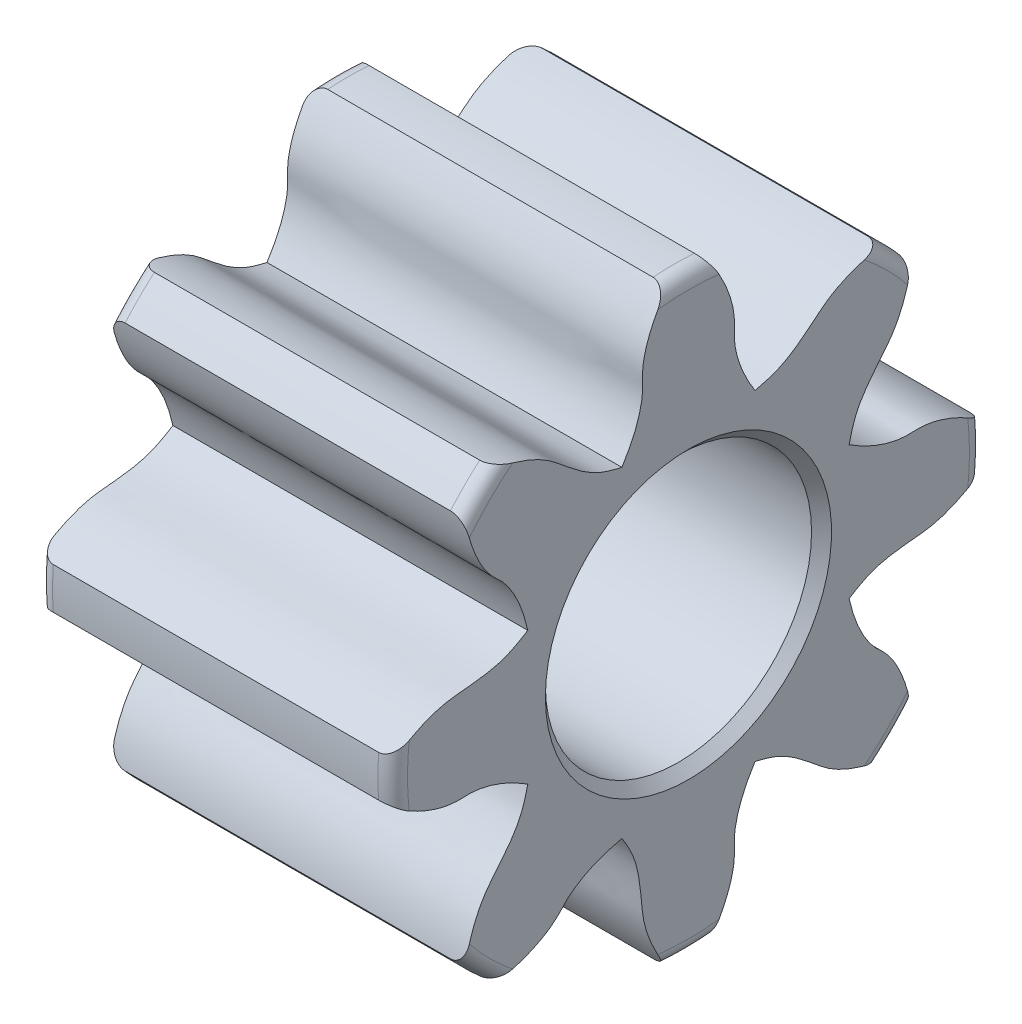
ISO-10303-21;
HEADER;
FILE_DESCRIPTION(('STEP AP214'),'2;1');
FILE_NAME('part.step','',(''),(''),'','','');
FILE_SCHEMA(('AUTOMOTIVE_DESIGN { 1 0 10303 214 1 1 1 1 }'));
ENDSEC;
DATA;
#1=APPLICATION_CONTEXT('core data for automotive mechanical design processes');
#2=APPLICATION_PROTOCOL_DEFINITION('international standard','automotive_design',2000,#1);
#3=PRODUCT_CONTEXT('',#1,'mechanical');
#4=PRODUCT('Part','Part','',(#3));
#5=PRODUCT_RELATED_PRODUCT_CATEGORY('part','',(#4));
#6=PRODUCT_DEFINITION_FORMATION('','',#4);
#7=PRODUCT_DEFINITION_CONTEXT('part definition',#1,'design');
#8=PRODUCT_DEFINITION('design','',#6,#7);
#9=PRODUCT_DEFINITION_SHAPE('','',#8);
#10=(LENGTH_UNIT() NAMED_UNIT(*) SI_UNIT(.MILLI.,.METRE.));
#11=(NAMED_UNIT(*) PLANE_ANGLE_UNIT() SI_UNIT($,.RADIAN.));
#12=(NAMED_UNIT(*) SI_UNIT($,.STERADIAN.) SOLID_ANGLE_UNIT());
#13=UNCERTAINTY_MEASURE_WITH_UNIT(LENGTH_MEASURE(1.E-05),#10,'distance_accuracy_value','');
#14=(GEOMETRIC_REPRESENTATION_CONTEXT(3) GLOBAL_UNCERTAINTY_ASSIGNED_CONTEXT((#13)) GLOBAL_UNIT_ASSIGNED_CONTEXT((#10,
#11,#12)) REPRESENTATION_CONTEXT('',''));
#15=CARTESIAN_POINT('',(0.,0.,0.));
#16=DIRECTION('',(0.,0.,1.));
#17=DIRECTION('',(1.,0.,0.));
#18=AXIS2_PLACEMENT_3D('',#15,#16,#17);
#19=CARTESIAN_POINT('',(1.5875,-5.66387214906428E-13,-1.42713531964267E-12));
#20=DIRECTION('',(-1.,0.,0.));
#21=DIRECTION('',(0.,0.,1.));
#22=AXIS2_PLACEMENT_3D('',#19,#20,#21);
#23=CYLINDRICAL_SURFACE('',#22,2.64583333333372);
#24=DIRECTION('',(1.,0.,0.));
#25=VECTOR('',#24,1.);
#26=CARTESIAN_POINT('',(-1.5875,2.63934736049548,0.185147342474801));
#27=LINE('',#26,#25);
#28=CARTESIAN_POINT('',(-1.45520833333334,2.63934736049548,0.185147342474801));
#29=VERTEX_POINT('',#28);
#30=CARTESIAN_POINT('',(1.45520833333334,2.63934736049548,0.185147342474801));
#31=VERTEX_POINT('',#30);
#32=EDGE_CURVE('E331',#29,#31,#27,.T.);
#33=ORIENTED_EDGE('',*,*,#32,.T.);
#34=CARTESIAN_POINT('',(1.45520833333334,-5.66387214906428E-13,-1.42713531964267E-12));
#35=DIRECTION('',(-1.,0.,0.));
#36=DIRECTION('',(0.,0.,1.));
#37=AXIS2_PLACEMENT_3D('',#34,#35,#36);
#38=CIRCLE('',#37,2.64583333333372);
#39=CARTESIAN_POINT('',(1.45520833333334,2.63934736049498,-0.18514734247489));
#40=VERTEX_POINT('',#39);
#41=EDGE_CURVE('E991',#31,#40,#38,.T.);
#42=ORIENTED_EDGE('',*,*,#41,.T.);
#43=DIRECTION('',(-1.,0.,0.));
#44=VECTOR('',#43,1.);
#45=CARTESIAN_POINT('',(1.5875,2.63934736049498,-0.18514734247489));
#46=LINE('',#45,#44);
#47=CARTESIAN_POINT('',(-1.45520833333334,2.63934736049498,-0.18514734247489));
#48=VERTEX_POINT('',#47);
#49=EDGE_CURVE('E766',#40,#48,#46,.T.);
#50=ORIENTED_EDGE('',*,*,#49,.T.);
#51=CARTESIAN_POINT('',(-1.45520833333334,-5.66387214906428E-13,-1.42713531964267E-12));
#52=DIRECTION('',(-1.,0.,0.));
#53=DIRECTION('',(0.,0.,1.));
#54=AXIS2_PLACEMENT_3D('',#51,#52,#53);
#55=CIRCLE('',#54,2.64583333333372);
#56=EDGE_CURVE('E447',#48,#29,#55,.F.);
#57=ORIENTED_EDGE('',*,*,#56,.T.);
#58=EDGE_LOOP('',(#33,#42,#50,#57));
#59=FACE_BOUND('',#58,.T.);
#60=ADVANCED_FACE('F31',(#59),#23,.T.);
#61=DIRECTION('',(1.,0.,0.));
#62=VECTOR('',#61,1.);
#63=CARTESIAN_POINT('',(-1.5875,1.99721935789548,1.73538147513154));
#64=LINE('',#63,#62);
#65=CARTESIAN_POINT('',(-1.45520833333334,1.99721935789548,1.73538147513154));
#66=VERTEX_POINT('',#65);
#67=CARTESIAN_POINT('',(1.45520833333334,1.99721935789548,1.73538147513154));
#68=VERTEX_POINT('',#67);
#69=EDGE_CURVE('E309',#66,#68,#64,.T.);
#70=ORIENTED_EDGE('',*,*,#69,.F.);
#71=CARTESIAN_POINT('',(-1.45520833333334,-5.66387214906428E-13,-1.42713531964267E-12));
#72=DIRECTION('',(-1.,0.,0.));
#73=DIRECTION('',(0.,0.,1.));
#74=AXIS2_PLACEMENT_3D('',#71,#72,#73);
#75=CIRCLE('',#74,2.64583333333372);
#76=CARTESIAN_POINT('',(-1.45520833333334,1.73538147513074,1.99721935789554));
#77=VERTEX_POINT('',#76);
#78=EDGE_CURVE('E380',#66,#77,#75,.F.);
#79=ORIENTED_EDGE('',*,*,#78,.T.);
#80=DIRECTION('',(1.,0.,0.));
#81=VECTOR('',#80,1.);
#82=CARTESIAN_POINT('',(-1.5875,1.73538147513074,1.99721935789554));
#83=LINE('',#82,#81);
#84=CARTESIAN_POINT('',(1.45520833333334,1.73538147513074,1.99721935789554));
#85=VERTEX_POINT('',#84);
#86=EDGE_CURVE('E513',#77,#85,#83,.T.);
#87=ORIENTED_EDGE('',*,*,#86,.T.);
#88=CARTESIAN_POINT('',(1.45520833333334,-5.66387214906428E-13,-1.42713531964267E-12));
#89=DIRECTION('',(-1.,0.,0.));
#90=DIRECTION('',(0.,0.,1.));
#91=AXIS2_PLACEMENT_3D('',#88,#89,#90);
#92=CIRCLE('',#91,2.64583333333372);
#93=EDGE_CURVE('E413',#85,#68,#92,.T.);
#94=ORIENTED_EDGE('',*,*,#93,.T.);
#95=EDGE_LOOP('',(#70,#79,#87,#94));
#96=FACE_BOUND('',#95,.T.);
#97=ADVANCED_FACE('F1090',(#96),#23,.T.);
#98=DIRECTION('',(1.,0.,0.));
#99=VECTOR('',#98,1.);
#100=CARTESIAN_POINT('',(-1.5875,-0.1851473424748,2.63934736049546));
#101=LINE('',#100,#99);
#102=CARTESIAN_POINT('',(-1.45520833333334,-0.1851473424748,2.63934736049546));
#103=VERTEX_POINT('',#102);
#104=CARTESIAN_POINT('',(1.45520833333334,-0.1851473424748,2.63934736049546));
#105=VERTEX_POINT('',#104);
#106=EDGE_CURVE('E522',#103,#105,#101,.T.);
#107=ORIENTED_EDGE('',*,*,#106,.T.);
#108=CARTESIAN_POINT('',(1.45520833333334,-5.66387214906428E-13,-1.42713531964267E-12));
#109=DIRECTION('',(-1.,0.,0.));
#110=DIRECTION('',(0.,0.,1.));
#111=AXIS2_PLACEMENT_3D('',#108,#109,#110);
#112=CIRCLE('',#111,2.64583333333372);
#113=CARTESIAN_POINT('',(1.45520833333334,0.185147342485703,2.63934736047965));
#114=VERTEX_POINT('',#113);
#115=EDGE_CURVE('E477',#105,#114,#112,.T.);
#116=ORIENTED_EDGE('',*,*,#115,.T.);
#117=DIRECTION('',(1.,0.,0.));
#118=VECTOR('',#117,1.);
#119=CARTESIAN_POINT('',(-1.5875,0.185147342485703,2.63934736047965));
#120=LINE('',#119,#118);
#121=CARTESIAN_POINT('',(-1.45520833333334,0.185147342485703,2.63934736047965));
#122=VERTEX_POINT('',#121);
#123=EDGE_CURVE('E1050',#122,#114,#120,.T.);
#124=ORIENTED_EDGE('',*,*,#123,.F.);
#125=CARTESIAN_POINT('',(-1.45520833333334,-5.66387214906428E-13,-1.42713531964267E-12));
#126=DIRECTION('',(-1.,0.,0.));
#127=DIRECTION('',(0.,0.,1.));
#128=AXIS2_PLACEMENT_3D('',#125,#126,#127);
#129=CIRCLE('',#128,2.64583333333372);
#130=EDGE_CURVE('E1073',#122,#103,#129,.F.);
#131=ORIENTED_EDGE('',*,*,#130,.T.);
#132=EDGE_LOOP('',(#107,#116,#124,#131));
#133=FACE_BOUND('',#132,.T.);
#134=ADVANCED_FACE('F1049',(#133),#23,.T.);
#135=DIRECTION('',(1.,0.,0.));
#136=VECTOR('',#135,1.);
#137=CARTESIAN_POINT('',(-1.5875,-1.99721935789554,1.73538147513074));
#138=LINE('',#137,#136);
#139=CARTESIAN_POINT('',(-1.45520833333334,-1.99721935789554,1.73538147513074));
#140=VERTEX_POINT('',#139);
#141=CARTESIAN_POINT('',(1.45520833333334,-1.99721935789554,1.73538147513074));
#142=VERTEX_POINT('',#141);
#143=EDGE_CURVE('E967',#140,#142,#138,.T.);
#144=ORIENTED_EDGE('',*,*,#143,.T.);
#145=CARTESIAN_POINT('',(1.45520833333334,-5.66387214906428E-13,-1.42713531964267E-12));
#146=DIRECTION('',(-1.,0.,0.));
#147=DIRECTION('',(0.,0.,1.));
#148=AXIS2_PLACEMENT_3D('',#145,#146,#147);
#149=CIRCLE('',#148,2.64583333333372);
#150=CARTESIAN_POINT('',(1.45520833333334,-1.73538147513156,1.9972193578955));
#151=VERTEX_POINT('',#150);
#152=EDGE_CURVE('E608',#142,#151,#149,.T.);
#153=ORIENTED_EDGE('',*,*,#152,.T.);
#154=DIRECTION('',(1.,0.,0.));
#155=VECTOR('',#154,1.);
#156=CARTESIAN_POINT('',(-1.5875,-1.73538147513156,1.9972193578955));
#157=LINE('',#156,#155);
#158=CARTESIAN_POINT('',(-1.45520833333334,-1.73538147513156,1.9972193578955));
#159=VERTEX_POINT('',#158);
#160=EDGE_CURVE('E545',#159,#151,#157,.T.);
#161=ORIENTED_EDGE('',*,*,#160,.F.);
#162=CARTESIAN_POINT('',(-1.45520833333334,-5.66387214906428E-13,-1.42713531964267E-12));
#163=DIRECTION('',(-1.,0.,0.));
#164=DIRECTION('',(0.,0.,1.));
#165=AXIS2_PLACEMENT_3D('',#162,#163,#164);
#166=CIRCLE('',#165,2.64583333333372);
#167=EDGE_CURVE('E614',#159,#140,#166,.F.);
#168=ORIENTED_EDGE('',*,*,#167,.T.);
#169=EDGE_LOOP('',(#144,#153,#161,#168));
#170=FACE_BOUND('',#169,.T.);
#171=ADVANCED_FACE('F1108',(#170),#23,.T.);
#172=DIRECTION('',(1.,0.,0.));
#173=VECTOR('',#172,1.);
#174=CARTESIAN_POINT('',(-1.5875,-2.63934736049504,-0.185147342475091));
#175=LINE('',#174,#173);
#176=CARTESIAN_POINT('',(-1.45520833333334,-2.63934736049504,-0.185147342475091));
#177=VERTEX_POINT('',#176);
#178=CARTESIAN_POINT('',(1.45520833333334,-2.63934736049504,-0.185147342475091));
#179=VERTEX_POINT('',#178);
#180=EDGE_CURVE('E662',#177,#179,#175,.T.);
#181=ORIENTED_EDGE('',*,*,#180,.T.);
#182=CARTESIAN_POINT('',(1.45520833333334,-5.66387214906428E-13,-1.42713531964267E-12));
#183=DIRECTION('',(-1.,0.,0.));
#184=DIRECTION('',(0.,0.,1.));
#185=AXIS2_PLACEMENT_3D('',#182,#183,#184);
#186=CIRCLE('',#185,2.64583333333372);
#187=CARTESIAN_POINT('',(1.45520833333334,-2.63934736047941,0.185147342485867));
#188=VERTEX_POINT('',#187);
#189=EDGE_CURVE('E492',#179,#188,#186,.T.);
#190=ORIENTED_EDGE('',*,*,#189,.T.);
#191=DIRECTION('',(1.,0.,0.));
#192=VECTOR('',#191,1.);
#193=CARTESIAN_POINT('',(-1.5875,-2.63934736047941,0.185147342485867));
#194=LINE('',#193,#192);
#195=CARTESIAN_POINT('',(-1.45520833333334,-2.63934736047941,0.185147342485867));
#196=VERTEX_POINT('',#195);
#197=EDGE_CURVE('E1011',#196,#188,#194,.T.);
#198=ORIENTED_EDGE('',*,*,#197,.F.);
#199=CARTESIAN_POINT('',(-1.45520833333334,-5.66387214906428E-13,-1.42713531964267E-12));
#200=DIRECTION('',(-1.,0.,0.));
#201=DIRECTION('',(0.,0.,1.));
#202=AXIS2_PLACEMENT_3D('',#199,#200,#201);
#203=CIRCLE('',#202,2.64583333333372);
#204=EDGE_CURVE('E1130',#196,#177,#203,.F.);
#205=ORIENTED_EDGE('',*,*,#204,.T.);
#206=EDGE_LOOP('',(#181,#190,#198,#205));
#207=FACE_BOUND('',#206,.T.);
#208=ADVANCED_FACE('F1010',(#207),#23,.T.);
#209=DIRECTION('',(1.,0.,0.));
#210=VECTOR('',#209,1.);
#211=CARTESIAN_POINT('',(-1.5875,-1.73538147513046,-1.99721935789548));
#212=LINE('',#211,#210);
#213=CARTESIAN_POINT('',(-1.45520833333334,-1.73538147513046,-1.99721935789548));
#214=VERTEX_POINT('',#213);
#215=CARTESIAN_POINT('',(1.45520833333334,-1.73538147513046,-1.99721935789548));
#216=VERTEX_POINT('',#215);
#217=EDGE_CURVE('E671',#214,#216,#212,.T.);
#218=ORIENTED_EDGE('',*,*,#217,.T.);
#219=CARTESIAN_POINT('',(1.45520833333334,-5.66387214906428E-13,-1.42713531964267E-12));
#220=DIRECTION('',(-1.,0.,0.));
#221=DIRECTION('',(0.,0.,1.));
#222=AXIS2_PLACEMENT_3D('',#219,#220,#221);
#223=CIRCLE('',#222,2.64583333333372);
#224=CARTESIAN_POINT('',(1.45520833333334,-1.9972193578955,-1.73538147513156));
#225=VERTEX_POINT('',#224);
#226=EDGE_CURVE('E934',#216,#225,#223,.T.);
#227=ORIENTED_EDGE('',*,*,#226,.T.);
#228=DIRECTION('',(1.,0.,0.));
#229=VECTOR('',#228,1.);
#230=CARTESIAN_POINT('',(-1.5875,-1.9972193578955,-1.73538147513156));
#231=LINE('',#230,#229);
#232=CARTESIAN_POINT('',(-1.45520833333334,-1.9972193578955,-1.73538147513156));
#233=VERTEX_POINT('',#232);
#234=EDGE_CURVE('E927',#233,#225,#231,.T.);
#235=ORIENTED_EDGE('',*,*,#234,.F.);
#236=CARTESIAN_POINT('',(-1.45520833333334,-5.66387214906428E-13,-1.42713531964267E-12));
#237=DIRECTION('',(-1.,0.,0.));
#238=DIRECTION('',(0.,0.,1.));
#239=AXIS2_PLACEMENT_3D('',#236,#237,#238);
#240=CIRCLE('',#239,2.64583333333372);
#241=EDGE_CURVE('E853',#233,#214,#240,.F.);
#242=ORIENTED_EDGE('',*,*,#241,.T.);
#243=EDGE_LOOP('',(#218,#227,#235,#242));
#244=FACE_BOUND('',#243,.T.);
#245=ADVANCED_FACE('F932',(#244),#23,.T.);
#246=DIRECTION('',(1.,0.,0.));
#247=VECTOR('',#246,1.);
#248=CARTESIAN_POINT('',(-1.5875,0.185147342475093,-2.63934736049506));
#249=LINE('',#248,#247);
#250=CARTESIAN_POINT('',(-1.45520833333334,0.185147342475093,-2.63934736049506));
#251=VERTEX_POINT('',#250);
#252=CARTESIAN_POINT('',(1.45520833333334,0.185147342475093,-2.63934736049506));
#253=VERTEX_POINT('',#252);
#254=EDGE_CURVE('E799',#251,#253,#249,.T.);
#255=ORIENTED_EDGE('',*,*,#254,.T.);
#256=CARTESIAN_POINT('',(1.45520833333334,-5.66387214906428E-13,-1.42713531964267E-12));
#257=DIRECTION('',(-1.,0.,0.));
#258=DIRECTION('',(0.,0.,1.));
#259=AXIS2_PLACEMENT_3D('',#256,#257,#258);
#260=CIRCLE('',#259,2.64583333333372);
#261=CARTESIAN_POINT('',(1.45520833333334,-0.185147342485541,-2.63934736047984));
#262=VERTEX_POINT('',#261);
#263=EDGE_CURVE('E379',#253,#262,#260,.T.);
#264=ORIENTED_EDGE('',*,*,#263,.T.);
#265=DIRECTION('',(1.,0.,0.));
#266=VECTOR('',#265,1.);
#267=CARTESIAN_POINT('',(-1.5875,-0.185147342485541,-2.63934736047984));
#268=LINE('',#267,#266);
#269=CARTESIAN_POINT('',(-1.45520833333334,-0.185147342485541,-2.63934736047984));
#270=VERTEX_POINT('',#269);
#271=EDGE_CURVE('E694',#270,#262,#268,.T.);
#272=ORIENTED_EDGE('',*,*,#271,.F.);
#273=CARTESIAN_POINT('',(-1.45520833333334,-5.66387214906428E-13,-1.42713531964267E-12));
#274=DIRECTION('',(-1.,0.,0.));
#275=DIRECTION('',(0.,0.,1.));
#276=AXIS2_PLACEMENT_3D('',#273,#274,#275);
#277=CIRCLE('',#276,2.64583333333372);
#278=EDGE_CURVE('E728',#270,#251,#277,.F.);
#279=ORIENTED_EDGE('',*,*,#278,.T.);
#280=EDGE_LOOP('',(#255,#264,#272,#279));
#281=FACE_BOUND('',#280,.T.);
#282=ADVANCED_FACE('F808',(#281),#23,.T.);
#283=CARTESIAN_POINT('',(1.5875,1.43734546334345,-0.595367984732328));
#284=CARTESIAN_POINT('',(1.5875,1.44907696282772,-0.648773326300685));
#285=CARTESIAN_POINT('',(1.5875,1.46362237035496,-0.701660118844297));
#286=CARTESIAN_POINT('',(1.5875,1.48125187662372,-0.753418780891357));
#287=CARTESIAN_POINT('',(1.5875,1.53879110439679,-0.922348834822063));
#288=CARTESIAN_POINT('',(1.5875,1.66798890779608,-1.05866021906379));
#289=CARTESIAN_POINT('',(1.5875,1.77918715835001,-1.19824200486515));
#290=CARTESIAN_POINT('',(1.5875,1.86566198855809,-1.30678967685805));
#291=CARTESIAN_POINT('',(1.5875,1.92245233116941,-1.43957957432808));
#292=CARTESIAN_POINT('',(1.5875,1.96045459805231,-1.57305736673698));
#293=CARTESIAN_POINT('',(1.5875,1.97564608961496,-1.62641541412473));
#294=CARTESIAN_POINT('',(1.5875,1.98779577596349,-1.68070919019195));
#295=CARTESIAN_POINT('',(1.5875,1.9972193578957,-1.73538147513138));
#296=B_SPLINE_CURVE_WITH_KNOTS('',3,(#283,#284,#285,#286,#287,#288,#289,#290,#291,#292,#293,
#294,#295),.UNSPECIFIED.,.F.,.F.,(4,3,3,3,4),(-0.000164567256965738,-9.23741328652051E-06,
0.000514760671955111,0.000931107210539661,0.0010956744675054),.UNSPECIFIED.);
#297=DIRECTION('',(-1.,0.,0.));
#298=VECTOR('',#297,1.);
#299=SURFACE_OF_LINEAR_EXTRUSION('',#296,#298);
#300=CARTESIAN_POINT('',(1.5875,1.43734546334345,-0.595367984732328));
#301=VERTEX_POINT('',#300);
#302=CARTESIAN_POINT('',(1.5875,1.96045459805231,-1.57305736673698));
#303=VERTEX_POINT('',#302);
#304=EDGE_CURVE('E775',#301,#303,#296,.T.);
#305=ORIENTED_EDGE('',*,*,#304,.T.);
#306=CARTESIAN_POINT('',(1.5875,1.96045459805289,-1.57305736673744));
#307=CARTESIAN_POINT('',(1.58749133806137,1.96352239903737,-1.58381553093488));
#308=CARTESIAN_POINT('',(1.58655473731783,1.96645770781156,-1.59461481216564));
#309=CARTESIAN_POINT('',(1.58281780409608,1.97204009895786,-1.61606714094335));
#310=CARTESIAN_POINT('',(1.58000095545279,1.97468438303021,-1.62671803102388));
#311=CARTESIAN_POINT('',(1.57253279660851,1.97958098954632,-1.64734033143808));
#312=CARTESIAN_POINT('',(1.56789974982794,1.98183690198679,-1.65731738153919));
#313=CARTESIAN_POINT('',(1.55681491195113,1.98594041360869,-1.67623810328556));
#314=CARTESIAN_POINT('',(1.55037063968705,1.98778964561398,-1.68518583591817));
#315=CARTESIAN_POINT('',(1.53327502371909,1.99155775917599,-1.70410727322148));
#316=CARTESIAN_POINT('',(1.52193897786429,1.99332148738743,-1.71354320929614));
#317=CARTESIAN_POINT('',(1.503921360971,1.99517771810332,-1.72376358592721));
#318=CARTESIAN_POINT('',(1.49830103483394,1.99564848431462,-1.72640560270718));
#319=CARTESIAN_POINT('',(1.48669312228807,1.996411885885,-1.73072722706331));
#320=CARTESIAN_POINT('',(1.48070622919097,1.99670484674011,-1.73240859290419));
#321=CARTESIAN_POINT('',(1.46822711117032,1.99711406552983,-1.73477015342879));
#322=CARTESIAN_POINT('',(1.46172452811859,1.99722089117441,-1.73539685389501));
#323=CARTESIAN_POINT('',(1.45520833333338,1.9972193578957,-1.73538147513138));
#324=B_SPLINE_CURVE_WITH_KNOTS('',3,(#306,#307,#308,#309,#310,#311,#312,#313,#314,#315,#316,
#317,#318,#319,#320,#321,#322,#323),.UNSPECIFIED.,.F.,.F.,(4,2,2,2,2,2,2,2,4),(0.,
0.0335284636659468,0.0673553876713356,0.100850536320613,0.134208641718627,0.177877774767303,
0.196491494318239,0.215071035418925,0.234567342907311),.UNSPECIFIED.);
#325=CARTESIAN_POINT('',(1.45520833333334,1.9972193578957,-1.73538147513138));
#326=VERTEX_POINT('',#325);
#327=EDGE_CURVE('E821',#303,#326,#324,.T.);
#328=ORIENTED_EDGE('',*,*,#327,.T.);
#329=DIRECTION('',(-1.,0.,0.));
#330=VECTOR('',#329,1.);
#331=CARTESIAN_POINT('',(1.5875,1.9972193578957,-1.73538147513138));
#332=LINE('',#331,#330);
#333=CARTESIAN_POINT('',(-1.45520833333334,1.9972193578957,-1.73538147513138));
#334=VERTEX_POINT('',#333);
#335=EDGE_CURVE('E764',#326,#334,#332,.T.);
#336=ORIENTED_EDGE('',*,*,#335,.T.);
#337=CARTESIAN_POINT('',(-1.45520833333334,1.9972193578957,-1.73538147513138));
#338=CARTESIAN_POINT('',(-1.4615059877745,1.99722047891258,-1.73539431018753));
#339=CARTESIAN_POINT('',(-1.46779092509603,1.99712090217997,-1.73481018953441));
#340=CARTESIAN_POINT('',(-1.48011293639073,1.99673090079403,-1.73255811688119));
#341=CARTESIAN_POINT('',(-1.48615146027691,1.99644184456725,-1.73089793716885));
#342=CARTESIAN_POINT('',(-1.49784122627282,1.99568395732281,-1.72660546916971));
#343=CARTESIAN_POINT('',(-1.50349323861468,1.99521549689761,-1.72397518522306));
#344=CARTESIAN_POINT('',(-1.51432330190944,1.99411192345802,-1.71789202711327));
#345=CARTESIAN_POINT('',(-1.51950045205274,1.99347650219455,-1.71443763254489));
#346=CARTESIAN_POINT('',(-1.53738275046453,1.99087690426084,-1.70061284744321));
#347=CARTESIAN_POINT('',(-1.54847046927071,1.9884457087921,-1.6882093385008));
#348=CARTESIAN_POINT('',(-1.56868207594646,1.98198514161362,-1.6576920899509));
#349=CARTESIAN_POINT('',(-1.57669365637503,1.97771210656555,-1.6389224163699));
#350=CARTESIAN_POINT('',(-1.58357650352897,1.970977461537,-1.61195803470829));
#351=CARTESIAN_POINT('',(-1.58504640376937,1.9689765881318,-1.60420896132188));
#352=CARTESIAN_POINT('',(-1.58700440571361,1.96482513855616,-1.5886581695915));
#353=CARTESIAN_POINT('',(-1.58749609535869,1.96267513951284,-1.58085674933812));
#354=CARTESIAN_POINT('',(-1.58750000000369,1.96045459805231,-1.57305736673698));
#355=B_SPLINE_CURVE_WITH_KNOTS('',3,(#337,#338,#339,#340,#341,#342,#343,#344,#345,#346,#347,
#348,#349,#350,#351,#352,#353,#354),.UNSPECIFIED.,.F.,.F.,(4,2,2,2,2,2,2,2,4),(0.,
0.0188449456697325,0.0375552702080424,0.0562271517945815,0.074933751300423,0.124395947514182,
0.185744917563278,0.210113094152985,0.23439172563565),.UNSPECIFIED.);
#356=CARTESIAN_POINT('',(-1.5875,1.96045459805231,-1.57305736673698));
#357=VERTEX_POINT('',#356);
#358=EDGE_CURVE('E814',#334,#357,#355,.T.);
#359=ORIENTED_EDGE('',*,*,#358,.T.);
#360=CARTESIAN_POINT('',(-1.5875,1.43734546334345,-0.595367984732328));
#361=CARTESIAN_POINT('',(-1.5875,1.44907696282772,-0.648773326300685));
#362=CARTESIAN_POINT('',(-1.5875,1.46362237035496,-0.701660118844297));
#363=CARTESIAN_POINT('',(-1.5875,1.48125187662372,-0.753418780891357));
#364=CARTESIAN_POINT('',(-1.5875,1.53879110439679,-0.922348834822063));
#365=CARTESIAN_POINT('',(-1.5875,1.66798890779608,-1.05866021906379));
#366=CARTESIAN_POINT('',(-1.5875,1.77918715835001,-1.19824200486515));
#367=CARTESIAN_POINT('',(-1.5875,1.86566198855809,-1.30678967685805));
#368=CARTESIAN_POINT('',(-1.5875,1.92245233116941,-1.43957957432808));
#369=CARTESIAN_POINT('',(-1.5875,1.96045459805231,-1.57305736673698));
#370=CARTESIAN_POINT('',(-1.5875,1.97564608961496,-1.62641541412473));
#371=CARTESIAN_POINT('',(-1.5875,1.98779577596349,-1.68070919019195));
#372=CARTESIAN_POINT('',(-1.5875,1.9972193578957,-1.73538147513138));
#373=B_SPLINE_CURVE_WITH_KNOTS('',3,(#360,#361,#362,#363,#364,#365,#366,#367,#368,#369,#370,
#371,#372),.UNSPECIFIED.,.F.,.F.,(4,3,3,3,4),(-0.000164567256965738,-9.23741328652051E-06,
0.000514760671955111,0.000931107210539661,0.0010956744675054),.UNSPECIFIED.);
#374=CARTESIAN_POINT('',(-1.5875,1.43734546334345,-0.595367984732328));
#375=VERTEX_POINT('',#374);
#376=EDGE_CURVE('E776',#375,#357,#373,.T.);
#377=ORIENTED_EDGE('',*,*,#376,.F.);
#378=DIRECTION('',(-1.,0.,0.));
#379=VECTOR('',#378,1.);
#380=CARTESIAN_POINT('',(1.5875,1.43734546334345,-0.595367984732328));
#381=LINE('',#380,#379);
#382=EDGE_CURVE('E763',#301,#375,#381,.T.);
#383=ORIENTED_EDGE('',*,*,#382,.F.);
#384=EDGE_LOOP('',(#305,#328,#336,#359,#377,#383));
#385=FACE_BOUND('',#384,.T.);
#386=ADVANCED_FACE('F805',(#385),#299,.T.);
#387=CARTESIAN_POINT('',(1.5875,2.63934736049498,-0.185147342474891));
#388=CARTESIAN_POINT('',(1.5875,2.5940247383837,-0.217143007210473));
#389=CARTESIAN_POINT('',(1.5875,2.54704211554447,-0.246943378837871));
#390=CARTESIAN_POINT('',(1.5875,2.49857027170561,-0.27393120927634));
#391=CARTESIAN_POINT('',(1.5875,2.40283498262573,-0.327234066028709));
#392=CARTESIAN_POINT('',(1.5875,2.30009519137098,-0.371629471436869));
#393=CARTESIAN_POINT('',(1.5875,2.1931514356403,-0.395493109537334));
#394=CARTESIAN_POINT('',(1.5875,2.12870796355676,-0.409873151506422));
#395=CARTESIAN_POINT('',(1.5875,2.06150861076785,-0.414273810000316));
#396=CARTESIAN_POINT('',(1.5875,1.99560920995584,-0.410148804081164));
#397=CARTESIAN_POINT('',(1.5875,1.92970396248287,-0.406023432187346));
#398=CARTESIAN_POINT('',(1.5875,1.86273106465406,-0.415750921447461));
#399=CARTESIAN_POINT('',(1.5875,1.79870601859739,-0.431916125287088));
#400=CARTESIAN_POINT('',(1.5875,1.67052579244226,-0.464279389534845));
#401=CARTESIAN_POINT('',(1.5875,1.54870666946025,-0.524120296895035));
#402=CARTESIAN_POINT('',(1.5875,1.43734546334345,-0.595367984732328));
#403=B_SPLINE_CURVE_WITH_KNOTS('',3,(#387,#388,#389,#390,#391,#392,#393,#394,#395,#396,#397,
#398,#399,#400,#401,#402),.UNSPECIFIED.,.F.,.F.,(4,3,3,3,3,4),(0.,0.000164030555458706,
0.00048951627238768,0.000685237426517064,0.00088207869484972,0.00127868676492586),.UNSPECIFIED.);
#404=DIRECTION('',(-1.,0.,0.));
#405=VECTOR('',#404,1.);
#406=SURFACE_OF_LINEAR_EXTRUSION('',#403,#405);
#407=ORIENTED_EDGE('',*,*,#49,.F.);
#408=CARTESIAN_POINT('',(1.45520833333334,2.63934736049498,-0.18514734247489));
#409=CARTESIAN_POINT('',(1.46150598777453,2.63935722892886,-0.185139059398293));
#410=CARTESIAN_POINT('',(1.46779092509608,2.63887378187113,-0.185481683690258));
#411=CARTESIAN_POINT('',(1.48011293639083,2.63700555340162,-0.186798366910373));
#412=CARTESIAN_POINT('',(1.48615146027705,2.63562723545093,-0.18776789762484));
#413=CARTESIAN_POINT('',(1.49784122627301,2.63205609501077,-0.190267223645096));
#414=CARTESIAN_POINT('',(1.50349323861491,2.62986495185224,-0.191795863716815));
#415=CARTESIAN_POINT('',(1.51432330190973,2.62478316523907,-0.195316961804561));
#416=CARTESIAN_POINT('',(1.51950045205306,2.62189122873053,-0.197310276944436));
#417=CARTESIAN_POINT('',(1.53738275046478,2.61027743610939,-0.205247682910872));
#418=CARTESIAN_POINT('',(1.54847046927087,2.59978771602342,-0.212299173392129));
#419=CARTESIAN_POINT('',(1.56868207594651,2.57364045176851,-0.229309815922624));
#420=CARTESIAN_POINT('',(1.57669365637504,2.55734679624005,-0.239560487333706));
#421=CARTESIAN_POINT('',(1.58357650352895,2.53351798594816,-0.253865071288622));
#422=CARTESIAN_POINT('',(1.58504640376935,2.52662373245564,-0.257929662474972));
#423=CARTESIAN_POINT('',(1.58700440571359,2.51269214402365,-0.26599021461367));
#424=CARTESIAN_POINT('',(1.58749609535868,2.50565542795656,-0.269986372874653));
#425=CARTESIAN_POINT('',(1.58750000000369,2.49857027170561,-0.27393120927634));
#426=B_SPLINE_CURVE_WITH_KNOTS('',3,(#408,#409,#410,#411,#412,#413,#414,#415,#416,#417,#418,
#419,#420,#421,#422,#423,#424,#425),.UNSPECIFIED.,.F.,.F.,(4,2,2,2,2,2,2,2,4),(0.,
0.0188449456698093,0.0375552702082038,0.0562271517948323,0.0749337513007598,0.124395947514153,
0.185744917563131,0.210113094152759,0.234391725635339),.UNSPECIFIED.);
#427=CARTESIAN_POINT('',(1.5875,2.49857027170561,-0.27393120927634));
#428=VERTEX_POINT('',#427);
#429=EDGE_CURVE('E58',#40,#428,#426,.T.);
#430=ORIENTED_EDGE('',*,*,#429,.T.);
#431=EDGE_CURVE('E767',#428,#301,#403,.T.);
#432=ORIENTED_EDGE('',*,*,#431,.T.);
#433=ORIENTED_EDGE('',*,*,#382,.T.);
#434=CARTESIAN_POINT('',(-1.5875,2.63934736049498,-0.185147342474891));
#435=CARTESIAN_POINT('',(-1.5875,2.5940247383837,-0.217143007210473));
#436=CARTESIAN_POINT('',(-1.5875,2.54704211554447,-0.246943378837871));
#437=CARTESIAN_POINT('',(-1.5875,2.49857027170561,-0.27393120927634));
#438=CARTESIAN_POINT('',(-1.5875,2.40283498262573,-0.327234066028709));
#439=CARTESIAN_POINT('',(-1.5875,2.30009519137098,-0.371629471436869));
#440=CARTESIAN_POINT('',(-1.5875,2.1931514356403,-0.395493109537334));
#441=CARTESIAN_POINT('',(-1.5875,2.12870796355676,-0.409873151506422));
#442=CARTESIAN_POINT('',(-1.5875,2.06150861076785,-0.414273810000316));
#443=CARTESIAN_POINT('',(-1.5875,1.99560920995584,-0.410148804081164));
#444=CARTESIAN_POINT('',(-1.5875,1.92970396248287,-0.406023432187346));
#445=CARTESIAN_POINT('',(-1.5875,1.86273106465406,-0.415750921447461));
#446=CARTESIAN_POINT('',(-1.5875,1.79870601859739,-0.431916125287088));
#447=CARTESIAN_POINT('',(-1.5875,1.67052579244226,-0.464279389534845));
#448=CARTESIAN_POINT('',(-1.5875,1.54870666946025,-0.524120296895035));
#449=CARTESIAN_POINT('',(-1.5875,1.43734546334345,-0.595367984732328));
#450=B_SPLINE_CURVE_WITH_KNOTS('',3,(#434,#435,#436,#437,#438,#439,#440,#441,#442,#443,#444,
#445,#446,#447,#448,#449),.UNSPECIFIED.,.F.,.F.,(4,3,3,3,3,4),(0.,0.000164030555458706,
0.00048951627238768,0.000685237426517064,0.00088207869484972,0.00127868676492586),.UNSPECIFIED.);
#451=CARTESIAN_POINT('',(-1.5875,2.49857027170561,-0.27393120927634));
#452=VERTEX_POINT('',#451);
#453=EDGE_CURVE('E771',#452,#375,#450,.T.);
#454=ORIENTED_EDGE('',*,*,#453,.F.);
#455=CARTESIAN_POINT('',(-1.5875,2.49857027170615,-0.273931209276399));
#456=CARTESIAN_POINT('',(-1.58749133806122,2.50834670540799,-0.268493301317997));
#457=CARTESIAN_POINT('',(-1.58655473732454,2.51805852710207,-0.262932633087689));
#458=CARTESIAN_POINT('',(-1.58281780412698,2.53717496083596,-0.251710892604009));
#459=CARTESIAN_POINT('',(-1.58000095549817,2.54657606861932,-0.246049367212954));
#460=CARTESIAN_POINT('',(-1.57253279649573,2.56462066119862,-0.234929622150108));
#461=CARTESIAN_POINT('',(-1.56789974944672,2.57327067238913,-0.229469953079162));
#462=CARTESIAN_POINT('',(-1.55681491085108,2.58955126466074,-0.218992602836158));
#463=CARTESIAN_POINT('',(-1.55037063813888,2.59718587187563,-0.213973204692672));
#464=CARTESIAN_POINT('',(-1.53327502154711,2.61322980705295,-0.203258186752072));
#465=CARTESIAN_POINT('',(-1.52193897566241,2.62114916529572,-0.197833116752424));
#466=CARTESIAN_POINT('',(-1.5039213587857,2.62968861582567,-0.191918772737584));
#467=CARTESIAN_POINT('',(-1.49830103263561,2.63188968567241,-0.190383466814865));
#468=CARTESIAN_POINT('',(-1.48669312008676,2.63548534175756,-0.187867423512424));
#469=CARTESIAN_POINT('',(-1.48070622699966,2.63688140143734,-0.18688567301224));
#470=CARTESIAN_POINT('',(-1.46822710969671,2.63884063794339,-0.185505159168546));
#471=CARTESIAN_POINT('',(-1.46172452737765,2.63935931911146,-0.185137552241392));
#472=CARTESIAN_POINT('',(-1.45520833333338,2.63934736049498,-0.185147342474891));
#473=B_SPLINE_CURVE_WITH_KNOTS('',3,(#455,#456,#457,#458,#459,#460,#461,#462,#463,#464,#465,
#466,#467,#468,#469,#470,#471,#472),.UNSPECIFIED.,.F.,.F.,(4,2,2,2,2,2,2,2,4),(0.,
0.0335284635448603,0.0673553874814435,0.100850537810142,0.134208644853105,0.177877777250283,
0.196491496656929,0.215071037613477,0.234567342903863),.UNSPECIFIED.);
#474=EDGE_CURVE('E444',#452,#48,#473,.T.);
#475=ORIENTED_EDGE('',*,*,#474,.T.);
#476=EDGE_LOOP('',(#407,#430,#432,#433,#454,#475));
#477=FACE_BOUND('',#476,.T.);
#478=ADVANCED_FACE('F462',(#477),#406,.T.);
#479=ORIENTED_EDGE('',*,*,#335,.F.);
#480=CARTESIAN_POINT('',(1.45520833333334,-5.66387214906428E-13,-1.42713531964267E-12));
#481=DIRECTION('',(-1.,0.,0.));
#482=DIRECTION('',(0.,0.,1.));
#483=AXIS2_PLACEMENT_3D('',#480,#481,#482);
#484=CIRCLE('',#483,2.64583333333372);
#485=CARTESIAN_POINT('',(1.45520833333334,1.73538147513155,-1.99721935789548));
#486=VERTEX_POINT('',#485);
#487=EDGE_CURVE('E846',#326,#486,#484,.T.);
#488=ORIENTED_EDGE('',*,*,#487,.T.);
#489=DIRECTION('',(1.,0.,0.));
#490=VECTOR('',#489,1.);
#491=CARTESIAN_POINT('',(-1.5875,1.73538147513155,-1.99721935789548));
#492=LINE('',#491,#490);
#493=CARTESIAN_POINT('',(-1.45520833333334,1.73538147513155,-1.99721935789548));
#494=VERTEX_POINT('',#493);
#495=EDGE_CURVE('E885',#494,#486,#492,.T.);
#496=ORIENTED_EDGE('',*,*,#495,.F.);
#497=CARTESIAN_POINT('',(-1.45520833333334,-5.66387214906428E-13,-1.42713531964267E-12));
#498=DIRECTION('',(-1.,0.,0.));
#499=DIRECTION('',(0.,0.,1.));
#500=AXIS2_PLACEMENT_3D('',#497,#498,#499);
#501=CIRCLE('',#500,2.64583333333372);
#502=EDGE_CURVE('E863',#494,#334,#501,.F.);
#503=ORIENTED_EDGE('',*,*,#502,.T.);
#504=EDGE_LOOP('',(#479,#488,#496,#503));
#505=FACE_BOUND('',#504,.T.);
#506=ADVANCED_FACE('F810',(#505),#23,.T.);
#507=CARTESIAN_POINT('',(1.5875,1.74745834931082,-1.15897570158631));
#508=DIRECTION('',(-1.,0.,0.));
#509=DIRECTION('',(0.,0.,1.));
#510=AXIS2_PLACEMENT_3D('',#507,#508,#509);
#511=PLANE('',#510);
#512=CARTESIAN_POINT('',(1.5875,0.,0.));
#513=DIRECTION('',(-1.,0.,0.));
#514=DIRECTION('',(0.,0.,1.));
#515=AXIS2_PLACEMENT_3D('',#512,#513,#514);
#516=CIRCLE('',#515,1.27992187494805);
#517=CARTESIAN_POINT('',(1.5875,0.,1.27992187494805));
#518=VERTEX_POINT('',#517);
#519=EDGE_CURVE('E754',#518,#518,#516,.T.);
#520=ORIENTED_EDGE('',*,*,#519,.T.);
#521=EDGE_LOOP('',(#520));
#522=FACE_BOUND('',#521,.T.);
#523=ORIENTED_EDGE('',*,*,#431,.F.);
#524=CARTESIAN_POINT('',(1.5875,-5.66387214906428E-13,-1.42713531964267E-12));
#525=DIRECTION('',(-1.,0.,0.));
#526=DIRECTION('',(0.,0.,1.));
#527=AXIS2_PLACEMENT_3D('',#524,#525,#526);
#528=CIRCLE('',#527,2.51354166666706);
#529=CARTESIAN_POINT('',(1.5875,2.49857027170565,0.273931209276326));
#530=VERTEX_POINT('',#529);
#531=EDGE_CURVE('E44',#428,#530,#528,.F.);
#532=ORIENTED_EDGE('',*,*,#531,.T.);
#533=CARTESIAN_POINT('',(1.5875,1.43734546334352,0.595367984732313));
#534=CARTESIAN_POINT('',(1.5875,1.54870666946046,0.524120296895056));
#535=CARTESIAN_POINT('',(1.5875,1.67052579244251,0.464279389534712));
#536=CARTESIAN_POINT('',(1.5875,1.79870601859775,0.431916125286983));
#537=CARTESIAN_POINT('',(1.5875,1.86273106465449,0.415750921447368));
#538=CARTESIAN_POINT('',(1.5875,1.92970396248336,0.406023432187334));
#539=CARTESIAN_POINT('',(1.5875,1.9956092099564,0.410148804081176));
#540=CARTESIAN_POINT('',(1.5875,2.06150861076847,0.414273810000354));
#541=CARTESIAN_POINT('',(1.5875,2.12870796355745,0.409873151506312));
#542=CARTESIAN_POINT('',(1.5875,2.19315143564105,0.395493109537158));
#543=CARTESIAN_POINT('',(1.5875,2.30009519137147,0.371629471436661));
#544=CARTESIAN_POINT('',(1.5875,2.40283498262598,0.32723406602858));
#545=CARTESIAN_POINT('',(1.5875,2.49857027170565,0.273931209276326));
#546=CARTESIAN_POINT('',(1.5875,2.54704211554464,0.246943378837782));
#547=CARTESIAN_POINT('',(1.5875,2.59402473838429,0.217143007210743));
#548=CARTESIAN_POINT('',(1.5875,2.6393473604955,0.185147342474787));
#549=B_SPLINE_CURVE_WITH_KNOTS('',3,(#533,#534,#535,#536,#537,#538,#539,#540,#541,#542,#543,
#544,#545,#546,#547,#548),.UNSPECIFIED.,.F.,.F.,(4,3,3,3,3,4),(0.,0.000396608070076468,
0.0005934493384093,0.000789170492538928,0.00111465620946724,0.00127868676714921),.UNSPECIFIED.);
#550=CARTESIAN_POINT('',(1.5875,1.43734546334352,0.595367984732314));
#551=VERTEX_POINT('',#550);
#552=EDGE_CURVE('E301',#551,#530,#549,.T.);
#553=ORIENTED_EDGE('',*,*,#552,.F.);
#554=CARTESIAN_POINT('',(1.5875,1.99721935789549,1.73538147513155));
#555=CARTESIAN_POINT('',(1.5875,1.98779577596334,1.68070919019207));
#556=CARTESIAN_POINT('',(1.5875,1.97564608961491,1.62641541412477));
#557=CARTESIAN_POINT('',(1.5875,1.96045459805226,1.57305736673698));
#558=CARTESIAN_POINT('',(1.5875,1.92245233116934,1.43957957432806));
#559=CARTESIAN_POINT('',(1.5875,1.86566198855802,1.30678967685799));
#560=CARTESIAN_POINT('',(1.5875,1.77918715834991,1.19824200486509));
#561=CARTESIAN_POINT('',(1.5875,1.66798890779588,1.05866021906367));
#562=CARTESIAN_POINT('',(1.5875,1.53879110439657,0.922348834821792));
#563=CARTESIAN_POINT('',(1.5875,1.48125187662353,0.753418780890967));
#564=CARTESIAN_POINT('',(1.5875,1.46362237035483,0.701660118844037));
#565=CARTESIAN_POINT('',(1.5875,1.44907696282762,0.648773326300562));
#566=CARTESIAN_POINT('',(1.5875,1.43734546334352,0.595367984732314));
#567=B_SPLINE_CURVE_WITH_KNOTS('',3,(#554,#555,#556,#557,#558,#559,#560,#561,#562,#563,#564,
#565,#566),.UNSPECIFIED.,.F.,.F.,(4,3,3,3,4),(-0.000164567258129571,0.,0.000416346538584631,
0.000940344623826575,0.00109567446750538),.UNSPECIFIED.);
#568=CARTESIAN_POINT('',(1.5875,1.96045459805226,1.57305736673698));
#569=VERTEX_POINT('',#568);
#570=EDGE_CURVE('E292',#569,#551,#567,.T.);
#571=ORIENTED_EDGE('',*,*,#570,.F.);
#572=CARTESIAN_POINT('',(1.5875,-5.66387214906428E-13,-1.42713531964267E-12));
#573=DIRECTION('',(-1.,0.,0.));
#574=DIRECTION('',(0.,0.,1.));
#575=AXIS2_PLACEMENT_3D('',#572,#573,#574);
#576=CIRCLE('',#575,2.51354166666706);
#577=CARTESIAN_POINT('',(1.5875,1.57305736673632,1.96045459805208));
#578=VERTEX_POINT('',#577);
#579=EDGE_CURVE('E412',#569,#578,#576,.F.);
#580=ORIENTED_EDGE('',*,*,#579,.T.);
#581=CARTESIAN_POINT('',(1.5875,0.595367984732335,1.43734546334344));
#582=CARTESIAN_POINT('',(1.5875,0.72449197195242,1.46571000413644));
#583=CARTESIAN_POINT('',(1.5875,0.852945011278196,1.50953522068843));
#584=CARTESIAN_POINT('',(1.5875,0.966466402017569,1.57728804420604));
#585=CARTESIAN_POINT('',(1.5875,1.02316947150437,1.61113006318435));
#586=CARTESIAN_POINT('',(1.5875,1.07740483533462,1.65160867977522));
#587=CARTESIAN_POINT('',(1.5875,1.12108980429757,1.70112780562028));
#588=CARTESIAN_POINT('',(1.5875,1.16477089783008,1.75064253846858));
#589=CARTESIAN_POINT('',(1.5875,1.21539975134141,1.7950479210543));
#590=CARTESIAN_POINT('',(1.5875,1.27113639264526,1.83044811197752));
#591=CARTESIAN_POINT('',(1.5875,1.36363118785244,1.88919462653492));
#592=CARTESIAN_POINT('',(1.5875,1.46767148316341,1.93045033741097));
#593=CARTESIAN_POINT('',(1.5875,1.57305736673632,1.96045459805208));
#594=CARTESIAN_POINT('',(1.5875,1.62641541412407,1.97564608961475));
#595=CARTESIAN_POINT('',(1.5875,1.68070919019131,1.98779577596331));
#596=CARTESIAN_POINT('',(1.5875,1.73538147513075,1.99721935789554));
#597=B_SPLINE_CURVE_WITH_KNOTS('',3,(#581,#582,#583,#584,#585,#586,#587,#588,#589,#590,#591,
#592,#593,#594,#595,#596),.UNSPECIFIED.,.F.,.F.,(4,3,3,3,3,4),(0.,0.00039660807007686,
0.00059344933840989,0.000789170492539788,0.00111465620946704,0.00127869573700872),.UNSPECIFIED.);
#598=CARTESIAN_POINT('',(1.5875,0.595367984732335,1.43734546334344));
#599=VERTEX_POINT('',#598);
#600=EDGE_CURVE('E308',#599,#578,#597,.T.);
#601=ORIENTED_EDGE('',*,*,#600,.F.);
#602=CARTESIAN_POINT('',(1.5875,0.185147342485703,2.63934736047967));
#603=CARTESIAN_POINT('',(1.5875,0.217143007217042,2.59402473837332));
#604=CARTESIAN_POINT('',(1.5875,0.246943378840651,2.54704211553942));
#605=CARTESIAN_POINT('',(1.5875,0.273931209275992,2.49857027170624));
#606=CARTESIAN_POINT('',(1.5875,0.341442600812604,2.37731555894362));
#607=CARTESIAN_POINT('',(1.5875,0.39518240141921,2.24326208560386));
#608=CARTESIAN_POINT('',(1.5875,0.410790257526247,2.10536035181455));
#609=CARTESIAN_POINT('',(1.5875,0.430860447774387,1.9280320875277));
#610=CARTESIAN_POINT('',(1.5875,0.435890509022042,1.74028874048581));
#611=CARTESIAN_POINT('',(1.5875,0.514655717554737,1.58015077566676));
#612=CARTESIAN_POINT('',(1.5875,0.538788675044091,1.53108593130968));
#613=CARTESIAN_POINT('',(1.5875,0.56590012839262,1.48340416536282));
#614=CARTESIAN_POINT('',(1.5875,0.595367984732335,1.43734546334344));
#615=B_SPLINE_CURVE_WITH_KNOTS('',3,(#602,#603,#604,#605,#606,#607,#608,#609,#610,#611,#612,
#613,#614),.UNSPECIFIED.,.F.,.F.,(4,3,3,3,4),(-0.000164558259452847,0.,0.000416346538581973,
0.00094034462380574,0.00109567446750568),.UNSPECIFIED.);
#616=CARTESIAN_POINT('',(1.5875,0.273931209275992,2.49857027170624));
#617=VERTEX_POINT('',#616);
#618=EDGE_CURVE('E341',#617,#599,#615,.T.);
#619=ORIENTED_EDGE('',*,*,#618,.F.);
#620=CARTESIAN_POINT('',(1.5875,-5.66387214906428E-13,-1.42713531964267E-12));
#621=DIRECTION('',(-1.,0.,0.));
#622=DIRECTION('',(0.,0.,1.));
#623=AXIS2_PLACEMENT_3D('',#620,#621,#622);
#624=CIRCLE('',#623,2.51354166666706);
#625=CARTESIAN_POINT('',(1.5875,-0.27393120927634,2.49857027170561));
#626=VERTEX_POINT('',#625);
#627=EDGE_CURVE('E485',#617,#626,#624,.F.);
#628=ORIENTED_EDGE('',*,*,#627,.T.);
#629=CARTESIAN_POINT('',(1.5875,-0.59536798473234,1.43734546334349));
#630=CARTESIAN_POINT('',(1.5875,-0.524120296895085,1.54870666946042));
#631=CARTESIAN_POINT('',(1.5875,-0.464279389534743,1.67052579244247));
#632=CARTESIAN_POINT('',(1.5875,-0.43191612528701,1.7987060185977));
#633=CARTESIAN_POINT('',(1.5875,-0.415750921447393,1.86273106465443));
#634=CARTESIAN_POINT('',(1.5875,-0.406023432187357,1.9297039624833));
#635=CARTESIAN_POINT('',(1.5875,-0.410148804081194,1.99560920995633));
#636=CARTESIAN_POINT('',(1.5875,-0.414273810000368,2.06150861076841));
#637=CARTESIAN_POINT('',(1.5875,-0.409873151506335,2.12870796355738));
#638=CARTESIAN_POINT('',(1.5875,-0.395493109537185,2.19315143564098));
#639=CARTESIAN_POINT('',(1.5875,-0.371629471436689,2.30009519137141));
#640=CARTESIAN_POINT('',(1.5875,-0.327234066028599,2.40283498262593));
#641=CARTESIAN_POINT('',(1.5875,-0.27393120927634,2.49857027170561));
#642=CARTESIAN_POINT('',(1.5875,-0.246943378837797,2.5470421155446));
#643=CARTESIAN_POINT('',(1.5875,-0.217143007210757,2.59402473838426));
#644=CARTESIAN_POINT('',(1.5875,-0.1851473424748,2.63934736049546));
#645=B_SPLINE_CURVE_WITH_KNOTS('',3,(#629,#630,#631,#632,#633,#634,#635,#636,#637,#638,#639,
#640,#641,#642,#643,#644),.UNSPECIFIED.,.F.,.F.,(4,3,3,3,3,4),(0.,0.00039660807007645,
0.000593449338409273,0.000789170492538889,0.00111465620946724,0.00127868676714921),.UNSPECIFIED.);
#646=CARTESIAN_POINT('',(1.5875,-0.59536798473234,1.43734546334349));
#647=VERTEX_POINT('',#646);
#648=EDGE_CURVE('E523',#647,#626,#645,.T.);
#649=ORIENTED_EDGE('',*,*,#648,.F.);
#650=CARTESIAN_POINT('',(1.5875,-1.73538147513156,1.9972193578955));
#651=CARTESIAN_POINT('',(1.5875,-1.68070919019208,1.98779577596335));
#652=CARTESIAN_POINT('',(1.5875,-1.62641541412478,1.97564608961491));
#653=CARTESIAN_POINT('',(1.5875,-1.57305736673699,1.96045459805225));
#654=CARTESIAN_POINT('',(1.5875,-1.43957957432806,1.92245233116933));
#655=CARTESIAN_POINT('',(1.5875,-1.306789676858,1.86566198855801));
#656=CARTESIAN_POINT('',(1.5875,-1.1982420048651,1.77918715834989));
#657=CARTESIAN_POINT('',(1.5875,-1.05866021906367,1.66798890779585));
#658=CARTESIAN_POINT('',(1.5875,-0.922348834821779,1.53879110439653));
#659=CARTESIAN_POINT('',(1.5875,-0.753418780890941,1.48125187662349));
#660=CARTESIAN_POINT('',(1.5875,-0.701660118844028,1.46362237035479));
#661=CARTESIAN_POINT('',(1.5875,-0.64877332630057,1.44907696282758));
#662=CARTESIAN_POINT('',(1.5875,-0.59536798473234,1.43734546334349));
#663=B_SPLINE_CURVE_WITH_KNOTS('',3,(#650,#651,#652,#653,#654,#655,#656,#657,#658,#659,#660,
#661,#662),.UNSPECIFIED.,.F.,.F.,(4,3,3,3,4),(-0.000164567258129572,0.,0.00041634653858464,
0.000940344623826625,0.00109567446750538),.UNSPECIFIED.);
#664=CARTESIAN_POINT('',(1.5875,-1.57305736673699,1.96045459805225));
#665=VERTEX_POINT('',#664);
#666=EDGE_CURVE('E512',#665,#647,#663,.T.);
#667=ORIENTED_EDGE('',*,*,#666,.F.);
#668=CARTESIAN_POINT('',(1.5875,-5.66387214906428E-13,-1.42713531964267E-12));
#669=DIRECTION('',(-1.,0.,0.));
#670=DIRECTION('',(0.,0.,1.));
#671=AXIS2_PLACEMENT_3D('',#668,#669,#670);
#672=CIRCLE('',#671,2.51354166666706);
#673=CARTESIAN_POINT('',(1.5875,-1.96045459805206,1.57305736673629));
#674=VERTEX_POINT('',#673);
#675=EDGE_CURVE('E591',#665,#674,#672,.F.);
#676=ORIENTED_EDGE('',*,*,#675,.T.);
#677=CARTESIAN_POINT('',(1.5875,-1.43734546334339,0.595367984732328));
#678=CARTESIAN_POINT('',(1.5875,-1.46571000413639,0.724491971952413));
#679=CARTESIAN_POINT('',(1.5875,-1.50953522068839,0.852945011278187));
#680=CARTESIAN_POINT('',(1.5875,-1.57728804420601,0.966466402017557));
#681=CARTESIAN_POINT('',(1.5875,-1.61113006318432,1.02316947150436));
#682=CARTESIAN_POINT('',(1.5875,-1.65160867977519,1.0774048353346));
#683=CARTESIAN_POINT('',(1.5875,-1.70112780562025,1.12108980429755));
#684=CARTESIAN_POINT('',(1.5875,-1.75064253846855,1.16477089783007));
#685=CARTESIAN_POINT('',(1.5875,-1.79504792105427,1.21539975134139));
#686=CARTESIAN_POINT('',(1.5875,-1.83044811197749,1.27113639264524));
#687=CARTESIAN_POINT('',(1.5875,-1.8891946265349,1.36363118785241));
#688=CARTESIAN_POINT('',(1.5875,-1.93045033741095,1.46767148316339));
#689=CARTESIAN_POINT('',(1.5875,-1.96045459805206,1.57305736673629));
#690=CARTESIAN_POINT('',(1.5875,-1.97564608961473,1.62641541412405));
#691=CARTESIAN_POINT('',(1.5875,-1.9877957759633,1.68070919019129));
#692=CARTESIAN_POINT('',(1.5875,-1.99721935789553,1.73538147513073));
#693=B_SPLINE_CURVE_WITH_KNOTS('',3,(#677,#678,#679,#680,#681,#682,#683,#684,#685,#686,#687,
#688,#689,#690,#691,#692),.UNSPECIFIED.,.F.,.F.,(4,3,3,3,3,4),(0.,0.00039660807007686,
0.00059344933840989,0.000789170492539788,0.00111465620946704,0.00127869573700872),.UNSPECIFIED.);
#694=CARTESIAN_POINT('',(1.5875,-1.43734546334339,0.595367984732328));
#695=VERTEX_POINT('',#694);
#696=EDGE_CURVE('E544',#695,#674,#693,.T.);
#697=ORIENTED_EDGE('',*,*,#696,.F.);
#698=CARTESIAN_POINT('',(1.5875,-2.63934736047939,0.185147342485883));
#699=CARTESIAN_POINT('',(1.5875,-2.59402473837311,0.217143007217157));
#700=CARTESIAN_POINT('',(1.5875,-2.5470421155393,0.246943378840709));
#701=CARTESIAN_POINT('',(1.5875,-2.4985702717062,0.273931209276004));
#702=CARTESIAN_POINT('',(1.5875,-2.3773155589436,0.341442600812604));
#703=CARTESIAN_POINT('',(1.5875,-2.24326208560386,0.395182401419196));
#704=CARTESIAN_POINT('',(1.5875,-2.10536035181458,0.410790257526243));
#705=CARTESIAN_POINT('',(1.5875,-1.9280320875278,0.430860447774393));
#706=CARTESIAN_POINT('',(1.5875,-1.74028874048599,0.435890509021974));
#707=CARTESIAN_POINT('',(1.5875,-1.58015077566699,0.514655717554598));
#708=CARTESIAN_POINT('',(1.5875,-1.53108593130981,0.538788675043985));
#709=CARTESIAN_POINT('',(1.5875,-1.48340416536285,0.565900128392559));
#710=CARTESIAN_POINT('',(1.5875,-1.43734546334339,0.595367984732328));
#711=B_SPLINE_CURVE_WITH_KNOTS('',3,(#698,#699,#700,#701,#702,#703,#704,#705,#706,#707,#708,
#709,#710),.UNSPECIFIED.,.F.,.F.,(4,3,3,3,4),(-0.000164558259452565,0.,0.000416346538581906,
0.00094034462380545,0.00109567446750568),.UNSPECIFIED.);
#712=CARTESIAN_POINT('',(1.5875,-2.4985702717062,0.273931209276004));
#713=VERTEX_POINT('',#712);
#714=EDGE_CURVE('E556',#713,#695,#711,.T.);
#715=ORIENTED_EDGE('',*,*,#714,.F.);
#716=CARTESIAN_POINT('',(1.5875,-5.66387214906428E-13,-1.42713531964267E-12));
#717=DIRECTION('',(-1.,0.,0.));
#718=DIRECTION('',(0.,0.,1.));
#719=AXIS2_PLACEMENT_3D('',#716,#717,#718);
#720=CIRCLE('',#719,2.51354166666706);
#721=CARTESIAN_POINT('',(1.5875,-2.49857027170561,-0.27393120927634));
#722=VERTEX_POINT('',#721);
#723=EDGE_CURVE('E992',#713,#722,#720,.F.);
#724=ORIENTED_EDGE('',*,*,#723,.T.);
#725=CARTESIAN_POINT('',(1.5875,-1.4373454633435,-0.595367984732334));
#726=CARTESIAN_POINT('',(1.5875,-1.54870666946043,-0.524120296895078));
#727=CARTESIAN_POINT('',(1.5875,-1.67052579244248,-0.464279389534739));
#728=CARTESIAN_POINT('',(1.5875,-1.79870601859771,-0.431916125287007));
#729=CARTESIAN_POINT('',(1.5875,-1.86273106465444,-0.415750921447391));
#730=CARTESIAN_POINT('',(1.5875,-1.92970396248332,-0.406023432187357));
#731=CARTESIAN_POINT('',(1.5875,-1.99560920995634,-0.410148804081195));
#732=CARTESIAN_POINT('',(1.5875,-2.06150861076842,-0.414273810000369));
#733=CARTESIAN_POINT('',(1.5875,-2.12870796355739,-0.409873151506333));
#734=CARTESIAN_POINT('',(1.5875,-2.19315143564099,-0.395493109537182));
#735=CARTESIAN_POINT('',(1.5875,-2.30009519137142,-0.371629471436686));
#736=CARTESIAN_POINT('',(1.5875,-2.40283498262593,-0.327234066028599));
#737=CARTESIAN_POINT('',(1.5875,-2.49857027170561,-0.27393120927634));
#738=CARTESIAN_POINT('',(1.5875,-2.54704211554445,-0.246943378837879));
#739=CARTESIAN_POINT('',(1.5875,-2.59402473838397,-0.217143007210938));
#740=CARTESIAN_POINT('',(1.5875,-2.63934736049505,-0.185147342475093));
#741=B_SPLINE_CURVE_WITH_KNOTS('',3,(#725,#726,#727,#728,#729,#730,#731,#732,#733,#734,#735,
#736,#737,#738,#739,#740),.UNSPECIFIED.,.F.,.F.,(4,3,3,3,3,4),(0.,0.00039660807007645,
0.000593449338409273,0.000789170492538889,0.00111465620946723,0.0012786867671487),.UNSPECIFIED.);
#742=CARTESIAN_POINT('',(1.5875,-1.4373454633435,-0.595367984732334));
#743=VERTEX_POINT('',#742);
#744=EDGE_CURVE('E944',#743,#722,#741,.T.);
#745=ORIENTED_EDGE('',*,*,#744,.F.);
#746=CARTESIAN_POINT('',(1.5875,-1.9972193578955,-1.73538147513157));
#747=CARTESIAN_POINT('',(1.5875,-1.98779577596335,-1.68070919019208));
#748=CARTESIAN_POINT('',(1.5875,-1.97564608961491,-1.62641541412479));
#749=CARTESIAN_POINT('',(1.5875,-1.96045459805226,-1.573057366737));
#750=CARTESIAN_POINT('',(1.5875,-1.92245233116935,-1.4395795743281));
#751=CARTESIAN_POINT('',(1.5875,-1.86566198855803,-1.30678967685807));
#752=CARTESIAN_POINT('',(1.5875,-1.77918715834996,-1.19824200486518));
#753=CARTESIAN_POINT('',(1.5875,-1.66798890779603,-1.05866021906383));
#754=CARTESIAN_POINT('',(1.5875,-1.53879110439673,-0.92234883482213));
#755=CARTESIAN_POINT('',(1.5875,-1.48125187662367,-0.753418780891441));
#756=CARTESIAN_POINT('',(1.5875,-1.46362237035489,-0.701660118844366));
#757=CARTESIAN_POINT('',(1.5875,-1.44907696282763,-0.648773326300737));
#758=CARTESIAN_POINT('',(1.5875,-1.4373454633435,-0.595367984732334));
#759=B_SPLINE_CURVE_WITH_KNOTS('',3,(#746,#747,#748,#749,#750,#751,#752,#753,#754,#755,#756,
#757,#758),.UNSPECIFIED.,.F.,.F.,(4,3,3,3,4),(-0.000164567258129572,0.,0.000416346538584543,
0.000940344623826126,0.00109567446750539),.UNSPECIFIED.);
#760=CARTESIAN_POINT('',(1.5875,-1.96045459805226,-1.573057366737));
#761=VERTEX_POINT('',#760);
#762=EDGE_CURVE('E939',#761,#743,#759,.T.);
#763=ORIENTED_EDGE('',*,*,#762,.F.);
#764=CARTESIAN_POINT('',(1.5875,-5.66387214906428E-13,-1.42713531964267E-12));
#765=DIRECTION('',(-1.,0.,0.));
#766=DIRECTION('',(0.,0.,1.));
#767=AXIS2_PLACEMENT_3D('',#764,#765,#766);
#768=CIRCLE('',#767,2.51354166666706);
#769=CARTESIAN_POINT('',(1.5875,-1.57305736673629,-1.96045459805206));
#770=VERTEX_POINT('',#769);
#771=EDGE_CURVE('E634',#761,#770,#768,.F.);
#772=ORIENTED_EDGE('',*,*,#771,.T.);
#773=CARTESIAN_POINT('',(1.5875,-0.59536798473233,-1.43734546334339));
#774=CARTESIAN_POINT('',(1.5875,-0.724491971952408,-1.46571000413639));
#775=CARTESIAN_POINT('',(1.5875,-0.852945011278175,-1.50953522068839));
#776=CARTESIAN_POINT('',(1.5875,-0.96646640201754,-1.577288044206));
#777=CARTESIAN_POINT('',(1.5875,-1.02316947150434,-1.61113006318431));
#778=CARTESIAN_POINT('',(1.5875,-1.07740483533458,-1.65160867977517));
#779=CARTESIAN_POINT('',(1.5875,-1.12108980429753,-1.70112780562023));
#780=CARTESIAN_POINT('',(1.5875,-1.16477089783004,-1.75064253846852));
#781=CARTESIAN_POINT('',(1.5875,-1.21539975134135,-1.79504792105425));
#782=CARTESIAN_POINT('',(1.5875,-1.2711363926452,-1.83044811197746));
#783=CARTESIAN_POINT('',(1.5875,-1.36363118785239,-1.88919462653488));
#784=CARTESIAN_POINT('',(1.5875,-1.46767148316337,-1.93045033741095));
#785=CARTESIAN_POINT('',(1.5875,-1.57305736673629,-1.96045459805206));
#786=CARTESIAN_POINT('',(1.5875,-1.62641541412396,-1.97564608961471));
#787=CARTESIAN_POINT('',(1.5875,-1.68070919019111,-1.98779577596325));
#788=CARTESIAN_POINT('',(1.5875,-1.73538147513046,-1.99721935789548));
#789=B_SPLINE_CURVE_WITH_KNOTS('',3,(#773,#774,#775,#776,#777,#778,#779,#780,#781,#782,#783,
#784,#785,#786,#787,#788),.UNSPECIFIED.,.F.,.F.,(4,3,3,3,3,4),(0.,0.000396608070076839,
0.000593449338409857,0.000789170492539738,0.00111465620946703,0.00127869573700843),.UNSPECIFIED.);
#790=CARTESIAN_POINT('',(1.5875,-0.59536798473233,-1.43734546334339));
#791=VERTEX_POINT('',#790);
#792=EDGE_CURVE('E672',#791,#770,#789,.T.);
#793=ORIENTED_EDGE('',*,*,#792,.F.);
#794=CARTESIAN_POINT('',(1.5875,-0.185147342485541,-2.63934736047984));
#795=CARTESIAN_POINT('',(1.5875,-0.217143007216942,-2.59402473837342));
#796=CARTESIAN_POINT('',(1.5875,-0.246943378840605,-2.54704211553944));
#797=CARTESIAN_POINT('',(1.5875,-0.273931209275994,-2.49857027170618));
#798=CARTESIAN_POINT('',(1.5875,-0.341442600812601,-2.37731555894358));
#799=CARTESIAN_POINT('',(1.5875,-0.395182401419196,-2.24326208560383));
#800=CARTESIAN_POINT('',(1.5875,-0.410790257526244,-2.10536035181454));
#801=CARTESIAN_POINT('',(1.5875,-0.430860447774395,-1.92803208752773));
#802=CARTESIAN_POINT('',(1.5875,-0.435890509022,-1.7402887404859));
#803=CARTESIAN_POINT('',(1.5875,-0.514655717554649,-1.58015077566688));
#804=CARTESIAN_POINT('',(1.5875,-0.538788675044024,-1.53108593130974));
#805=CARTESIAN_POINT('',(1.5875,-0.56590012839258,-1.48340416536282));
#806=CARTESIAN_POINT('',(1.5875,-0.59536798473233,-1.43734546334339));
#807=B_SPLINE_CURVE_WITH_KNOTS('',3,(#794,#795,#796,#797,#798,#799,#800,#801,#802,#803,#804,
#805,#806),.UNSPECIFIED.,.F.,.F.,(4,3,3,3,4),(-0.000164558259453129,0.,0.000416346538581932,
0.000940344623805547,0.00109567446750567),.UNSPECIFIED.);
#808=CARTESIAN_POINT('',(1.5875,-0.273931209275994,-2.49857027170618));
#809=VERTEX_POINT('',#808);
#810=EDGE_CURVE('E661',#809,#791,#807,.T.);
#811=ORIENTED_EDGE('',*,*,#810,.F.);
#812=CARTESIAN_POINT('',(1.5875,-5.66387214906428E-13,-1.42713531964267E-12));
#813=DIRECTION('',(-1.,0.,0.));
#814=DIRECTION('',(0.,0.,1.));
#815=AXIS2_PLACEMENT_3D('',#812,#813,#814);
#816=CIRCLE('',#815,2.51354166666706);
#817=CARTESIAN_POINT('',(1.5875,0.273931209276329,-2.49857027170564));
#818=VERTEX_POINT('',#817);
#819=EDGE_CURVE('E449',#809,#818,#816,.F.);
#820=ORIENTED_EDGE('',*,*,#819,.T.);
#821=CARTESIAN_POINT('',(1.5875,0.595367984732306,-1.43734546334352));
#822=CARTESIAN_POINT('',(1.5875,0.524120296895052,-1.54870666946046));
#823=CARTESIAN_POINT('',(1.5875,0.464279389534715,-1.6705257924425));
#824=CARTESIAN_POINT('',(1.5875,0.431916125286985,-1.79870601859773));
#825=CARTESIAN_POINT('',(1.5875,0.41575092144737,-1.86273106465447));
#826=CARTESIAN_POINT('',(1.5875,0.406023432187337,-1.92970396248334));
#827=CARTESIAN_POINT('',(1.5875,0.410148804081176,-1.99560920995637));
#828=CARTESIAN_POINT('',(1.5875,0.414273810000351,-2.06150861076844));
#829=CARTESIAN_POINT('',(1.5875,0.409873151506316,-2.12870796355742));
#830=CARTESIAN_POINT('',(1.5875,0.395493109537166,-2.19315143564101));
#831=CARTESIAN_POINT('',(1.5875,0.371629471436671,-2.30009519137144));
#832=CARTESIAN_POINT('',(1.5875,0.327234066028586,-2.40283498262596));
#833=CARTESIAN_POINT('',(1.5875,0.273931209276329,-2.49857027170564));
#834=CARTESIAN_POINT('',(1.5875,0.246943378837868,-2.54704211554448));
#835=CARTESIAN_POINT('',(1.5875,0.217143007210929,-2.594024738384));
#836=CARTESIAN_POINT('',(1.5875,0.185147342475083,-2.63934736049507));
#837=B_SPLINE_CURVE_WITH_KNOTS('',3,(#821,#822,#823,#824,#825,#826,#827,#828,#829,#830,#831,
#832,#833,#834,#835,#836),.UNSPECIFIED.,.F.,.F.,(4,3,3,3,3,4),(0.,0.00039660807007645,
0.000593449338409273,0.000789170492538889,0.00111465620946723,0.0012786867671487),.UNSPECIFIED.);
#838=CARTESIAN_POINT('',(1.5875,0.595367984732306,-1.43734546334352));
#839=VERTEX_POINT('',#838);
#840=EDGE_CURVE('E693',#839,#818,#837,.T.);
#841=ORIENTED_EDGE('',*,*,#840,.F.);
#842=CARTESIAN_POINT('',(1.5875,1.73538147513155,-1.99721935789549));
#843=CARTESIAN_POINT('',(1.5875,1.68070919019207,-1.98779577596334));
#844=CARTESIAN_POINT('',(1.5875,1.62641541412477,-1.97564608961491));
#845=CARTESIAN_POINT('',(1.5875,1.57305736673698,-1.96045459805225));
#846=CARTESIAN_POINT('',(1.5875,1.43957957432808,-1.92245233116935));
#847=CARTESIAN_POINT('',(1.5875,1.30678967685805,-1.86566198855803));
#848=CARTESIAN_POINT('',(1.5875,1.19824200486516,-1.77918715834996));
#849=CARTESIAN_POINT('',(1.5875,1.05866021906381,-1.66798890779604));
#850=CARTESIAN_POINT('',(1.5875,0.922348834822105,-1.53879110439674));
#851=CARTESIAN_POINT('',(1.5875,0.753418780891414,-1.48125187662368));
#852=CARTESIAN_POINT('',(1.5875,0.701660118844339,-1.46362237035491));
#853=CARTESIAN_POINT('',(1.5875,0.64877332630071,-1.44907696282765));
#854=CARTESIAN_POINT('',(1.5875,0.595367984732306,-1.43734546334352));
#855=B_SPLINE_CURVE_WITH_KNOTS('',3,(#842,#843,#844,#845,#846,#847,#848,#849,#850,#851,#852,
#853,#854),.UNSPECIFIED.,.F.,.F.,(4,3,3,3,4),(-0.000164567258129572,0.,0.000416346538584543,
0.000940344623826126,0.00109567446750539),.UNSPECIFIED.);
#856=CARTESIAN_POINT('',(1.5875,1.57305736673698,-1.96045459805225));
#857=VERTEX_POINT('',#856);
#858=EDGE_CURVE('E705',#857,#839,#855,.T.);
#859=ORIENTED_EDGE('',*,*,#858,.F.);
#860=CARTESIAN_POINT('',(1.5875,-5.66387214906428E-13,-1.42713531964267E-12));
#861=DIRECTION('',(-1.,0.,0.));
#862=DIRECTION('',(0.,0.,1.));
#863=AXIS2_PLACEMENT_3D('',#860,#861,#862);
#864=CIRCLE('',#863,2.51354166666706);
#865=EDGE_CURVE('E829',#857,#303,#864,.F.);
#866=ORIENTED_EDGE('',*,*,#865,.T.);
#867=ORIENTED_EDGE('',*,*,#304,.F.);
#868=EDGE_LOOP('',(#523,#532,#553,#571,#580,#601,#619,#628,#649,#667,#676,#697,#715,#724,#745,
#763,#772,#793,#811,#820,#841,#859,#866,#867));
#869=FACE_BOUND('',#868,.T.);
#870=ADVANCED_FACE('F311',(#522,#869),#511,.F.);
#871=CARTESIAN_POINT('',(-1.5875,1.74745834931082,-1.15897570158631));
#872=DIRECTION('',(-1.,0.,0.));
#873=DIRECTION('',(0.,0.,1.));
#874=AXIS2_PLACEMENT_3D('',#871,#872,#873);
#875=PLANE('',#874);
#876=CARTESIAN_POINT('',(-1.5875,0.,0.));
#877=DIRECTION('',(-1.,0.,0.));
#878=DIRECTION('',(0.,0.,1.));
#879=AXIS2_PLACEMENT_3D('',#876,#877,#878);
#880=CIRCLE('',#879,1.27992187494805);
#881=CARTESIAN_POINT('',(-1.5875,0.,1.27992187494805));
#882=VERTEX_POINT('',#881);
#883=EDGE_CURVE('E757',#882,#882,#880,.F.);
#884=ORIENTED_EDGE('',*,*,#883,.T.);
#885=EDGE_LOOP('',(#884));
#886=FACE_BOUND('',#885,.T.);
#887=CARTESIAN_POINT('',(-1.5875,1.43734546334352,0.595367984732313));
#888=CARTESIAN_POINT('',(-1.5875,1.54870666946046,0.524120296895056));
#889=CARTESIAN_POINT('',(-1.5875,1.67052579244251,0.464279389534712));
#890=CARTESIAN_POINT('',(-1.5875,1.79870601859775,0.431916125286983));
#891=CARTESIAN_POINT('',(-1.5875,1.86273106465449,0.415750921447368));
#892=CARTESIAN_POINT('',(-1.5875,1.92970396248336,0.406023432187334));
#893=CARTESIAN_POINT('',(-1.5875,1.9956092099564,0.410148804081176));
#894=CARTESIAN_POINT('',(-1.5875,2.06150861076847,0.414273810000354));
#895=CARTESIAN_POINT('',(-1.5875,2.12870796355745,0.409873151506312));
#896=CARTESIAN_POINT('',(-1.5875,2.19315143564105,0.395493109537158));
#897=CARTESIAN_POINT('',(-1.5875,2.30009519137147,0.371629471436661));
#898=CARTESIAN_POINT('',(-1.5875,2.40283498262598,0.32723406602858));
#899=CARTESIAN_POINT('',(-1.5875,2.49857027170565,0.273931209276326));
#900=CARTESIAN_POINT('',(-1.5875,2.54704211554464,0.246943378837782));
#901=CARTESIAN_POINT('',(-1.5875,2.59402473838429,0.217143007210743));
#902=CARTESIAN_POINT('',(-1.5875,2.6393473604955,0.185147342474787));
#903=B_SPLINE_CURVE_WITH_KNOTS('',3,(#887,#888,#889,#890,#891,#892,#893,#894,#895,#896,#897,
#898,#899,#900,#901,#902),.UNSPECIFIED.,.F.,.F.,(4,3,3,3,3,4),(0.,0.000396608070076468,
0.0005934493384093,0.000789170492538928,0.00111465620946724,0.00127868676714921),.UNSPECIFIED.);
#904=CARTESIAN_POINT('',(-1.5875,1.43734546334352,0.595367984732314));
#905=VERTEX_POINT('',#904);
#906=CARTESIAN_POINT('',(-1.5875,2.49857027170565,0.273931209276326));
#907=VERTEX_POINT('',#906);
#908=EDGE_CURVE('E300',#905,#907,#903,.T.);
#909=ORIENTED_EDGE('',*,*,#908,.T.);
#910=CARTESIAN_POINT('',(-1.5875,-5.66387214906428E-13,-1.42713531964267E-12));
#911=DIRECTION('',(-1.,0.,0.));
#912=DIRECTION('',(0.,0.,1.));
#913=AXIS2_PLACEMENT_3D('',#910,#911,#912);
#914=CIRCLE('',#913,2.51354166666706);
#915=EDGE_CURVE('E436',#907,#452,#914,.T.);
#916=ORIENTED_EDGE('',*,*,#915,.T.);
#917=ORIENTED_EDGE('',*,*,#453,.T.);
#918=ORIENTED_EDGE('',*,*,#376,.T.);
#919=CARTESIAN_POINT('',(-1.5875,-5.66387214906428E-13,-1.42713531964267E-12));
#920=DIRECTION('',(-1.,0.,0.));
#921=DIRECTION('',(0.,0.,1.));
#922=AXIS2_PLACEMENT_3D('',#919,#920,#921);
#923=CIRCLE('',#922,2.51354166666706);
#924=CARTESIAN_POINT('',(-1.5875,1.57305736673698,-1.96045459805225));
#925=VERTEX_POINT('',#924);
#926=EDGE_CURVE('E727',#357,#925,#923,.T.);
#927=ORIENTED_EDGE('',*,*,#926,.T.);
#928=CARTESIAN_POINT('',(-1.5875,1.73538147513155,-1.99721935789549));
#929=CARTESIAN_POINT('',(-1.5875,1.68070919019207,-1.98779577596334));
#930=CARTESIAN_POINT('',(-1.5875,1.62641541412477,-1.97564608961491));
#931=CARTESIAN_POINT('',(-1.5875,1.57305736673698,-1.96045459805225));
#932=CARTESIAN_POINT('',(-1.5875,1.43957957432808,-1.92245233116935));
#933=CARTESIAN_POINT('',(-1.5875,1.30678967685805,-1.86566198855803));
#934=CARTESIAN_POINT('',(-1.5875,1.19824200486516,-1.77918715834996));
#935=CARTESIAN_POINT('',(-1.5875,1.05866021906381,-1.66798890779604));
#936=CARTESIAN_POINT('',(-1.5875,0.922348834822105,-1.53879110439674));
#937=CARTESIAN_POINT('',(-1.5875,0.753418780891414,-1.48125187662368));
#938=CARTESIAN_POINT('',(-1.5875,0.701660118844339,-1.46362237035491));
#939=CARTESIAN_POINT('',(-1.5875,0.64877332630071,-1.44907696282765));
#940=CARTESIAN_POINT('',(-1.5875,0.595367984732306,-1.43734546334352));
#941=B_SPLINE_CURVE_WITH_KNOTS('',3,(#928,#929,#930,#931,#932,#933,#934,#935,#936,#937,#938,
#939,#940),.UNSPECIFIED.,.F.,.F.,(4,3,3,3,4),(-0.000164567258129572,0.,0.000416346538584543,
0.000940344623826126,0.00109567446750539),.UNSPECIFIED.);
#942=CARTESIAN_POINT('',(-1.5875,0.595367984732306,-1.43734546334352));
#943=VERTEX_POINT('',#942);
#944=EDGE_CURVE('E704',#925,#943,#941,.T.);
#945=ORIENTED_EDGE('',*,*,#944,.T.);
#946=CARTESIAN_POINT('',(-1.5875,0.595367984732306,-1.43734546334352));
#947=CARTESIAN_POINT('',(-1.5875,0.524120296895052,-1.54870666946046));
#948=CARTESIAN_POINT('',(-1.5875,0.464279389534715,-1.6705257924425));
#949=CARTESIAN_POINT('',(-1.5875,0.431916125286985,-1.79870601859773));
#950=CARTESIAN_POINT('',(-1.5875,0.41575092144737,-1.86273106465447));
#951=CARTESIAN_POINT('',(-1.5875,0.406023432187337,-1.92970396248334));
#952=CARTESIAN_POINT('',(-1.5875,0.410148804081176,-1.99560920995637));
#953=CARTESIAN_POINT('',(-1.5875,0.414273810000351,-2.06150861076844));
#954=CARTESIAN_POINT('',(-1.5875,0.409873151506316,-2.12870796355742));
#955=CARTESIAN_POINT('',(-1.5875,0.395493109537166,-2.19315143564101));
#956=CARTESIAN_POINT('',(-1.5875,0.371629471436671,-2.30009519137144));
#957=CARTESIAN_POINT('',(-1.5875,0.327234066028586,-2.40283498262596));
#958=CARTESIAN_POINT('',(-1.5875,0.273931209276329,-2.49857027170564));
#959=CARTESIAN_POINT('',(-1.5875,0.246943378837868,-2.54704211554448));
#960=CARTESIAN_POINT('',(-1.5875,0.217143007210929,-2.594024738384));
#961=CARTESIAN_POINT('',(-1.5875,0.185147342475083,-2.63934736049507));
#962=B_SPLINE_CURVE_WITH_KNOTS('',3,(#946,#947,#948,#949,#950,#951,#952,#953,#954,#955,#956,
#957,#958,#959,#960,#961),.UNSPECIFIED.,.F.,.F.,(4,3,3,3,3,4),(0.,0.00039660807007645,
0.000593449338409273,0.000789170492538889,0.00111465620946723,0.0012786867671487),.UNSPECIFIED.);
#963=CARTESIAN_POINT('',(-1.5875,0.273931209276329,-2.49857027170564));
#964=VERTEX_POINT('',#963);
#965=EDGE_CURVE('E699',#943,#964,#962,.T.);
#966=ORIENTED_EDGE('',*,*,#965,.T.);
#967=CARTESIAN_POINT('',(-1.5875,-5.66387214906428E-13,-1.42713531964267E-12));
#968=DIRECTION('',(-1.,0.,0.));
#969=DIRECTION('',(0.,0.,1.));
#970=AXIS2_PLACEMENT_3D('',#967,#968,#969);
#971=CIRCLE('',#970,2.51354166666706);
#972=CARTESIAN_POINT('',(-1.5875,-0.273931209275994,-2.49857027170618));
#973=VERTEX_POINT('',#972);
#974=EDGE_CURVE('E748',#964,#973,#971,.T.);
#975=ORIENTED_EDGE('',*,*,#974,.T.);
#976=CARTESIAN_POINT('',(-1.5875,-0.185147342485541,-2.63934736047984));
#977=CARTESIAN_POINT('',(-1.5875,-0.217143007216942,-2.59402473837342));
#978=CARTESIAN_POINT('',(-1.5875,-0.246943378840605,-2.54704211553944));
#979=CARTESIAN_POINT('',(-1.5875,-0.273931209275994,-2.49857027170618));
#980=CARTESIAN_POINT('',(-1.5875,-0.341442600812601,-2.37731555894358));
#981=CARTESIAN_POINT('',(-1.5875,-0.395182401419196,-2.24326208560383));
#982=CARTESIAN_POINT('',(-1.5875,-0.410790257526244,-2.10536035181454));
#983=CARTESIAN_POINT('',(-1.5875,-0.430860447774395,-1.92803208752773));
#984=CARTESIAN_POINT('',(-1.5875,-0.435890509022,-1.7402887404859));
#985=CARTESIAN_POINT('',(-1.5875,-0.514655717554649,-1.58015077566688));
#986=CARTESIAN_POINT('',(-1.5875,-0.538788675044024,-1.53108593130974));
#987=CARTESIAN_POINT('',(-1.5875,-0.56590012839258,-1.48340416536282));
#988=CARTESIAN_POINT('',(-1.5875,-0.59536798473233,-1.43734546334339));
#989=B_SPLINE_CURVE_WITH_KNOTS('',3,(#976,#977,#978,#979,#980,#981,#982,#983,#984,#985,#986,
#987,#988),.UNSPECIFIED.,.F.,.F.,(4,3,3,3,4),(-0.000164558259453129,0.,0.000416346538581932,
0.000940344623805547,0.00109567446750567),.UNSPECIFIED.);
#990=CARTESIAN_POINT('',(-1.5875,-0.59536798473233,-1.43734546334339));
#991=VERTEX_POINT('',#990);
#992=EDGE_CURVE('E660',#973,#991,#989,.T.);
#993=ORIENTED_EDGE('',*,*,#992,.T.);
#994=CARTESIAN_POINT('',(-1.5875,-0.59536798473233,-1.43734546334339));
#995=CARTESIAN_POINT('',(-1.5875,-0.724491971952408,-1.46571000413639));
#996=CARTESIAN_POINT('',(-1.5875,-0.852945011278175,-1.50953522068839));
#997=CARTESIAN_POINT('',(-1.5875,-0.96646640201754,-1.577288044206));
#998=CARTESIAN_POINT('',(-1.5875,-1.02316947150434,-1.61113006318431));
#999=CARTESIAN_POINT('',(-1.5875,-1.07740483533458,-1.65160867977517));
#1000=CARTESIAN_POINT('',(-1.5875,-1.12108980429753,-1.70112780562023));
#1001=CARTESIAN_POINT('',(-1.5875,-1.16477089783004,-1.75064253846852));
#1002=CARTESIAN_POINT('',(-1.5875,-1.21539975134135,-1.79504792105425));
#1003=CARTESIAN_POINT('',(-1.5875,-1.2711363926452,-1.83044811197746));
#1004=CARTESIAN_POINT('',(-1.5875,-1.36363118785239,-1.88919462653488));
#1005=CARTESIAN_POINT('',(-1.5875,-1.46767148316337,-1.93045033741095));
#1006=CARTESIAN_POINT('',(-1.5875,-1.57305736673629,-1.96045459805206));
#1007=CARTESIAN_POINT('',(-1.5875,-1.62641541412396,-1.97564608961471));
#1008=CARTESIAN_POINT('',(-1.5875,-1.68070919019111,-1.98779577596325));
#1009=CARTESIAN_POINT('',(-1.5875,-1.73538147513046,-1.99721935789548));
#1010=B_SPLINE_CURVE_WITH_KNOTS('',3,(#994,#995,#996,#997,#998,#999,#1000,#1001,#1002,#1003,
#1004,#1005,#1006,#1007,#1008,#1009),.UNSPECIFIED.,.F.,.F.,(4,3,3,3,3,4),(0.,
0.000396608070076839,0.000593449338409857,0.000789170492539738,0.00111465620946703,
0.00127869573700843),.UNSPECIFIED.);
#1011=CARTESIAN_POINT('',(-1.5875,-1.57305736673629,-1.96045459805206));
#1012=VERTEX_POINT('',#1011);
#1013=EDGE_CURVE('E654',#991,#1012,#1010,.T.);
#1014=ORIENTED_EDGE('',*,*,#1013,.T.);
#1015=CARTESIAN_POINT('',(-1.5875,-5.66387214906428E-13,-1.42713531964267E-12));
#1016=DIRECTION('',(-1.,0.,0.));
#1017=DIRECTION('',(0.,0.,1.));
#1018=AXIS2_PLACEMENT_3D('',#1015,#1016,#1017);
#1019=CIRCLE('',#1018,2.51354166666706);
#1020=CARTESIAN_POINT('',(-1.5875,-1.96045459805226,-1.573057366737));
#1021=VERTEX_POINT('',#1020);
#1022=EDGE_CURVE('E859',#1012,#1021,#1019,.T.);
#1023=ORIENTED_EDGE('',*,*,#1022,.T.);
#1024=CARTESIAN_POINT('',(-1.5875,-1.9972193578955,-1.73538147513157));
#1025=CARTESIAN_POINT('',(-1.5875,-1.98779577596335,-1.68070919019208));
#1026=CARTESIAN_POINT('',(-1.5875,-1.97564608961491,-1.62641541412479));
#1027=CARTESIAN_POINT('',(-1.5875,-1.96045459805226,-1.573057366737));
#1028=CARTESIAN_POINT('',(-1.5875,-1.92245233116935,-1.4395795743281));
#1029=CARTESIAN_POINT('',(-1.5875,-1.86566198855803,-1.30678967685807));
#1030=CARTESIAN_POINT('',(-1.5875,-1.77918715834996,-1.19824200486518));
#1031=CARTESIAN_POINT('',(-1.5875,-1.66798890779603,-1.05866021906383));
#1032=CARTESIAN_POINT('',(-1.5875,-1.53879110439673,-0.92234883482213));
#1033=CARTESIAN_POINT('',(-1.5875,-1.48125187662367,-0.753418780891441));
#1034=CARTESIAN_POINT('',(-1.5875,-1.46362237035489,-0.701660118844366));
#1035=CARTESIAN_POINT('',(-1.5875,-1.44907696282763,-0.648773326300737));
#1036=CARTESIAN_POINT('',(-1.5875,-1.4373454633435,-0.595367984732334));
#1037=B_SPLINE_CURVE_WITH_KNOTS('',3,(#1024,#1025,#1026,#1027,#1028,#1029,#1030,#1031,#1032,
#1033,#1034,#1035,#1036),.UNSPECIFIED.,.F.,.F.,(4,3,3,3,4),(-0.000164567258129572,0.,
0.000416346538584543,0.000940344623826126,0.00109567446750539),.UNSPECIFIED.);
#1038=CARTESIAN_POINT('',(-1.5875,-1.4373454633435,-0.595367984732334));
#1039=VERTEX_POINT('',#1038);
#1040=EDGE_CURVE('E929',#1021,#1039,#1037,.T.);
#1041=ORIENTED_EDGE('',*,*,#1040,.T.);
#1042=CARTESIAN_POINT('',(-1.5875,-1.4373454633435,-0.595367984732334));
#1043=CARTESIAN_POINT('',(-1.5875,-1.54870666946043,-0.524120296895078));
#1044=CARTESIAN_POINT('',(-1.5875,-1.67052579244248,-0.464279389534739));
#1045=CARTESIAN_POINT('',(-1.5875,-1.79870601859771,-0.431916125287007));
#1046=CARTESIAN_POINT('',(-1.5875,-1.86273106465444,-0.415750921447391));
#1047=CARTESIAN_POINT('',(-1.5875,-1.92970396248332,-0.406023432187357));
#1048=CARTESIAN_POINT('',(-1.5875,-1.99560920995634,-0.410148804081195));
#1049=CARTESIAN_POINT('',(-1.5875,-2.06150861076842,-0.414273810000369));
#1050=CARTESIAN_POINT('',(-1.5875,-2.12870796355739,-0.409873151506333));
#1051=CARTESIAN_POINT('',(-1.5875,-2.19315143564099,-0.395493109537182));
#1052=CARTESIAN_POINT('',(-1.5875,-2.30009519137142,-0.371629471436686));
#1053=CARTESIAN_POINT('',(-1.5875,-2.40283498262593,-0.327234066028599));
#1054=CARTESIAN_POINT('',(-1.5875,-2.49857027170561,-0.27393120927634));
#1055=CARTESIAN_POINT('',(-1.5875,-2.54704211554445,-0.246943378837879));
#1056=CARTESIAN_POINT('',(-1.5875,-2.59402473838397,-0.217143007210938));
#1057=CARTESIAN_POINT('',(-1.5875,-2.63934736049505,-0.185147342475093));
#1058=B_SPLINE_CURVE_WITH_KNOTS('',3,(#1042,#1043,#1044,#1045,#1046,#1047,#1048,#1049,#1050,
#1051,#1052,#1053,#1054,#1055,#1056,#1057),.UNSPECIFIED.,.F.,.F.,(4,3,3,3,3,4),(0.,
0.00039660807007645,0.000593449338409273,0.000789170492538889,0.00111465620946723,
0.0012786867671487),.UNSPECIFIED.);
#1059=CARTESIAN_POINT('',(-1.5875,-2.49857027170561,-0.27393120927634));
#1060=VERTEX_POINT('',#1059);
#1061=EDGE_CURVE('E943',#1039,#1060,#1058,.T.);
#1062=ORIENTED_EDGE('',*,*,#1061,.T.);
#1063=CARTESIAN_POINT('',(-1.5875,-5.66387214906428E-13,-1.42713531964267E-12));
#1064=DIRECTION('',(-1.,0.,0.));
#1065=DIRECTION('',(0.,0.,1.));
#1066=AXIS2_PLACEMENT_3D('',#1063,#1064,#1065);
#1067=CIRCLE('',#1066,2.51354166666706);
#1068=CARTESIAN_POINT('',(-1.5875,-2.4985702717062,0.273931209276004));
#1069=VERTEX_POINT('',#1068);
#1070=EDGE_CURVE('E828',#1060,#1069,#1067,.T.);
#1071=ORIENTED_EDGE('',*,*,#1070,.T.);
#1072=CARTESIAN_POINT('',(-1.5875,-2.63934736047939,0.185147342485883));
#1073=CARTESIAN_POINT('',(-1.5875,-2.59402473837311,0.217143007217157));
#1074=CARTESIAN_POINT('',(-1.5875,-2.5470421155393,0.246943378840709));
#1075=CARTESIAN_POINT('',(-1.5875,-2.4985702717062,0.273931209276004));
#1076=CARTESIAN_POINT('',(-1.5875,-2.3773155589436,0.341442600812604));
#1077=CARTESIAN_POINT('',(-1.5875,-2.24326208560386,0.395182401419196));
#1078=CARTESIAN_POINT('',(-1.5875,-2.10536035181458,0.410790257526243));
#1079=CARTESIAN_POINT('',(-1.5875,-1.9280320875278,0.430860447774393));
#1080=CARTESIAN_POINT('',(-1.5875,-1.74028874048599,0.435890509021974));
#1081=CARTESIAN_POINT('',(-1.5875,-1.58015077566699,0.514655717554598));
#1082=CARTESIAN_POINT('',(-1.5875,-1.53108593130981,0.538788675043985));
#1083=CARTESIAN_POINT('',(-1.5875,-1.48340416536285,0.565900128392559));
#1084=CARTESIAN_POINT('',(-1.5875,-1.43734546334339,0.595367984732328));
#1085=B_SPLINE_CURVE_WITH_KNOTS('',3,(#1072,#1073,#1074,#1075,#1076,#1077,#1078,#1079,#1080,
#1081,#1082,#1083,#1084),.UNSPECIFIED.,.F.,.F.,(4,3,3,3,4),(-0.000164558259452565,0.,
0.000416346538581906,0.00094034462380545,0.00109567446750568),.UNSPECIFIED.);
#1086=CARTESIAN_POINT('',(-1.5875,-1.43734546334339,0.595367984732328));
#1087=VERTEX_POINT('',#1086);
#1088=EDGE_CURVE('E555',#1069,#1087,#1085,.T.);
#1089=ORIENTED_EDGE('',*,*,#1088,.T.);
#1090=CARTESIAN_POINT('',(-1.5875,-1.43734546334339,0.595367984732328));
#1091=CARTESIAN_POINT('',(-1.5875,-1.46571000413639,0.724491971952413));
#1092=CARTESIAN_POINT('',(-1.5875,-1.50953522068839,0.852945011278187));
#1093=CARTESIAN_POINT('',(-1.5875,-1.57728804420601,0.966466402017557));
#1094=CARTESIAN_POINT('',(-1.5875,-1.61113006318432,1.02316947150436));
#1095=CARTESIAN_POINT('',(-1.5875,-1.65160867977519,1.0774048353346));
#1096=CARTESIAN_POINT('',(-1.5875,-1.70112780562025,1.12108980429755));
#1097=CARTESIAN_POINT('',(-1.5875,-1.75064253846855,1.16477089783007));
#1098=CARTESIAN_POINT('',(-1.5875,-1.79504792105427,1.21539975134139));
#1099=CARTESIAN_POINT('',(-1.5875,-1.83044811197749,1.27113639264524));
#1100=CARTESIAN_POINT('',(-1.5875,-1.8891946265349,1.36363118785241));
#1101=CARTESIAN_POINT('',(-1.5875,-1.93045033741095,1.46767148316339));
#1102=CARTESIAN_POINT('',(-1.5875,-1.96045459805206,1.57305736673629));
#1103=CARTESIAN_POINT('',(-1.5875,-1.97564608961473,1.62641541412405));
#1104=CARTESIAN_POINT('',(-1.5875,-1.9877957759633,1.68070919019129));
#1105=CARTESIAN_POINT('',(-1.5875,-1.99721935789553,1.73538147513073));
#1106=B_SPLINE_CURVE_WITH_KNOTS('',3,(#1090,#1091,#1092,#1093,#1094,#1095,#1096,#1097,#1098,
#1099,#1100,#1101,#1102,#1103,#1104,#1105),.UNSPECIFIED.,.F.,.F.,(4,3,3,3,3,4),(0.,
0.00039660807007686,0.00059344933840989,0.000789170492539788,0.00111465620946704,
0.00127869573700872),.UNSPECIFIED.);
#1107=CARTESIAN_POINT('',(-1.5875,-1.96045459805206,1.57305736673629));
#1108=VERTEX_POINT('',#1107);
#1109=EDGE_CURVE('E550',#1087,#1108,#1106,.T.);
#1110=ORIENTED_EDGE('',*,*,#1109,.T.);
#1111=CARTESIAN_POINT('',(-1.5875,-5.66387214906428E-13,-1.42713531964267E-12));
#1112=DIRECTION('',(-1.,0.,0.));
#1113=DIRECTION('',(0.,0.,1.));
#1114=AXIS2_PLACEMENT_3D('',#1111,#1112,#1113);
#1115=CIRCLE('',#1114,2.51354166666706);
#1116=CARTESIAN_POINT('',(-1.5875,-1.57305736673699,1.96045459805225));
#1117=VERTEX_POINT('',#1116);
#1118=EDGE_CURVE('E620',#1108,#1117,#1115,.T.);
#1119=ORIENTED_EDGE('',*,*,#1118,.T.);
#1120=CARTESIAN_POINT('',(-1.5875,-1.73538147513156,1.9972193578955));
#1121=CARTESIAN_POINT('',(-1.5875,-1.68070919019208,1.98779577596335));
#1122=CARTESIAN_POINT('',(-1.5875,-1.62641541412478,1.97564608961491));
#1123=CARTESIAN_POINT('',(-1.5875,-1.57305736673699,1.96045459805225));
#1124=CARTESIAN_POINT('',(-1.5875,-1.43957957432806,1.92245233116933));
#1125=CARTESIAN_POINT('',(-1.5875,-1.306789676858,1.86566198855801));
#1126=CARTESIAN_POINT('',(-1.5875,-1.1982420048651,1.77918715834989));
#1127=CARTESIAN_POINT('',(-1.5875,-1.05866021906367,1.66798890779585));
#1128=CARTESIAN_POINT('',(-1.5875,-0.922348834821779,1.53879110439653));
#1129=CARTESIAN_POINT('',(-1.5875,-0.753418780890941,1.48125187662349));
#1130=CARTESIAN_POINT('',(-1.5875,-0.701660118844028,1.46362237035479));
#1131=CARTESIAN_POINT('',(-1.5875,-0.64877332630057,1.44907696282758));
#1132=CARTESIAN_POINT('',(-1.5875,-0.59536798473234,1.43734546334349));
#1133=B_SPLINE_CURVE_WITH_KNOTS('',3,(#1120,#1121,#1122,#1123,#1124,#1125,#1126,#1127,#1128,
#1129,#1130,#1131,#1132),.UNSPECIFIED.,.F.,.F.,(4,3,3,3,4),(-0.000164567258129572,0.,
0.00041634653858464,0.000940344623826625,0.00109567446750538),.UNSPECIFIED.);
#1134=CARTESIAN_POINT('',(-1.5875,-0.59536798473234,1.43734546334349));
#1135=VERTEX_POINT('',#1134);
#1136=EDGE_CURVE('E511',#1117,#1135,#1133,.T.);
#1137=ORIENTED_EDGE('',*,*,#1136,.T.);
#1138=CARTESIAN_POINT('',(-1.5875,-0.59536798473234,1.43734546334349));
#1139=CARTESIAN_POINT('',(-1.5875,-0.524120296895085,1.54870666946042));
#1140=CARTESIAN_POINT('',(-1.5875,-0.464279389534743,1.67052579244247));
#1141=CARTESIAN_POINT('',(-1.5875,-0.43191612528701,1.7987060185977));
#1142=CARTESIAN_POINT('',(-1.5875,-0.415750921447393,1.86273106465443));
#1143=CARTESIAN_POINT('',(-1.5875,-0.406023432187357,1.9297039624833));
#1144=CARTESIAN_POINT('',(-1.5875,-0.410148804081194,1.99560920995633));
#1145=CARTESIAN_POINT('',(-1.5875,-0.414273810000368,2.06150861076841));
#1146=CARTESIAN_POINT('',(-1.5875,-0.409873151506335,2.12870796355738));
#1147=CARTESIAN_POINT('',(-1.5875,-0.395493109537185,2.19315143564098));
#1148=CARTESIAN_POINT('',(-1.5875,-0.371629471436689,2.30009519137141));
#1149=CARTESIAN_POINT('',(-1.5875,-0.327234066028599,2.40283498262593));
#1150=CARTESIAN_POINT('',(-1.5875,-0.27393120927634,2.49857027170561));
#1151=CARTESIAN_POINT('',(-1.5875,-0.246943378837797,2.5470421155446));
#1152=CARTESIAN_POINT('',(-1.5875,-0.217143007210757,2.59402473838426));
#1153=CARTESIAN_POINT('',(-1.5875,-0.1851473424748,2.63934736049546));
#1154=B_SPLINE_CURVE_WITH_KNOTS('',3,(#1138,#1139,#1140,#1141,#1142,#1143,#1144,#1145,#1146,
#1147,#1148,#1149,#1150,#1151,#1152,#1153),.UNSPECIFIED.,.F.,.F.,(4,3,3,3,3,4),(0.,
0.00039660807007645,0.000593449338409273,0.000789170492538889,0.00111465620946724,
0.00127868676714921),.UNSPECIFIED.);
#1155=CARTESIAN_POINT('',(-1.5875,-0.27393120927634,2.49857027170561));
#1156=VERTEX_POINT('',#1155);
#1157=EDGE_CURVE('E505',#1135,#1156,#1154,.T.);
#1158=ORIENTED_EDGE('',*,*,#1157,.T.);
#1159=CARTESIAN_POINT('',(-1.5875,-5.66387214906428E-13,-1.42713531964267E-12));
#1160=DIRECTION('',(-1.,0.,0.));
#1161=DIRECTION('',(0.,0.,1.));
#1162=AXIS2_PLACEMENT_3D('',#1159,#1160,#1161);
#1163=CIRCLE('',#1162,2.51354166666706);
#1164=CARTESIAN_POINT('',(-1.5875,0.273931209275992,2.49857027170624));
#1165=VERTEX_POINT('',#1164);
#1166=EDGE_CURVE('E590',#1156,#1165,#1163,.T.);
#1167=ORIENTED_EDGE('',*,*,#1166,.T.);
#1168=CARTESIAN_POINT('',(-1.5875,0.185147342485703,2.63934736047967));
#1169=CARTESIAN_POINT('',(-1.5875,0.217143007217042,2.59402473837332));
#1170=CARTESIAN_POINT('',(-1.5875,0.246943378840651,2.54704211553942));
#1171=CARTESIAN_POINT('',(-1.5875,0.273931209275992,2.49857027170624));
#1172=CARTESIAN_POINT('',(-1.5875,0.341442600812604,2.37731555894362));
#1173=CARTESIAN_POINT('',(-1.5875,0.39518240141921,2.24326208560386));
#1174=CARTESIAN_POINT('',(-1.5875,0.410790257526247,2.10536035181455));
#1175=CARTESIAN_POINT('',(-1.5875,0.430860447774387,1.9280320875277));
#1176=CARTESIAN_POINT('',(-1.5875,0.435890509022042,1.74028874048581));
#1177=CARTESIAN_POINT('',(-1.5875,0.514655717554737,1.58015077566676));
#1178=CARTESIAN_POINT('',(-1.5875,0.538788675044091,1.53108593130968));
#1179=CARTESIAN_POINT('',(-1.5875,0.56590012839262,1.48340416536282));
#1180=CARTESIAN_POINT('',(-1.5875,0.595367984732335,1.43734546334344));
#1181=B_SPLINE_CURVE_WITH_KNOTS('',3,(#1168,#1169,#1170,#1171,#1172,#1173,#1174,#1175,#1176,
#1177,#1178,#1179,#1180),.UNSPECIFIED.,.F.,.F.,(4,3,3,3,4),(-0.000164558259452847,0.,
0.000416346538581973,0.00094034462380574,0.00109567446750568),.UNSPECIFIED.);
#1182=CARTESIAN_POINT('',(-1.5875,0.595367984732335,1.43734546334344));
#1183=VERTEX_POINT('',#1182);
#1184=EDGE_CURVE('E340',#1165,#1183,#1181,.T.);
#1185=ORIENTED_EDGE('',*,*,#1184,.T.);
#1186=CARTESIAN_POINT('',(-1.5875,0.595367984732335,1.43734546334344));
#1187=CARTESIAN_POINT('',(-1.5875,0.72449197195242,1.46571000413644));
#1188=CARTESIAN_POINT('',(-1.5875,0.852945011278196,1.50953522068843));
#1189=CARTESIAN_POINT('',(-1.5875,0.966466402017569,1.57728804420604));
#1190=CARTESIAN_POINT('',(-1.5875,1.02316947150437,1.61113006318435));
#1191=CARTESIAN_POINT('',(-1.5875,1.07740483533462,1.65160867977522));
#1192=CARTESIAN_POINT('',(-1.5875,1.12108980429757,1.70112780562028));
#1193=CARTESIAN_POINT('',(-1.5875,1.16477089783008,1.75064253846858));
#1194=CARTESIAN_POINT('',(-1.5875,1.21539975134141,1.7950479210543));
#1195=CARTESIAN_POINT('',(-1.5875,1.27113639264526,1.83044811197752));
#1196=CARTESIAN_POINT('',(-1.5875,1.36363118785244,1.88919462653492));
#1197=CARTESIAN_POINT('',(-1.5875,1.46767148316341,1.93045033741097));
#1198=CARTESIAN_POINT('',(-1.5875,1.57305736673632,1.96045459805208));
#1199=CARTESIAN_POINT('',(-1.5875,1.62641541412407,1.97564608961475));
#1200=CARTESIAN_POINT('',(-1.5875,1.68070919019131,1.98779577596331));
#1201=CARTESIAN_POINT('',(-1.5875,1.73538147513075,1.99721935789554));
#1202=B_SPLINE_CURVE_WITH_KNOTS('',3,(#1186,#1187,#1188,#1189,#1190,#1191,#1192,#1193,#1194,
#1195,#1196,#1197,#1198,#1199,#1200,#1201),.UNSPECIFIED.,.F.,.F.,(4,3,3,3,3,4),(0.,
0.00039660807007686,0.00059344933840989,0.000789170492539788,0.00111465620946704,
0.00127869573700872),.UNSPECIFIED.);
#1203=CARTESIAN_POINT('',(-1.5875,1.57305736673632,1.96045459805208));
#1204=VERTEX_POINT('',#1203);
#1205=EDGE_CURVE('E334',#1183,#1204,#1202,.T.);
#1206=ORIENTED_EDGE('',*,*,#1205,.T.);
#1207=CARTESIAN_POINT('',(-1.5875,-5.66387214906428E-13,-1.42713531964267E-12));
#1208=DIRECTION('',(-1.,0.,0.));
#1209=DIRECTION('',(0.,0.,1.));
#1210=AXIS2_PLACEMENT_3D('',#1207,#1208,#1209);
#1211=CIRCLE('',#1210,2.51354166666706);
#1212=CARTESIAN_POINT('',(-1.5875,1.96045459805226,1.57305736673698));
#1213=VERTEX_POINT('',#1212);
#1214=EDGE_CURVE('E400',#1204,#1213,#1211,.T.);
#1215=ORIENTED_EDGE('',*,*,#1214,.T.);
#1216=CARTESIAN_POINT('',(-1.5875,1.99721935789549,1.73538147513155));
#1217=CARTESIAN_POINT('',(-1.5875,1.98779577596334,1.68070919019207));
#1218=CARTESIAN_POINT('',(-1.5875,1.97564608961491,1.62641541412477));
#1219=CARTESIAN_POINT('',(-1.5875,1.96045459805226,1.57305736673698));
#1220=CARTESIAN_POINT('',(-1.5875,1.92245233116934,1.43957957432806));
#1221=CARTESIAN_POINT('',(-1.5875,1.86566198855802,1.30678967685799));
#1222=CARTESIAN_POINT('',(-1.5875,1.77918715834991,1.19824200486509));
#1223=CARTESIAN_POINT('',(-1.5875,1.66798890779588,1.05866021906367));
#1224=CARTESIAN_POINT('',(-1.5875,1.53879110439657,0.922348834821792));
#1225=CARTESIAN_POINT('',(-1.5875,1.48125187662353,0.753418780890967));
#1226=CARTESIAN_POINT('',(-1.5875,1.46362237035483,0.701660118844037));
#1227=CARTESIAN_POINT('',(-1.5875,1.44907696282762,0.648773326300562));
#1228=CARTESIAN_POINT('',(-1.5875,1.43734546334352,0.595367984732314));
#1229=B_SPLINE_CURVE_WITH_KNOTS('',3,(#1216,#1217,#1218,#1219,#1220,#1221,#1222,#1223,#1224,
#1225,#1226,#1227,#1228),.UNSPECIFIED.,.F.,.F.,(4,3,3,3,4),(-0.000164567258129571,0.,
0.000416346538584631,0.000940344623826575,0.00109567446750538),.UNSPECIFIED.);
#1230=EDGE_CURVE('E316',#1213,#905,#1229,.T.);
#1231=ORIENTED_EDGE('',*,*,#1230,.T.);
#1232=EDGE_LOOP('',(#909,#916,#917,#918,#927,#945,#966,#975,#993,#1014,#1023,#1041,#1062,#1071,
#1089,#1110,#1119,#1137,#1158,#1167,#1185,#1206,#1215,#1231));
#1233=FACE_BOUND('',#1232,.T.);
#1234=ADVANCED_FACE('F424',(#886,#1233),#875,.T.);
#1235=DIRECTION('',(1.,0.,0.));
#1236=VECTOR('',#1235,1.);
#1237=SURFACE_OF_LINEAR_EXTRUSION('',#962,#1236);
#1238=ORIENTED_EDGE('',*,*,#840,.T.);
#1239=CARTESIAN_POINT('',(1.5875,0.273931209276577,-2.4985702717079));
#1240=CARTESIAN_POINT('',(1.58749133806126,0.268493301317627,-2.50834670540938));
#1241=CARTESIAN_POINT('',(1.58655473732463,0.262932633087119,-2.5180585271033));
#1242=CARTESIAN_POINT('',(1.58281780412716,0.251710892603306,-2.53717496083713));
#1243=CARTESIAN_POINT('',(1.58000095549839,0.24604936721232,-2.54657606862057));
#1244=CARTESIAN_POINT('',(1.57253279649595,0.234929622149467,-2.5646206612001));
#1245=CARTESIAN_POINT('',(1.56789974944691,0.229469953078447,-2.57327067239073));
#1246=CARTESIAN_POINT('',(1.55681491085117,0.21899260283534,-2.58955126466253));
#1247=CARTESIAN_POINT('',(1.55037063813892,0.213973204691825,-2.59718587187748));
#1248=CARTESIAN_POINT('',(1.53327502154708,0.203258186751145,-2.61322980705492));
#1249=CARTESIAN_POINT('',(1.52193897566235,0.197833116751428,-2.62114916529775));
#1250=CARTESIAN_POINT('',(1.50392135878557,0.19191877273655,-2.62968861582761));
#1251=CARTESIAN_POINT('',(1.49830103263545,0.190383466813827,-2.6318896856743));
#1252=CARTESIAN_POINT('',(1.48669312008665,0.187867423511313,-2.6354853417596));
#1253=CARTESIAN_POINT('',(1.48070622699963,0.186885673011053,-2.63688140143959));
#1254=CARTESIAN_POINT('',(1.46822710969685,0.185505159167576,-2.63884063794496));
#1255=CARTESIAN_POINT('',(1.46172452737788,0.185137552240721,-2.63935931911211));
#1256=CARTESIAN_POINT('',(1.45520833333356,0.185147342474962,-2.63934736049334));
#1257=B_SPLINE_CURVE_WITH_KNOTS('',3,(#1239,#1240,#1241,#1242,#1243,#1244,#1245,#1246,#1247,
#1248,#1249,#1250,#1251,#1252,#1253,#1254,#1255,#1256),.UNSPECIFIED.,.F.,.F.,(4,2,2,2,2,2,2,2,
4),(0.,0.0335284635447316,0.0673553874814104,0.100850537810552,0.134208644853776,
0.177877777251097,0.196491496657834,0.215071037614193,0.234567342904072),.UNSPECIFIED.);
#1258=EDGE_CURVE('E445',#818,#253,#1257,.T.);
#1259=ORIENTED_EDGE('',*,*,#1258,.T.);
#1260=ORIENTED_EDGE('',*,*,#254,.F.);
#1261=CARTESIAN_POINT('',(-1.45520833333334,0.185147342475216,-2.63934736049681));
#1262=CARTESIAN_POINT('',(-1.46150598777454,0.18513905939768,-2.63935722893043));
#1263=CARTESIAN_POINT('',(-1.46779092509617,0.185481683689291,-2.63887378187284));
#1264=CARTESIAN_POINT('',(-1.480112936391,0.18679836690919,-2.63700555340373));
#1265=CARTESIAN_POINT('',(-1.4861514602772,0.187767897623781,-2.63562723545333));
#1266=CARTESIAN_POINT('',(-1.49784122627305,0.190267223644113,-2.6320560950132));
#1267=CARTESIAN_POINT('',(-1.50349323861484,0.191795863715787,-2.62986495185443));
#1268=CARTESIAN_POINT('',(-1.51432330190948,0.195316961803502,-2.62478316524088));
#1269=CARTESIAN_POINT('',(-1.51950045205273,0.197310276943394,-2.62189122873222));
#1270=CARTESIAN_POINT('',(-1.53738275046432,0.205247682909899,-2.61027743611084));
#1271=CARTESIAN_POINT('',(-1.54847046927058,0.212299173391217,-2.59978771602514));
#1272=CARTESIAN_POINT('',(-1.56868207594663,0.229309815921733,-2.57364045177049));
#1273=CARTESIAN_POINT('',(-1.57669365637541,0.239560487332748,-2.55734679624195));
#1274=CARTESIAN_POINT('',(-1.58357650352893,0.25386507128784,-2.53351798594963));
#1275=CARTESIAN_POINT('',(-1.58504640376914,0.257929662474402,-2.52662373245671));
#1276=CARTESIAN_POINT('',(-1.58700440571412,0.26599021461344,-2.51269214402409));
#1277=CARTESIAN_POINT('',(-1.58749609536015,0.269986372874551,-2.50565542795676));
#1278=CARTESIAN_POINT('',(-1.58750000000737,0.273931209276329,-2.49857027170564));
#1279=B_SPLINE_CURVE_WITH_KNOTS('',3,(#1261,#1262,#1263,#1264,#1265,#1266,#1267,#1268,#1269,
#1270,#1271,#1272,#1273,#1274,#1275,#1276,#1277,#1278),.UNSPECIFIED.,.F.,.F.,(4,2,2,2,2,2,2,2,
4),(0.,0.0188449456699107,0.037555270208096,0.0562271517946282,0.0749337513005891,
0.124395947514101,0.185744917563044,0.210113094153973,0.234391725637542),.UNSPECIFIED.);
#1280=EDGE_CURVE('E720',#251,#964,#1279,.T.);
#1281=ORIENTED_EDGE('',*,*,#1280,.T.);
#1282=ORIENTED_EDGE('',*,*,#965,.F.);
#1283=DIRECTION('',(1.,0.,0.));
#1284=VECTOR('',#1283,1.);
#1285=CARTESIAN_POINT('',(-1.5875,0.595367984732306,-1.43734546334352));
#1286=LINE('',#1285,#1284);
#1287=EDGE_CURVE('E783',#943,#839,#1286,.T.);
#1288=ORIENTED_EDGE('',*,*,#1287,.T.);
#1289=EDGE_LOOP('',(#1238,#1259,#1260,#1281,#1282,#1288));
#1290=FACE_BOUND('',#1289,.T.);
#1291=ADVANCED_FACE('F713',(#1290),#1237,.F.);
#1292=DIRECTION('',(1.,0.,0.));
#1293=VECTOR('',#1292,1.);
#1294=SURFACE_OF_LINEAR_EXTRUSION('',#941,#1293);
#1295=ORIENTED_EDGE('',*,*,#495,.T.);
#1296=CARTESIAN_POINT('',(1.45520833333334,1.73538147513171,-1.99721935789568));
#1297=CARTESIAN_POINT('',(1.46150598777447,1.73539431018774,-1.99722047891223));
#1298=CARTESIAN_POINT('',(1.46779092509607,1.73481018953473,-1.99712090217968));
#1299=CARTESIAN_POINT('',(1.48011293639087,1.73255811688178,-1.99673090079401));
#1300=CARTESIAN_POINT('',(1.48615146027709,1.73089793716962,-1.99644184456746));
#1301=CARTESIAN_POINT('',(1.49784122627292,1.72660546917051,-1.99568395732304));
#1302=CARTESIAN_POINT('',(1.5034932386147,1.72397518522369,-1.99521549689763));
#1303=CARTESIAN_POINT('',(1.5143233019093,1.71789202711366,-1.99411192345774));
#1304=CARTESIAN_POINT('',(1.51950045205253,1.71443763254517,-1.99347650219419));
#1305=CARTESIAN_POINT('',(1.53738275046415,1.70061284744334,-1.99087690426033));
#1306=CARTESIAN_POINT('',(1.54847046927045,1.68820933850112,-1.98844570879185));
#1307=CARTESIAN_POINT('',(1.56868207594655,1.65769208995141,-1.98198514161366));
#1308=CARTESIAN_POINT('',(1.57669365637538,1.63892241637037,-1.97771210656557));
#1309=CARTESIAN_POINT('',(1.58357650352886,1.61195803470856,-1.97097746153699));
#1310=CARTESIAN_POINT('',(1.58504640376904,1.60420896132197,-1.96897658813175));
#1311=CARTESIAN_POINT('',(1.58700440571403,1.58865816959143,-1.96482513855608));
#1312=CARTESIAN_POINT('',(1.58749609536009,1.58085674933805,-1.96267513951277));
#1313=CARTESIAN_POINT('',(1.58750000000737,1.57305736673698,-1.96045459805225));
#1314=B_SPLINE_CURVE_WITH_KNOTS('',3,(#1296,#1297,#1298,#1299,#1300,#1301,#1302,#1303,#1304,
#1305,#1306,#1307,#1308,#1309,#1310,#1311,#1312,#1313),.UNSPECIFIED.,.F.,.F.,(4,2,2,2,2,2,2,2,
4),(0.,0.018844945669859,0.0375552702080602,0.0562271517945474,0.0749337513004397,
0.124395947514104,0.185744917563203,0.210113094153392,0.234391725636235),.UNSPECIFIED.);
#1315=EDGE_CURVE('E841',#486,#857,#1314,.T.);
#1316=ORIENTED_EDGE('',*,*,#1315,.T.);
#1317=ORIENTED_EDGE('',*,*,#858,.T.);
#1318=ORIENTED_EDGE('',*,*,#1287,.F.);
#1319=ORIENTED_EDGE('',*,*,#944,.F.);
#1320=CARTESIAN_POINT('',(-1.5875,1.57305736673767,-1.96045459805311));
#1321=CARTESIAN_POINT('',(-1.58749133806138,1.58381553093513,-1.96352239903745));
#1322=CARTESIAN_POINT('',(-1.58655473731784,1.59461481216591,-1.96645770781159));
#1323=CARTESIAN_POINT('',(-1.58281780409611,1.61606714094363,-1.97204009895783));
#1324=CARTESIAN_POINT('',(-1.58000095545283,1.62671803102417,-1.97468438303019));
#1325=CARTESIAN_POINT('',(-1.57253279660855,1.6473403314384,-1.97958098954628));
#1326=CARTESIAN_POINT('',(-1.56789974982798,1.65731738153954,-1.98183690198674));
#1327=CARTESIAN_POINT('',(-1.55681491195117,1.67623810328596,-1.98594041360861));
#1328=CARTESIAN_POINT('',(-1.55037063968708,1.68518583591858,-1.98778964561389));
#1329=CARTESIAN_POINT('',(-1.53327502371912,1.70410727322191,-1.99155775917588));
#1330=CARTESIAN_POINT('',(-1.52193897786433,1.71354320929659,-1.99332148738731));
#1331=CARTESIAN_POINT('',(-1.50392136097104,1.72376358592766,-1.99517771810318));
#1332=CARTESIAN_POINT('',(-1.49830103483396,1.72640560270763,-1.99564848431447));
#1333=CARTESIAN_POINT('',(-1.48669312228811,1.73072722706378,-1.99641188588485));
#1334=CARTESIAN_POINT('',(-1.48070622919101,1.7324085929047,-1.99670484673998));
#1335=CARTESIAN_POINT('',(-1.46822711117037,1.73477015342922,-1.99711406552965));
#1336=CARTESIAN_POINT('',(-1.46172452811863,1.73539685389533,-1.99722089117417));
#1337=CARTESIAN_POINT('',(-1.45520833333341,1.7353814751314,-1.99721935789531));
#1338=B_SPLINE_CURVE_WITH_KNOTS('',3,(#1320,#1321,#1322,#1323,#1324,#1325,#1326,#1327,#1328,
#1329,#1330,#1331,#1332,#1333,#1334,#1335,#1336,#1337),.UNSPECIFIED.,.F.,.F.,(4,2,2,2,2,2,2,2,
4),(0.,0.0335284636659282,0.067355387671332,0.100850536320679,0.134208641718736,
0.177877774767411,0.196491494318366,0.215071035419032,0.234567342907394),.UNSPECIFIED.);
#1339=EDGE_CURVE('E867',#925,#494,#1338,.T.);
#1340=ORIENTED_EDGE('',*,*,#1339,.T.);
#1341=EDGE_LOOP('',(#1295,#1316,#1317,#1318,#1319,#1340));
#1342=FACE_BOUND('',#1341,.T.);
#1343=ADVANCED_FACE('F646',(#1342),#1294,.F.);
#1344=DIRECTION('',(1.,0.,0.));
#1345=VECTOR('',#1344,1.);
#1346=SURFACE_OF_LINEAR_EXTRUSION('',#1010,#1345);
#1347=ORIENTED_EDGE('',*,*,#792,.T.);
#1348=CARTESIAN_POINT('',(1.5875,-1.57305736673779,-1.96045459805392));
#1349=CARTESIAN_POINT('',(1.58749133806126,-1.58381553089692,-1.96352239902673));
#1350=CARTESIAN_POINT('',(1.58655473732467,-1.59461481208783,-1.96645770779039));
#1351=CARTESIAN_POINT('',(1.58281780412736,-1.61606714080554,-1.97204009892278));
#1352=CARTESIAN_POINT('',(1.58000095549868,-1.62671803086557,-1.97468438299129));
#1353=CARTESIAN_POINT('',(1.5725327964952,-1.64734033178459,-1.97958098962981));
#1354=CARTESIAN_POINT('',(1.56789974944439,-1.65731738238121,-1.98183690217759));
#1355=CARTESIAN_POINT('',(1.55681491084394,-1.67623810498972,-1.98594041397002));
#1356=CARTESIAN_POINT('',(1.55037063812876,-1.68518583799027,-1.98778964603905));
#1357=CARTESIAN_POINT('',(1.53327502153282,-1.70410727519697,-1.99155775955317));
#1358=CARTESIAN_POINT('',(1.52193897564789,-1.71354321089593,-1.99332148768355));
#1359=CARTESIAN_POINT('',(1.50392135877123,-1.7237635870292,-1.99517771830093));
#1360=CARTESIAN_POINT('',(1.49830103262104,-1.72640560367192,-1.99564848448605));
#1361=CARTESIAN_POINT('',(1.48669312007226,-1.73072722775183,-1.99641188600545));
#1362=CARTESIAN_POINT('',(1.48070622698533,-1.73240859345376,-1.99670484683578));
#1363=CARTESIAN_POINT('',(1.46822710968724,-1.73477015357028,-1.99711406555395));
#1364=CARTESIAN_POINT('',(1.46172452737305,-1.73539685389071,-1.99722089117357));
#1365=CARTESIAN_POINT('',(1.45520833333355,-1.73538147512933,-1.99721935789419));
#1366=B_SPLINE_CURVE_WITH_KNOTS('',3,(#1348,#1349,#1350,#1351,#1352,#1353,#1354,#1355,#1356,
#1357,#1358,#1359,#1360,#1361,#1362,#1363,#1364,#1365),.UNSPECIFIED.,.F.,.F.,(4,2,2,2,2,2,2,2,
4),(0.,0.0335284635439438,0.0673553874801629,0.100850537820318,0.134208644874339,
0.177877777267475,0.196491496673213,0.215071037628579,0.234567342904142),.UNSPECIFIED.);
#1367=EDGE_CURVE('E628',#770,#216,#1366,.T.);
#1368=ORIENTED_EDGE('',*,*,#1367,.T.);
#1369=ORIENTED_EDGE('',*,*,#217,.F.);
#1370=CARTESIAN_POINT('',(-1.45520833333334,-1.73538147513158,-1.99721935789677));
#1371=CARTESIAN_POINT('',(-1.46150598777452,-1.73539431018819,-1.99722047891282));
#1372=CARTESIAN_POINT('',(-1.46779092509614,-1.73481018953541,-1.99712090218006));
#1373=CARTESIAN_POINT('',(-1.48011293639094,-1.73255811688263,-1.99673090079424));
#1374=CARTESIAN_POINT('',(-1.48615146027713,-1.73089793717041,-1.99644184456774));
#1375=CARTESIAN_POINT('',(-1.49784122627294,-1.72660546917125,-1.99568395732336));
#1376=CARTESIAN_POINT('',(-1.50349323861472,-1.72397518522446,-1.99521549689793));
#1377=CARTESIAN_POINT('',(-1.51432330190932,-1.71789202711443,-1.99411192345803));
#1378=CARTESIAN_POINT('',(-1.51950045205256,-1.71443763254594,-1.99347650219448));
#1379=CARTESIAN_POINT('',(-1.53738275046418,-1.70061284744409,-1.99087690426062));
#1380=CARTESIAN_POINT('',(-1.54847046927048,-1.68820933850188,-1.98844570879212));
#1381=CARTESIAN_POINT('',(-1.56868207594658,-1.65769208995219,-1.9819851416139));
#1382=CARTESIAN_POINT('',(-1.57669365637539,-1.63892241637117,-1.97771210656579));
#1383=CARTESIAN_POINT('',(-1.58357650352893,-1.61195803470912,-1.97097746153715));
#1384=CARTESIAN_POINT('',(-1.58504640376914,-1.60420896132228,-1.96897658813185));
#1385=CARTESIAN_POINT('',(-1.58700440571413,-1.58865816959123,-1.96482513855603));
#1386=CARTESIAN_POINT('',(-1.58749609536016,-1.5808567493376,-1.96267513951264));
#1387=CARTESIAN_POINT('',(-1.58750000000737,-1.57305736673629,-1.96045459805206));
#1388=B_SPLINE_CURVE_WITH_KNOTS('',3,(#1370,#1371,#1372,#1373,#1374,#1375,#1376,#1377,#1378,
#1379,#1380,#1381,#1382,#1383,#1384,#1385,#1386,#1387),.UNSPECIFIED.,.F.,.F.,(4,2,2,2,2,2,2,2,
4),(0.,0.0188449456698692,0.0375552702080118,0.056227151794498,0.0749337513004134,
0.124395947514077,0.185744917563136,0.210113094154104,0.234391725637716),.UNSPECIFIED.);
#1389=EDGE_CURVE('E848',#214,#1012,#1388,.T.);
#1390=ORIENTED_EDGE('',*,*,#1389,.T.);
#1391=ORIENTED_EDGE('',*,*,#1013,.F.);
#1392=DIRECTION('',(1.,0.,0.));
#1393=VECTOR('',#1392,1.);
#1394=CARTESIAN_POINT('',(-1.5875,-0.59536798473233,-1.43734546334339));
#1395=LINE('',#1394,#1393);
#1396=EDGE_CURVE('E687',#991,#791,#1395,.T.);
#1397=ORIENTED_EDGE('',*,*,#1396,.T.);
#1398=EDGE_LOOP('',(#1347,#1368,#1369,#1390,#1391,#1397));
#1399=FACE_BOUND('',#1398,.T.);
#1400=ADVANCED_FACE('F639',(#1399),#1346,.F.);
#1401=DIRECTION('',(1.,0.,0.));
#1402=VECTOR('',#1401,1.);
#1403=SURFACE_OF_LINEAR_EXTRUSION('',#989,#1402);
#1404=ORIENTED_EDGE('',*,*,#271,.T.);
#1405=CARTESIAN_POINT('',(1.45520833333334,-0.185147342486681,-2.63934736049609));
#1406=CARTESIAN_POINT('',(1.461505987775,-0.18513905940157,-2.6393572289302));
#1407=CARTESIAN_POINT('',(1.46779092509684,-0.185481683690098,-2.63887378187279));
#1408=CARTESIAN_POINT('',(1.4801129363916,-0.186798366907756,-2.6370055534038));
#1409=CARTESIAN_POINT('',(1.48615146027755,-0.187767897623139,-2.63562723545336));
#1410=CARTESIAN_POINT('',(1.49784122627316,-0.190267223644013,-2.63205609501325));
#1411=CARTESIAN_POINT('',(1.50349323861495,-0.191795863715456,-2.62986495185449));
#1412=CARTESIAN_POINT('',(1.51432330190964,-0.195316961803,-2.62478316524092));
#1413=CARTESIAN_POINT('',(1.51950045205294,-0.197310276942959,-2.62189122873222));
#1414=CARTESIAN_POINT('',(1.53738275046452,-0.205247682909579,-2.61027743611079));
#1415=CARTESIAN_POINT('',(1.54847046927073,-0.212299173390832,-2.59978771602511));
#1416=CARTESIAN_POINT('',(1.56868207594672,-0.229309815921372,-2.57364045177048));
#1417=CARTESIAN_POINT('',(1.57669365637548,-0.239560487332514,-2.55734679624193));
#1418=CARTESIAN_POINT('',(1.58357650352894,-0.253865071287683,-2.53351798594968));
#1419=CARTESIAN_POINT('',(1.58504640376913,-0.257929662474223,-2.52662373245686));
#1420=CARTESIAN_POINT('',(1.5870044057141,-0.265990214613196,-2.51269214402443));
#1421=CARTESIAN_POINT('',(1.58749609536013,-0.269986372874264,-2.5056554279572));
#1422=CARTESIAN_POINT('',(1.58750000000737,-0.273931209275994,-2.49857027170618));
#1423=B_SPLINE_CURVE_WITH_KNOTS('',3,(#1405,#1406,#1407,#1408,#1409,#1410,#1411,#1412,#1413,
#1414,#1415,#1416,#1417,#1418,#1419,#1420,#1421,#1422),.UNSPECIFIED.,.F.,.F.,(4,2,2,2,2,2,2,2,
4),(0.,0.0188449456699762,0.0375552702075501,0.0562271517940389,0.0749337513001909,
0.124395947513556,0.185744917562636,0.210113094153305,0.234391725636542),.UNSPECIFIED.);
#1424=EDGE_CURVE('E908',#262,#809,#1423,.T.);
#1425=ORIENTED_EDGE('',*,*,#1424,.T.);
#1426=ORIENTED_EDGE('',*,*,#810,.T.);
#1427=ORIENTED_EDGE('',*,*,#1396,.F.);
#1428=ORIENTED_EDGE('',*,*,#992,.F.);
#1429=CARTESIAN_POINT('',(-1.5875,-0.273931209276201,-2.49857027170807));
#1430=CARTESIAN_POINT('',(-1.5874913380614,-0.268493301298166,-2.50834670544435));
#1431=CARTESIAN_POINT('',(-1.5865547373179,-0.262932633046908,-2.51805852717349));
#1432=CARTESIAN_POINT('',(-1.58281780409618,-0.251710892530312,-2.53717496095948));
#1433=CARTESIAN_POINT('',(-1.58000095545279,-0.246049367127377,-2.54657606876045));
#1434=CARTESIAN_POINT('',(-1.5725327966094,-0.234929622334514,-2.56462066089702));
#1435=CARTESIAN_POINT('',(-1.56789974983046,-0.229469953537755,-2.57327067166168));
#1436=CARTESIAN_POINT('',(-1.55681491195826,-0.218992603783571,-2.58955126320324));
#1437=CARTESIAN_POINT('',(-1.55037063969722,-0.213973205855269,-2.59718587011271));
#1438=CARTESIAN_POINT('',(-1.53327502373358,-0.203258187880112,-2.61322980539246));
#1439=CARTESIAN_POINT('',(-1.52193897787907,-0.197833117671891,-2.6211491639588));
#1440=CARTESIAN_POINT('',(-1.50392136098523,-0.191918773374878,-2.62968861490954));
#1441=CARTESIAN_POINT('',(-1.49830103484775,-0.190383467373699,-2.63188968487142));
#1442=CARTESIAN_POINT('',(-1.48669312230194,-0.187867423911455,-2.63548534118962));
#1443=CARTESIAN_POINT('',(-1.48070622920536,-0.186885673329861,-2.63688140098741));
#1444=CARTESIAN_POINT('',(-1.46822711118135,-0.185505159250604,-2.63884063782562));
#1445=CARTESIAN_POINT('',(-1.46172452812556,-0.185137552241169,-2.63935931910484));
#1446=CARTESIAN_POINT('',(-1.45520833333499,-0.185147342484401,-2.63934736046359));
#1447=B_SPLINE_CURVE_WITH_KNOTS('',3,(#1429,#1430,#1431,#1432,#1433,#1434,#1435,#1436,#1437,
#1438,#1439,#1440,#1441,#1442,#1443,#1444,#1445,#1446),.UNSPECIFIED.,.F.,.F.,(4,2,2,2,2,2,2,2,
4),(0.,0.033528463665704,0.06735538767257,0.100850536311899,0.134208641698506,0.177877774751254,
0.196491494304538,0.215071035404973,0.234567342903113),.UNSPECIFIED.);
#1448=EDGE_CURVE('E743',#973,#270,#1447,.T.);
#1449=ORIENTED_EDGE('',*,*,#1448,.T.);
#1450=EDGE_LOOP('',(#1404,#1425,#1426,#1427,#1428,#1449));
#1451=FACE_BOUND('',#1450,.T.);
#1452=ADVANCED_FACE('F645',(#1451),#1403,.F.);
#1453=DIRECTION('',(1.,0.,0.));
#1454=VECTOR('',#1453,1.);
#1455=SURFACE_OF_LINEAR_EXTRUSION('',#1058,#1454);
#1456=ORIENTED_EDGE('',*,*,#744,.T.);
#1457=CARTESIAN_POINT('',(1.5875,-2.49857027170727,-0.273931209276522));
#1458=CARTESIAN_POINT('',(1.58749133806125,-2.50834670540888,-0.268493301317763));
#1459=CARTESIAN_POINT('',(1.58655473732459,-2.51805852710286,-0.262932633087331));
#1460=CARTESIAN_POINT('',(1.58281780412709,-2.53717496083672,-0.251710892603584));
#1461=CARTESIAN_POINT('',(1.5800009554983,-2.54657606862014,-0.246049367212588));
#1462=CARTESIAN_POINT('',(1.57253279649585,-2.56462066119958,-0.234929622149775));
#1463=CARTESIAN_POINT('',(1.56789974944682,-2.57327067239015,-0.229469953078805));
#1464=CARTESIAN_POINT('',(1.55681491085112,-2.58955126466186,-0.218992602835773));
#1465=CARTESIAN_POINT('',(1.55037063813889,-2.59718587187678,-0.213973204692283));
#1466=CARTESIAN_POINT('',(1.53327502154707,-2.61322980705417,-0.203258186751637));
#1467=CARTESIAN_POINT('',(1.52193897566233,-2.62114916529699,-0.197833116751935));
#1468=CARTESIAN_POINT('',(1.50392135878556,-2.62968861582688,-0.191918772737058));
#1469=CARTESIAN_POINT('',(1.49830103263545,-2.63188968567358,-0.190383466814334));
#1470=CARTESIAN_POINT('',(1.48669312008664,-2.63548534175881,-0.187867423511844));
#1471=CARTESIAN_POINT('',(1.48070622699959,-2.63688140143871,-0.186885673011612));
#1472=CARTESIAN_POINT('',(1.46822710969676,-2.63884063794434,-0.185505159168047));
#1473=CARTESIAN_POINT('',(1.46172452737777,-2.63935931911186,-0.185137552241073));
#1474=CARTESIAN_POINT('',(1.45520833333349,-2.639347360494,-0.185147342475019));
#1475=B_SPLINE_CURVE_WITH_KNOTS('',3,(#1457,#1458,#1459,#1460,#1461,#1462,#1463,#1464,#1465,
#1466,#1467,#1468,#1469,#1470,#1471,#1472,#1473,#1474),.UNSPECIFIED.,.F.,.F.,(4,2,2,2,2,2,2,2,
4),(0.,0.0335284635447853,0.0673553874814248,0.100850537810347,0.134208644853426,
0.177877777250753,0.196491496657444,0.215071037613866,0.234567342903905),.UNSPECIFIED.);
#1476=EDGE_CURVE('E985',#722,#179,#1475,.T.);
#1477=ORIENTED_EDGE('',*,*,#1476,.T.);
#1478=ORIENTED_EDGE('',*,*,#180,.F.);
#1479=CARTESIAN_POINT('',(-1.45520833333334,-2.63934736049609,-0.185147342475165));
#1480=CARTESIAN_POINT('',(-1.46150598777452,-2.63935722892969,-0.185139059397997));
#1481=CARTESIAN_POINT('',(-1.46779092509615,-2.63887378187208,-0.185481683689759));
#1482=CARTESIAN_POINT('',(-1.48011293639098,-2.63700555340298,-0.186798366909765));
#1483=CARTESIAN_POINT('',(-1.4861514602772,-2.63562723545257,-0.187767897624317));
#1484=CARTESIAN_POINT('',(-1.49784122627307,-2.63205609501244,-0.19026722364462));
#1485=CARTESIAN_POINT('',(-1.50349323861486,-2.62986495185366,-0.191795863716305));
#1486=CARTESIAN_POINT('',(-1.51432330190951,-2.62478316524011,-0.195316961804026));
#1487=CARTESIAN_POINT('',(-1.51950045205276,-2.62189122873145,-0.197310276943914));
#1488=CARTESIAN_POINT('',(-1.53738275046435,-2.61027743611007,-0.205247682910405));
#1489=CARTESIAN_POINT('',(-1.54847046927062,-2.59978771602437,-0.212299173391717));
#1490=CARTESIAN_POINT('',(-1.56868207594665,-2.57364045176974,-0.229309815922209));
#1491=CARTESIAN_POINT('',(-1.57669365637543,-2.5573467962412,-0.239560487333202));
#1492=CARTESIAN_POINT('',(-1.58357650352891,-2.53351798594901,-0.2538650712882));
#1493=CARTESIAN_POINT('',(-1.58504640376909,-2.52662373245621,-0.257929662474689));
#1494=CARTESIAN_POINT('',(-1.58700440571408,-2.51269214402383,-0.265990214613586));
#1495=CARTESIAN_POINT('',(-1.58749609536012,-2.50565542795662,-0.269986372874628));
#1496=CARTESIAN_POINT('',(-1.58750000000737,-2.49857027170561,-0.27393120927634));
#1497=B_SPLINE_CURVE_WITH_KNOTS('',3,(#1479,#1480,#1481,#1482,#1483,#1484,#1485,#1486,#1487,
#1488,#1489,#1490,#1491,#1492,#1493,#1494,#1495,#1496),.UNSPECIFIED.,.F.,.F.,(4,2,2,2,2,2,2,2,
4),(0.,0.0188449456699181,0.0375552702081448,0.056227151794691,0.0749337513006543,
0.124395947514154,0.18574491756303,0.210113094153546,0.234391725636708),.UNSPECIFIED.);
#1498=EDGE_CURVE('E978',#177,#1060,#1497,.T.);
#1499=ORIENTED_EDGE('',*,*,#1498,.T.);
#1500=ORIENTED_EDGE('',*,*,#1061,.F.);
#1501=DIRECTION('',(1.,0.,0.));
#1502=VECTOR('',#1501,1.);
#1503=CARTESIAN_POINT('',(-1.5875,-1.4373454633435,-0.595367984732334));
#1504=LINE('',#1503,#1502);
#1505=EDGE_CURVE('E680',#1039,#743,#1504,.T.);
#1506=ORIENTED_EDGE('',*,*,#1505,.T.);
#1507=EDGE_LOOP('',(#1456,#1477,#1478,#1499,#1500,#1506));
#1508=FACE_BOUND('',#1507,.T.);
#1509=ADVANCED_FACE('F972',(#1508),#1455,.F.);
#1510=DIRECTION('',(1.,0.,0.));
#1511=VECTOR('',#1510,1.);
#1512=SURFACE_OF_LINEAR_EXTRUSION('',#1037,#1511);
#1513=ORIENTED_EDGE('',*,*,#234,.T.);
#1514=CARTESIAN_POINT('',(1.45520833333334,-1.99721935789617,-1.73538147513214));
#1515=CARTESIAN_POINT('',(1.46150598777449,-1.9972204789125,-1.73539431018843));
#1516=CARTESIAN_POINT('',(1.4677909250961,-1.99712090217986,-1.73481018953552));
#1517=CARTESIAN_POINT('',(1.48011293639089,-1.99673090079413,-1.73255811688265));
#1518=CARTESIAN_POINT('',(1.48615146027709,-1.9964418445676,-1.73089793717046));
#1519=CARTESIAN_POINT('',(1.4978412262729,-1.9956839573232,-1.72660546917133));
#1520=CARTESIAN_POINT('',(1.50349323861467,-1.99521549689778,-1.72397518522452));
#1521=CARTESIAN_POINT('',(1.51432330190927,-1.9941119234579,-1.71789202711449));
#1522=CARTESIAN_POINT('',(1.5195004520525,-1.99347650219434,-1.71443763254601));
#1523=CARTESIAN_POINT('',(1.53738275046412,-1.9908769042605,-1.70061284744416));
#1524=CARTESIAN_POINT('',(1.54847046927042,-1.98844570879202,-1.68820933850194));
#1525=CARTESIAN_POINT('',(1.56868207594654,-1.98198514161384,-1.65769208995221));
#1526=CARTESIAN_POINT('',(1.57669365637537,-1.97771210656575,-1.63892241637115));
#1527=CARTESIAN_POINT('',(1.58357650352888,-1.97097746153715,-1.61195803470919));
#1528=CARTESIAN_POINT('',(1.58504640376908,-1.96897658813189,-1.60420896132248));
#1529=CARTESIAN_POINT('',(1.58700440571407,-1.96482513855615,-1.58865816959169));
#1530=CARTESIAN_POINT('',(1.58749609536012,-1.9626751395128,-1.58085674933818));
#1531=CARTESIAN_POINT('',(1.58750000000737,-1.96045459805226,-1.573057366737));
#1532=B_SPLINE_CURVE_WITH_KNOTS('',3,(#1514,#1515,#1516,#1517,#1518,#1519,#1520,#1521,#1522,
#1523,#1524,#1525,#1526,#1527,#1528,#1529,#1530,#1531),.UNSPECIFIED.,.F.,.F.,(4,2,2,2,2,2,2,2,
4),(0.,0.0188449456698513,0.0375552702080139,0.0562271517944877,0.0749337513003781,
0.124395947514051,0.185744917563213,0.210113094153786,0.234391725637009),.UNSPECIFIED.);
#1533=EDGE_CURVE('E1126',#225,#761,#1532,.T.);
#1534=ORIENTED_EDGE('',*,*,#1533,.T.);
#1535=ORIENTED_EDGE('',*,*,#762,.T.);
#1536=ORIENTED_EDGE('',*,*,#1505,.F.);
#1537=ORIENTED_EDGE('',*,*,#1040,.F.);
#1538=CARTESIAN_POINT('',(-1.5875,-1.96045459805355,-1.57305736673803));
#1539=CARTESIAN_POINT('',(-1.58749133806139,-1.96352239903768,-1.58381553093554));
#1540=CARTESIAN_POINT('',(-1.58655473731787,-1.96645770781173,-1.59461481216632));
#1541=CARTESIAN_POINT('',(-1.58281780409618,-1.97204009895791,-1.61606714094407));
#1542=CARTESIAN_POINT('',(-1.58000095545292,-1.97468438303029,-1.62671803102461));
#1543=CARTESIAN_POINT('',(-1.57253279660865,-1.97958098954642,-1.64734033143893));
#1544=CARTESIAN_POINT('',(-1.56789974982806,-1.98183690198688,-1.65731738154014));
#1545=CARTESIAN_POINT('',(-1.55681491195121,-1.98594041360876,-1.67623810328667));
#1546=CARTESIAN_POINT('',(-1.55037063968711,-1.98778964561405,-1.68518583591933));
#1547=CARTESIAN_POINT('',(-1.53327502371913,-1.99155775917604,-1.70410727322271));
#1548=CARTESIAN_POINT('',(-1.52193897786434,-1.99332148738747,-1.71354320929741));
#1549=CARTESIAN_POINT('',(-1.50392136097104,-1.99517771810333,-1.72376358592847));
#1550=CARTESIAN_POINT('',(-1.49830103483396,-1.99564848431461,-1.72640560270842));
#1551=CARTESIAN_POINT('',(-1.48669312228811,-1.99641188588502,-1.73072722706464));
#1552=CARTESIAN_POINT('',(-1.48070622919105,-1.99670484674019,-1.73240859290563));
#1553=CARTESIAN_POINT('',(-1.46822711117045,-1.99711406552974,-1.73477015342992));
#1554=CARTESIAN_POINT('',(-1.46172452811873,-1.9972208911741,-1.73539685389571));
#1555=CARTESIAN_POINT('',(-1.45520833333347,-1.99721935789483,-1.73538147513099));
#1556=B_SPLINE_CURVE_WITH_KNOTS('',3,(#1538,#1539,#1540,#1541,#1542,#1543,#1544,#1545,#1546,
#1547,#1548,#1549,#1550,#1551,#1552,#1553,#1554,#1555),.UNSPECIFIED.,.F.,.F.,(4,2,2,2,2,2,2,2,
4),(0.,0.0335284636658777,0.067355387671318,0.10085053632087,0.134208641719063,
0.177877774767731,0.196491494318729,0.215071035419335,0.234567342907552),.UNSPECIFIED.);
#1557=EDGE_CURVE('E855',#1021,#233,#1556,.T.);
#1558=ORIENTED_EDGE('',*,*,#1557,.T.);
#1559=EDGE_LOOP('',(#1513,#1534,#1535,#1536,#1537,#1558));
#1560=FACE_BOUND('',#1559,.T.);
#1561=ADVANCED_FACE('F568',(#1560),#1512,.F.);
#1562=DIRECTION('',(1.,0.,0.));
#1563=VECTOR('',#1562,1.);
#1564=SURFACE_OF_LINEAR_EXTRUSION('',#1106,#1563);
#1565=ORIENTED_EDGE('',*,*,#696,.T.);
#1566=CARTESIAN_POINT('',(1.5875,-1.96045459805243,1.57305736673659));
#1567=CARTESIAN_POINT('',(1.58749133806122,-1.96352239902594,1.58381553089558));
#1568=CARTESIAN_POINT('',(1.58655473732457,-1.96645770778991,1.59461481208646));
#1569=CARTESIAN_POINT('',(1.58281780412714,-1.97204009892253,1.61606714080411));
#1570=CARTESIAN_POINT('',(1.58000095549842,-1.97468438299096,1.6267180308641));
#1571=CARTESIAN_POINT('',(1.57253279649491,-1.97958098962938,1.64734033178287));
#1572=CARTESIAN_POINT('',(1.56789974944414,-1.98183690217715,1.65731738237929));
#1573=CARTESIAN_POINT('',(1.55681491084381,-1.98594041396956,1.6762381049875));
#1574=CARTESIAN_POINT('',(1.55037063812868,-1.98778964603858,1.68518583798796));
#1575=CARTESIAN_POINT('',(1.5332750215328,-1.99155775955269,1.70410727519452));
#1576=CARTESIAN_POINT('',(1.52193897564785,-1.99332148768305,1.71354321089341));
#1577=CARTESIAN_POINT('',(1.50392135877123,-1.99517771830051,1.72376358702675));
#1578=CARTESIAN_POINT('',(1.4983010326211,-1.99564848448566,1.72640560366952));
#1579=CARTESIAN_POINT('',(1.4866931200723,-1.99641188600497,1.73072722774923));
#1580=CARTESIAN_POINT('',(1.48070622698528,-1.99670484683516,1.73240859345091));
#1581=CARTESIAN_POINT('',(1.46822710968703,-1.99711406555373,1.73477015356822));
#1582=CARTESIAN_POINT('',(1.46172452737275,-1.9972208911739,1.73539685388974));
#1583=CARTESIAN_POINT('',(1.45520833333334,-1.99721935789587,1.73538147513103));
#1584=B_SPLINE_CURVE_WITH_KNOTS('',3,(#1566,#1567,#1568,#1569,#1570,#1571,#1572,#1573,#1574,
#1575,#1576,#1577,#1578,#1579,#1580,#1581,#1582,#1583),.UNSPECIFIED.,.F.,.F.,(4,2,2,2,2,2,2,2,
4),(0.,0.0335284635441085,0.0673553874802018,0.100850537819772,0.134208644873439,
0.177877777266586,0.196491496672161,0.215071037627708,0.234567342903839),.UNSPECIFIED.);
#1585=EDGE_CURVE('E583',#674,#142,#1584,.T.);
#1586=ORIENTED_EDGE('',*,*,#1585,.T.);
#1587=ORIENTED_EDGE('',*,*,#143,.F.);
#1588=CARTESIAN_POINT('',(-1.45520833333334,-1.99721935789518,1.73538147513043));
#1589=CARTESIAN_POINT('',(-1.46150598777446,-1.99722047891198,1.73539431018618));
#1590=CARTESIAN_POINT('',(-1.46779092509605,-1.99712090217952,1.73481018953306));
#1591=CARTESIAN_POINT('',(-1.48011293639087,-1.99673090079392,1.73255811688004));
#1592=CARTESIAN_POINT('',(-1.4861514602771,-1.99644184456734,1.7308979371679));
#1593=CARTESIAN_POINT('',(-1.49784122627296,-1.99568395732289,1.7266054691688));
#1594=CARTESIAN_POINT('',(-1.50349323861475,-1.99521549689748,1.72397518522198));
#1595=CARTESIAN_POINT('',(-1.51432330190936,-1.99411192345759,1.71789202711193));
#1596=CARTESIAN_POINT('',(-1.51950045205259,-1.99347650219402,1.71443763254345));
#1597=CARTESIAN_POINT('',(-1.53738275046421,-1.99087690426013,1.70061284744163));
#1598=CARTESIAN_POINT('',(-1.54847046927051,-1.98844570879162,1.68820933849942));
#1599=CARTESIAN_POINT('',(-1.56868207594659,-1.98198514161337,1.65769208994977));
#1600=CARTESIAN_POINT('',(-1.5766936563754,-1.97771210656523,1.63892241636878));
#1601=CARTESIAN_POINT('',(-1.58357650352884,-1.97097746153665,1.61195803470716));
#1602=CARTESIAN_POINT('',(-1.585046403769,-1.96897658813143,1.60420896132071));
#1603=CARTESIAN_POINT('',(-1.58700440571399,-1.96482513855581,1.58865816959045));
#1604=CARTESIAN_POINT('',(-1.58749609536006,-1.96267513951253,1.58085674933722));
#1605=CARTESIAN_POINT('',(-1.58750000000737,-1.96045459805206,1.57305736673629));
#1606=B_SPLINE_CURVE_WITH_KNOTS('',3,(#1588,#1589,#1590,#1591,#1592,#1593,#1594,#1595,#1596,
#1597,#1598,#1599,#1600,#1601,#1602,#1603,#1604,#1605),.UNSPECIFIED.,.F.,.F.,(4,2,2,2,2,2,2,2,
4),(0.,0.0188449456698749,0.0375552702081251,0.0562271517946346,0.0749337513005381,
0.124395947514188,0.185744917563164,0.210113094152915,0.234391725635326),.UNSPECIFIED.);
#1607=EDGE_CURVE('E575',#140,#1108,#1606,.T.);
#1608=ORIENTED_EDGE('',*,*,#1607,.T.);
#1609=ORIENTED_EDGE('',*,*,#1109,.F.);
#1610=DIRECTION('',(1.,0.,0.));
#1611=VECTOR('',#1610,1.);
#1612=CARTESIAN_POINT('',(-1.5875,-1.43734546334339,0.595367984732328));
#1613=LINE('',#1612,#1611);
#1614=EDGE_CURVE('E951',#1087,#695,#1613,.T.);
#1615=ORIENTED_EDGE('',*,*,#1614,.T.);
#1616=EDGE_LOOP('',(#1565,#1586,#1587,#1608,#1609,#1615));
#1617=FACE_BOUND('',#1616,.T.);
#1618=ADVANCED_FACE('F564',(#1617),#1564,.F.);
#1619=DIRECTION('',(1.,0.,0.));
#1620=VECTOR('',#1619,1.);
#1621=SURFACE_OF_LINEAR_EXTRUSION('',#1085,#1620);
#1622=ORIENTED_EDGE('',*,*,#197,.T.);
#1623=CARTESIAN_POINT('',(1.45520833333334,-2.63934736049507,0.185147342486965));
#1624=CARTESIAN_POINT('',(1.46150598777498,-2.63935722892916,0.185139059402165));
#1625=CARTESIAN_POINT('',(1.46779092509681,-2.63887378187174,0.185481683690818));
#1626=CARTESIAN_POINT('',(1.48011293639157,-2.63700555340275,0.186798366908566));
#1627=CARTESIAN_POINT('',(1.48615146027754,-2.63562723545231,0.187767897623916));
#1628=CARTESIAN_POINT('',(1.49784122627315,-2.63205609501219,0.190267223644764));
#1629=CARTESIAN_POINT('',(1.50349323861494,-2.62986495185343,0.191795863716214));
#1630=CARTESIAN_POINT('',(1.51432330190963,-2.62478316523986,0.195316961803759));
#1631=CARTESIAN_POINT('',(1.51950045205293,-2.62189122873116,0.197310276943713));
#1632=CARTESIAN_POINT('',(1.5373827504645,-2.61027743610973,0.205247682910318));
#1633=CARTESIAN_POINT('',(1.54847046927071,-2.59978771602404,0.212299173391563));
#1634=CARTESIAN_POINT('',(1.56868207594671,-2.5736404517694,0.229309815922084));
#1635=CARTESIAN_POINT('',(1.57669365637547,-2.55734679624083,0.239560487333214));
#1636=CARTESIAN_POINT('',(1.58357650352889,-2.53351798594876,0.253865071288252));
#1637=CARTESIAN_POINT('',(1.58504640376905,-2.52662373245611,0.257929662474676));
#1638=CARTESIAN_POINT('',(1.58700440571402,-2.51269214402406,0.265990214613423));
#1639=CARTESIAN_POINT('',(1.58749609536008,-2.50565542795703,0.26998637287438));
#1640=CARTESIAN_POINT('',(1.58750000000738,-2.4985702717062,0.273931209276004));
#1641=B_SPLINE_CURVE_WITH_KNOTS('',3,(#1623,#1624,#1625,#1626,#1627,#1628,#1629,#1630,#1631,
#1632,#1633,#1634,#1635,#1636,#1637,#1638,#1639,#1640),.UNSPECIFIED.,.F.,.F.,(4,2,2,2,2,2,2,2,
4),(0.,0.0188449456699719,0.0375552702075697,0.0562271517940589,0.074933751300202,
0.124395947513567,0.185744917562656,0.210113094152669,0.234391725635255),.UNSPECIFIED.);
#1642=EDGE_CURVE('E999',#188,#713,#1641,.T.);
#1643=ORIENTED_EDGE('',*,*,#1642,.T.);
#1644=ORIENTED_EDGE('',*,*,#714,.T.);
#1645=ORIENTED_EDGE('',*,*,#1614,.F.);
#1646=ORIENTED_EDGE('',*,*,#1088,.F.);
#1647=CARTESIAN_POINT('',(-1.5875,-2.498570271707,0.273931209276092));
#1648=CARTESIAN_POINT('',(-1.58749133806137,-2.5083467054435,0.268493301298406));
#1649=CARTESIAN_POINT('',(-1.58655473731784,-2.51805852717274,0.26293263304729));
#1650=CARTESIAN_POINT('',(-1.58281780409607,-2.5371749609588,0.251710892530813));
#1651=CARTESIAN_POINT('',(-1.58000095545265,-2.54657606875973,0.246049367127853));
#1652=CARTESIAN_POINT('',(-1.57253279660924,-2.5646206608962,0.234929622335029));
#1653=CARTESIAN_POINT('',(-1.56789974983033,-2.5732706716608,0.229469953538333));
#1654=CARTESIAN_POINT('',(-1.55681491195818,-2.58955126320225,0.218992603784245));
#1655=CARTESIAN_POINT('',(-1.55037063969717,-2.59718587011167,0.213973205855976));
#1656=CARTESIAN_POINT('',(-1.53327502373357,-2.61322980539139,0.203258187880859));
#1657=CARTESIAN_POINT('',(-1.52193897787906,-2.62114916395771,0.197833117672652));
#1658=CARTESIAN_POINT('',(-1.50392136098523,-2.62968861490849,0.191918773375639));
#1659=CARTESIAN_POINT('',(-1.49830103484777,-2.63188968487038,0.190383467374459));
#1660=CARTESIAN_POINT('',(-1.48669312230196,-2.63548534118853,0.187867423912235));
#1661=CARTESIAN_POINT('',(-1.48070622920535,-2.63688140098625,0.186885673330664));
#1662=CARTESIAN_POINT('',(-1.4682271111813,-2.63884063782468,0.185505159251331));
#1663=CARTESIAN_POINT('',(-1.46172452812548,-2.63935931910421,0.185137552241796));
#1664=CARTESIAN_POINT('',(-1.45520833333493,-2.63934736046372,0.185147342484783));
#1665=B_SPLINE_CURVE_WITH_KNOTS('',3,(#1647,#1648,#1649,#1650,#1651,#1652,#1653,#1654,#1655,
#1656,#1657,#1658,#1659,#1660,#1661,#1662,#1663,#1664),.UNSPECIFIED.,.F.,.F.,(4,2,2,2,2,2,2,2,
4),(0.,0.033528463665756,0.0673553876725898,0.100850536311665,0.134208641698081,
0.17787777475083,0.196491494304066,0.215071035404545,0.23456734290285),.UNSPECIFIED.);
#1666=EDGE_CURVE('E1016',#1069,#196,#1665,.T.);
#1667=ORIENTED_EDGE('',*,*,#1666,.T.);
#1668=EDGE_LOOP('',(#1622,#1643,#1644,#1645,#1646,#1667));
#1669=FACE_BOUND('',#1668,.T.);
#1670=ADVANCED_FACE('F499',(#1669),#1621,.F.);
#1671=DIRECTION('',(1.,0.,0.));
#1672=VECTOR('',#1671,1.);
#1673=SURFACE_OF_LINEAR_EXTRUSION('',#1154,#1672);
#1674=ORIENTED_EDGE('',*,*,#648,.T.);
#1675=CARTESIAN_POINT('',(1.5875,-0.273931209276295,2.4985702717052));
#1676=CARTESIAN_POINT('',(1.5874913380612,-0.268493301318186,2.50834670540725));
#1677=CARTESIAN_POINT('',(1.58655473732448,-0.26293263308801,2.51805852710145));
#1678=CARTESIAN_POINT('',(1.58281780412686,-0.251710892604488,2.53717496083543));
#1679=CARTESIAN_POINT('',(1.58000095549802,-0.246049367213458,2.54657606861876));
#1680=CARTESIAN_POINT('',(1.57253279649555,-0.234929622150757,2.56462066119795));
#1681=CARTESIAN_POINT('',(1.56789974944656,-0.229469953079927,2.57327067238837));
#1682=CARTESIAN_POINT('',(1.55681491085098,-0.218992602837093,2.58955126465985));
#1683=CARTESIAN_POINT('',(1.55037063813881,-0.213973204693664,2.5971858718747));
#1684=CARTESIAN_POINT('',(1.53327502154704,-0.203258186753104,2.61322980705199));
#1685=CARTESIAN_POINT('',(1.52193897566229,-0.197833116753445,2.62114916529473));
#1686=CARTESIAN_POINT('',(1.50392135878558,-0.191918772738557,2.62968861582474));
#1687=CARTESIAN_POINT('',(1.49830103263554,-0.190383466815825,2.63188968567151));
#1688=CARTESIAN_POINT('',(1.48669312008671,-0.187867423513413,2.63548534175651));
#1689=CARTESIAN_POINT('',(1.48070622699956,-0.186885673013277,2.63688140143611));
#1690=CARTESIAN_POINT('',(1.46822710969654,-0.185505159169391,2.63884063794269));
#1691=CARTESIAN_POINT('',(1.46172452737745,-0.185137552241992,2.6393593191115));
#1692=CARTESIAN_POINT('',(1.45520833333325,-0.185147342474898,2.63934736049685));
#1693=B_SPLINE_CURVE_WITH_KNOTS('',3,(#1675,#1676,#1677,#1678,#1679,#1680,#1681,#1682,#1683,
#1684,#1685,#1686,#1687,#1688,#1689,#1690,#1691,#1692),.UNSPECIFIED.,.F.,.F.,(4,2,2,2,2,2,2,2,
4),(0.,0.0335284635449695,0.0673553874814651,0.100850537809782,0.134208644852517,
0.177877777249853,0.196491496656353,0.215071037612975,0.234567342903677),.UNSPECIFIED.);
#1694=EDGE_CURVE('E487',#626,#105,#1693,.T.);
#1695=ORIENTED_EDGE('',*,*,#1694,.T.);
#1696=ORIENTED_EDGE('',*,*,#106,.F.);
#1697=CARTESIAN_POINT('',(-1.45520833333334,-0.185147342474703,2.63934736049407));
#1698=CARTESIAN_POINT('',(-1.46150598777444,-0.185139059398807,2.63935722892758));
#1699=CARTESIAN_POINT('',(-1.46779092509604,-0.185481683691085,2.63887378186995));
#1700=CARTESIAN_POINT('',(-1.4801129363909,-0.186798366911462,2.63700555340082));
#1701=CARTESIAN_POINT('',(-1.48615146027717,-0.187767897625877,2.63562723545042));
#1702=CARTESIAN_POINT('',(-1.49784122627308,-0.190267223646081,2.63205609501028));
#1703=CARTESIAN_POINT('',(-1.50349323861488,-0.1917958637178,2.62986495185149));
#1704=CARTESIAN_POINT('',(-1.51432330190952,-0.195316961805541,2.62478316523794));
#1705=CARTESIAN_POINT('',(-1.51950045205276,-0.197310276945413,2.62189122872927));
#1706=CARTESIAN_POINT('',(-1.53738275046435,-0.20524768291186,2.6102774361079));
#1707=CARTESIAN_POINT('',(-1.54847046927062,-0.212299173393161,2.59978771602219));
#1708=CARTESIAN_POINT('',(-1.56868207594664,-0.229309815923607,2.57364045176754));
#1709=CARTESIAN_POINT('',(-1.57669365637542,-0.239560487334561,2.55734679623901));
#1710=CARTESIAN_POINT('',(-1.5835765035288,-0.253865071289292,2.53351798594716));
#1711=CARTESIAN_POINT('',(-1.58504640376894,-0.257929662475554,2.52662373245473));
#1712=CARTESIAN_POINT('',(-1.58700440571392,-0.265990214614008,2.51269214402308));
#1713=CARTESIAN_POINT('',(-1.58749609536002,-0.269986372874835,2.50565542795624));
#1714=CARTESIAN_POINT('',(-1.58750000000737,-0.27393120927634,2.49857027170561));
#1715=B_SPLINE_CURVE_WITH_KNOTS('',3,(#1697,#1698,#1699,#1700,#1701,#1702,#1703,#1704,#1705,
#1706,#1707,#1708,#1709,#1710,#1711,#1712,#1713,#1714),.UNSPECIFIED.,.F.,.F.,(4,2,2,2,2,2,2,2,
4),(0.,0.0188449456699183,0.0375552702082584,0.0562271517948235,0.0749337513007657,
0.124395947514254,0.185744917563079,0.210113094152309,0.2343917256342),.UNSPECIFIED.);
#1716=EDGE_CURVE('E1072',#103,#1156,#1715,.T.);
#1717=ORIENTED_EDGE('',*,*,#1716,.T.);
#1718=ORIENTED_EDGE('',*,*,#1157,.F.);
#1719=DIRECTION('',(1.,0.,0.));
#1720=VECTOR('',#1719,1.);
#1721=CARTESIAN_POINT('',(-1.5875,-0.59536798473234,1.43734546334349));
#1722=LINE('',#1721,#1720);
#1723=EDGE_CURVE('E538',#1135,#647,#1722,.T.);
#1724=ORIENTED_EDGE('',*,*,#1723,.T.);
#1725=EDGE_LOOP('',(#1674,#1695,#1696,#1717,#1718,#1724));
#1726=FACE_BOUND('',#1725,.T.);
#1727=ADVANCED_FACE('F494',(#1726),#1673,.F.);
#1728=DIRECTION('',(1.,0.,0.));
#1729=VECTOR('',#1728,1.);
#1730=SURFACE_OF_LINEAR_EXTRUSION('',#1133,#1729);
#1731=ORIENTED_EDGE('',*,*,#160,.T.);
#1732=CARTESIAN_POINT('',(1.45520833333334,-1.73538147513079,1.99721935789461));
#1733=CARTESIAN_POINT('',(1.46150598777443,-1.73539431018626,1.99722047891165));
#1734=CARTESIAN_POINT('',(1.46779092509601,-1.73481018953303,1.9971209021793));
#1735=CARTESIAN_POINT('',(1.48011293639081,-1.73255811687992,1.99673090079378));
#1736=CARTESIAN_POINT('',(1.48615146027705,-1.73089793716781,1.99644184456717));
#1737=CARTESIAN_POINT('',(1.49784122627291,-1.72660546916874,1.9956839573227));
#1738=CARTESIAN_POINT('',(1.50349323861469,-1.72397518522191,1.9952154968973));
#1739=CARTESIAN_POINT('',(1.51432330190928,-1.71789202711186,1.99411192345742));
#1740=CARTESIAN_POINT('',(1.51950045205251,-1.71443763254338,1.99347650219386));
#1741=CARTESIAN_POINT('',(1.53738275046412,-1.70061284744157,1.99087690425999));
#1742=CARTESIAN_POINT('',(1.54847046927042,-1.68820933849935,1.98844570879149));
#1743=CARTESIAN_POINT('',(1.56868207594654,-1.65769208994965,1.98198514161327));
#1744=CARTESIAN_POINT('',(1.57669365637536,-1.63892241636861,1.97771210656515));
#1745=CARTESIAN_POINT('',(1.58357650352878,-1.61195803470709,1.97097746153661));
#1746=CARTESIAN_POINT('',(1.58504640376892,-1.6042089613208,1.96897658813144));
#1747=CARTESIAN_POINT('',(1.58700440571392,-1.58865816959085,1.96482513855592));
#1748=CARTESIAN_POINT('',(1.58749609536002,-1.58085674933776,1.96267513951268));
#1749=CARTESIAN_POINT('',(1.58750000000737,-1.57305736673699,1.96045459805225));
#1750=B_SPLINE_CURVE_WITH_KNOTS('',3,(#1732,#1733,#1734,#1735,#1736,#1737,#1738,#1739,#1740,
#1741,#1742,#1743,#1744,#1745,#1746,#1747,#1748,#1749),.UNSPECIFIED.,.F.,.F.,(4,2,2,2,2,2,2,2,
4),(0.,0.0188449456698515,0.0375552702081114,0.0562271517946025,0.0749337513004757,
0.124395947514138,0.185744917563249,0.210113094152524,0.234391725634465),.UNSPECIFIED.);
#1751=EDGE_CURVE('E604',#151,#665,#1750,.T.);
#1752=ORIENTED_EDGE('',*,*,#1751,.T.);
#1753=ORIENTED_EDGE('',*,*,#666,.T.);
#1754=ORIENTED_EDGE('',*,*,#1723,.F.);
#1755=ORIENTED_EDGE('',*,*,#1136,.F.);
#1756=CARTESIAN_POINT('',(-1.5875,-1.57305736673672,1.96045459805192));
#1757=CARTESIAN_POINT('',(-1.58749133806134,-1.58381553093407,1.96352239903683));
#1758=CARTESIAN_POINT('',(-1.58655473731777,-1.59461481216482,1.96645770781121));
#1759=CARTESIAN_POINT('',(-1.58281780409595,-1.61606714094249,1.97204009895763));
#1760=CARTESIAN_POINT('',(-1.58000095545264,-1.626718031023,1.97468438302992));
#1761=CARTESIAN_POINT('',(-1.57253279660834,-1.64734033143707,1.97958098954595));
#1762=CARTESIAN_POINT('',(-1.5678997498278,-1.65731738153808,1.98183690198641));
#1763=CARTESIAN_POINT('',(-1.55681491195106,-1.6762381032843,1.98594041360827));
#1764=CARTESIAN_POINT('',(-1.55037063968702,-1.68518583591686,1.98778964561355));
#1765=CARTESIAN_POINT('',(-1.53327502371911,-1.70410727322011,1.99155775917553));
#1766=CARTESIAN_POINT('',(-1.52193897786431,-1.71354320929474,1.99332148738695));
#1767=CARTESIAN_POINT('',(-1.50392136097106,-1.72376358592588,1.99517771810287));
#1768=CARTESIAN_POINT('',(-1.49830103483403,-1.72640560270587,1.99564848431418));
#1769=CARTESIAN_POINT('',(-1.48669312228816,-1.7307272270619,1.9964118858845));
#1770=CARTESIAN_POINT('',(-1.48070622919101,-1.73240859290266,1.99670484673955));
#1771=CARTESIAN_POINT('',(-1.46822711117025,-1.7347701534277,1.99711406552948));
#1772=CARTESIAN_POINT('',(-1.46172452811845,-1.73539685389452,1.99722089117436));
#1773=CARTESIAN_POINT('',(-1.45520833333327,-1.73538147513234,1.99721935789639));
#1774=B_SPLINE_CURVE_WITH_KNOTS('',3,(#1756,#1757,#1758,#1759,#1760,#1761,#1762,#1763,#1764,
#1765,#1766,#1767,#1768,#1769,#1770,#1771,#1772,#1773),.UNSPECIFIED.,.F.,.F.,(4,2,2,2,2,2,2,2,
4),(0.,0.0335284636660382,0.0673553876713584,0.100850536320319,0.134208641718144,
0.177877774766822,0.196491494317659,0.215071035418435,0.234567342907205),.UNSPECIFIED.);
#1775=EDGE_CURVE('E618',#1117,#159,#1774,.T.);
#1776=ORIENTED_EDGE('',*,*,#1775,.T.);
#1777=EDGE_LOOP('',(#1731,#1752,#1753,#1754,#1755,#1776));
#1778=FACE_BOUND('',#1777,.T.);
#1779=ADVANCED_FACE('F356',(#1778),#1730,.F.);
#1780=DIRECTION('',(1.,0.,0.));
#1781=VECTOR('',#1780,1.);
#1782=SURFACE_OF_LINEAR_EXTRUSION('',#1202,#1781);
#1783=ORIENTED_EDGE('',*,*,#86,.F.);
#1784=CARTESIAN_POINT('',(-1.45520833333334,1.73538147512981,1.99721935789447));
#1785=CARTESIAN_POINT('',(-1.46150598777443,1.73539431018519,1.9972204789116));
#1786=CARTESIAN_POINT('',(-1.46779092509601,1.73481018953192,1.99712090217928));
#1787=CARTESIAN_POINT('',(-1.48011293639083,1.73255811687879,1.99673090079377));
#1788=CARTESIAN_POINT('',(-1.48615146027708,1.73089793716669,1.99644184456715));
#1789=CARTESIAN_POINT('',(-1.49784122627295,1.72660546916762,1.99568395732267));
#1790=CARTESIAN_POINT('',(-1.50349323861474,1.72397518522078,1.99521549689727));
#1791=CARTESIAN_POINT('',(-1.51432330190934,1.71789202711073,1.99411192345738));
#1792=CARTESIAN_POINT('',(-1.51950045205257,1.71443763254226,1.99347650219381));
#1793=CARTESIAN_POINT('',(-1.53738275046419,1.70061284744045,1.9908769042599));
#1794=CARTESIAN_POINT('',(-1.54847046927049,1.68820933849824,1.98844570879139));
#1795=CARTESIAN_POINT('',(-1.56868207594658,1.65769208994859,1.98198514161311));
#1796=CARTESIAN_POINT('',(-1.57669365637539,1.63892241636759,1.97771210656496));
#1797=CARTESIAN_POINT('',(-1.58357650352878,1.61195803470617,1.9709774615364));
#1798=CARTESIAN_POINT('',(-1.58504640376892,1.60420896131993,1.96897658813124));
#1799=CARTESIAN_POINT('',(-1.58700440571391,1.58865816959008,1.96482513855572));
#1800=CARTESIAN_POINT('',(-1.58749609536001,1.58085674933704,1.9626751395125));
#1801=CARTESIAN_POINT('',(-1.58750000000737,1.57305736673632,1.96045459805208));
#1802=B_SPLINE_CURVE_WITH_KNOTS('',3,(#1784,#1785,#1786,#1787,#1788,#1789,#1790,#1791,#1792,
#1793,#1794,#1795,#1796,#1797,#1798,#1799,#1800,#1801),.UNSPECIFIED.,.F.,.F.,(4,2,2,2,2,2,2,2,
4),(0.,0.0188449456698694,0.0375552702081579,0.0562271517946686,0.0749337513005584,
0.124395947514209,0.185744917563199,0.210113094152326,0.23439172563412),.UNSPECIFIED.);
#1803=EDGE_CURVE('E372',#77,#1204,#1802,.T.);
#1804=ORIENTED_EDGE('',*,*,#1803,.T.);
#1805=ORIENTED_EDGE('',*,*,#1205,.F.);
#1806=DIRECTION('',(1.,0.,0.));
#1807=VECTOR('',#1806,1.);
#1808=CARTESIAN_POINT('',(-1.5875,0.595367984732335,1.43734546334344));
#1809=LINE('',#1808,#1807);
#1810=EDGE_CURVE('E531',#1183,#599,#1809,.T.);
#1811=ORIENTED_EDGE('',*,*,#1810,.T.);
#1812=ORIENTED_EDGE('',*,*,#600,.T.);
#1813=CARTESIAN_POINT('',(1.5875,1.57305736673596,1.96045459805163));
#1814=CARTESIAN_POINT('',(1.58749133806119,1.58381553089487,1.96352239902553));
#1815=CARTESIAN_POINT('',(1.58655473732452,1.59461481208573,1.96645770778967));
#1816=CARTESIAN_POINT('',(1.58281780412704,1.61606714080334,1.97204009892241));
#1817=CARTESIAN_POINT('',(1.58000095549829,1.62671803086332,1.97468438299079));
#1818=CARTESIAN_POINT('',(1.57253279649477,1.64734033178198,1.97958098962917));
#1819=CARTESIAN_POINT('',(1.56789974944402,1.65731738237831,1.98183690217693));
#1820=CARTESIAN_POINT('',(1.55681491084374,1.67623810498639,1.98594041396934));
#1821=CARTESIAN_POINT('',(1.55037063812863,1.6851858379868,1.98778964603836));
#1822=CARTESIAN_POINT('',(1.53327502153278,1.70410727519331,1.99155775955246));
#1823=CARTESIAN_POINT('',(1.52193897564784,1.71354321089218,1.99332148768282));
#1824=CARTESIAN_POINT('',(1.50392135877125,1.72376358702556,1.99517771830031));
#1825=CARTESIAN_POINT('',(1.49830103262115,1.72640560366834,1.99564848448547));
#1826=CARTESIAN_POINT('',(1.48669312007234,1.73072722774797,1.99641188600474));
#1827=CARTESIAN_POINT('',(1.48070622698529,1.73240859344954,1.99670484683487));
#1828=CARTESIAN_POINT('',(1.46822710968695,1.73477015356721,1.99711406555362));
#1829=CARTESIAN_POINT('',(1.46172452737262,1.73539685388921,1.99722089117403));
#1830=CARTESIAN_POINT('',(1.45520833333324,1.73538147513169,1.99721935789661));
#1831=B_SPLINE_CURVE_WITH_KNOTS('',3,(#1813,#1814,#1815,#1816,#1817,#1818,#1819,#1820,#1821,
#1822,#1823,#1824,#1825,#1826,#1827,#1828,#1829,#1830),.UNSPECIFIED.,.F.,.F.,(4,2,2,2,2,2,2,2,
4),(0.,0.0335284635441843,0.0673553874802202,0.10085053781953,0.134208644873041,
0.17787777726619,0.196491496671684,0.215071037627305,0.234567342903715),.UNSPECIFIED.);
#1832=EDGE_CURVE('E364',#578,#85,#1831,.T.);
#1833=ORIENTED_EDGE('',*,*,#1832,.T.);
#1834=EDGE_LOOP('',(#1783,#1804,#1805,#1811,#1812,#1833));
#1835=FACE_BOUND('',#1834,.T.);
#1836=ADVANCED_FACE('F350',(#1835),#1782,.F.);
#1837=DIRECTION('',(1.,0.,0.));
#1838=VECTOR('',#1837,1.);
#1839=SURFACE_OF_LINEAR_EXTRUSION('',#1181,#1838);
#1840=ORIENTED_EDGE('',*,*,#123,.T.);
#1841=CARTESIAN_POINT('',(1.45520833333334,0.185147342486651,2.63934736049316));
#1842=CARTESIAN_POINT('',(1.46150598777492,0.18513905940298,2.63935722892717));
#1843=CARTESIAN_POINT('',(1.46779092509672,0.185481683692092,2.63887378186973));
#1844=CARTESIAN_POINT('',(1.4801129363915,0.18679836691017,2.63700555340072));
#1845=CARTESIAN_POINT('',(1.48615146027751,0.187767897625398,2.63562723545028));
#1846=CARTESIAN_POINT('',(1.49784122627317,0.190267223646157,2.63205609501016));
#1847=CARTESIAN_POINT('',(1.50349323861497,0.191795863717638,2.62986495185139));
#1848=CARTESIAN_POINT('',(1.51432330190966,0.195316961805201,2.62478316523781));
#1849=CARTESIAN_POINT('',(1.51950045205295,0.19731027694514,2.62189122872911));
#1850=CARTESIAN_POINT('',(1.53738275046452,0.205247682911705,2.61027743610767));
#1851=CARTESIAN_POINT('',(1.54847046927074,0.212299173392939,2.59978771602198));
#1852=CARTESIAN_POINT('',(1.56868207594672,0.229309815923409,2.57364045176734));
#1853=CARTESIAN_POINT('',(1.57669365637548,0.239560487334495,2.55734679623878));
#1854=CARTESIAN_POINT('',(1.58357650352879,0.253865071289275,2.53351798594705));
#1855=CARTESIAN_POINT('',(1.58504640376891,0.257929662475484,2.52662373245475));
#1856=CARTESIAN_POINT('',(1.58700440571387,0.265990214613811,2.5126921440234));
#1857=CARTESIAN_POINT('',(1.58749609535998,0.269986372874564,2.50565542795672));
#1858=CARTESIAN_POINT('',(1.58750000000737,0.273931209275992,2.49857027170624));
#1859=B_SPLINE_CURVE_WITH_KNOTS('',3,(#1841,#1842,#1843,#1844,#1845,#1846,#1847,#1848,#1849,
#1850,#1851,#1852,#1853,#1854,#1855,#1856,#1857,#1858),.UNSPECIFIED.,.F.,.F.,(4,2,2,2,2,2,2,2,
4),(0.,0.0188449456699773,0.0375552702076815,0.0562271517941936,0.0749337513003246,
0.124395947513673,0.185744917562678,0.21011309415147,0.234391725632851),.UNSPECIFIED.);
#1860=EDGE_CURVE('E480',#114,#617,#1859,.T.);
#1861=ORIENTED_EDGE('',*,*,#1860,.T.);
#1862=ORIENTED_EDGE('',*,*,#618,.T.);
#1863=ORIENTED_EDGE('',*,*,#1810,.F.);
#1864=ORIENTED_EDGE('',*,*,#1184,.F.);
#1865=CARTESIAN_POINT('',(-1.5875,0.27393120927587,2.49857027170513));
#1866=CARTESIAN_POINT('',(-1.58749133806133,0.268493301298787,2.50834670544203));
#1867=CARTESIAN_POINT('',(-1.58655473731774,0.26293263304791,2.51805852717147));
#1868=CARTESIAN_POINT('',(-1.58281780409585,0.251710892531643,2.53717496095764));
#1869=CARTESIAN_POINT('',(-1.58000095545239,0.24604936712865,2.54657606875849));
#1870=CARTESIAN_POINT('',(-1.57253279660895,0.234929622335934,2.56462066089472));
#1871=CARTESIAN_POINT('',(-1.56789974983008,0.229469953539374,2.57327067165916));
#1872=CARTESIAN_POINT('',(-1.55681491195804,0.218992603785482,2.58955126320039));
#1873=CARTESIAN_POINT('',(-1.55037063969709,0.213973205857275,2.59718587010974));
#1874=CARTESIAN_POINT('',(-1.53327502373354,0.203258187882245,2.61322980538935));
#1875=CARTESIAN_POINT('',(-1.52193897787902,0.197833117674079,2.62114916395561));
#1876=CARTESIAN_POINT('',(-1.50392136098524,0.191918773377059,2.62968861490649));
#1877=CARTESIAN_POINT('',(-1.49830103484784,0.190383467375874,2.63188968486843));
#1878=CARTESIAN_POINT('',(-1.486693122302,0.187867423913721,2.63548534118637));
#1879=CARTESIAN_POINT('',(-1.48070622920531,0.186885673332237,2.63688140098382));
#1880=CARTESIAN_POINT('',(-1.46822711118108,0.185505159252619,2.63884063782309));
#1881=CARTESIAN_POINT('',(-1.46172452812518,0.185137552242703,2.63935931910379));
#1882=CARTESIAN_POINT('',(-1.45520833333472,0.185147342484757,2.63934736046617));
#1883=B_SPLINE_CURVE_WITH_KNOTS('',3,(#1865,#1866,#1867,#1868,#1869,#1870,#1871,#1872,#1873,
#1874,#1875,#1876,#1877,#1878,#1879,#1880,#1881,#1882),.UNSPECIFIED.,.F.,.F.,(4,2,2,2,2,2,2,2,
4),(0.,0.0335284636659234,0.0673553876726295,0.100850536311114,0.134208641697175,
0.177877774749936,0.196491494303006,0.21507103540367,0.234567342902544),.UNSPECIFIED.);
#1884=EDGE_CURVE('E1054',#1165,#122,#1883,.T.);
#1885=ORIENTED_EDGE('',*,*,#1884,.T.);
#1886=EDGE_LOOP('',(#1840,#1861,#1862,#1863,#1864,#1885));
#1887=FACE_BOUND('',#1886,.T.);
#1888=ADVANCED_FACE('F355',(#1887),#1839,.F.);
#1889=DIRECTION('',(1.,0.,0.));
#1890=VECTOR('',#1889,1.);
#1891=SURFACE_OF_LINEAR_EXTRUSION('',#903,#1890);
#1892=ORIENTED_EDGE('',*,*,#552,.T.);
#1893=CARTESIAN_POINT('',(1.5875,2.49857027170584,0.273931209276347));
#1894=CARTESIAN_POINT('',(1.58749133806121,2.50834670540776,0.268493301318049));
#1895=CARTESIAN_POINT('',(1.58655473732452,2.5180585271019,0.262932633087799));
#1896=CARTESIAN_POINT('',(1.58281780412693,2.53717496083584,0.251710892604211));
#1897=CARTESIAN_POINT('',(1.58000095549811,2.5465760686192,0.246049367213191));
#1898=CARTESIAN_POINT('',(1.57253279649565,2.56462066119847,0.234929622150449));
#1899=CARTESIAN_POINT('',(1.56789974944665,2.57327067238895,0.229469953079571));
#1900=CARTESIAN_POINT('',(1.55681491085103,2.58955126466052,0.218992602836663));
#1901=CARTESIAN_POINT('',(1.55037063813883,2.5971858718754,0.213973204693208));
#1902=CARTESIAN_POINT('',(1.53327502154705,2.61322980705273,0.203258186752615));
#1903=CARTESIAN_POINT('',(1.52193897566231,2.6211491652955,0.19783311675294));
#1904=CARTESIAN_POINT('',(1.50392135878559,2.62968861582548,0.191918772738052));
#1905=CARTESIAN_POINT('',(1.49830103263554,2.63188968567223,0.190383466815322));
#1906=CARTESIAN_POINT('',(1.48669312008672,2.63548534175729,0.187867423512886));
#1907=CARTESIAN_POINT('',(1.4807062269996,2.63688140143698,0.186885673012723));
#1908=CARTESIAN_POINT('',(1.46822710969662,2.6388406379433,0.185505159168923));
#1909=CARTESIAN_POINT('',(1.46172452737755,2.63935931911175,0.18513755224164));
#1910=CARTESIAN_POINT('',(1.45520833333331,2.6393473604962,0.185147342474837));
#1911=B_SPLINE_CURVE_WITH_KNOTS('',3,(#1893,#1894,#1895,#1896,#1897,#1898,#1899,#1900,#1901,
#1902,#1903,#1904,#1905,#1906,#1907,#1908,#1909,#1910),.UNSPECIFIED.,.F.,.F.,(4,2,2,2,2,2,2,2,
4),(0.,0.0335284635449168,0.067355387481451,0.100850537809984,0.134208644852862,
0.177877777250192,0.196491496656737,0.215071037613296,0.234567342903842),.UNSPECIFIED.);
#1912=EDGE_CURVE('E11',#530,#31,#1911,.T.);
#1913=ORIENTED_EDGE('',*,*,#1912,.T.);
#1914=ORIENTED_EDGE('',*,*,#32,.F.);
#1915=CARTESIAN_POINT('',(-1.45520833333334,2.63934736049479,0.185147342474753));
#1916=CARTESIAN_POINT('',(-1.46150598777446,2.63935722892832,0.185139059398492));
#1917=CARTESIAN_POINT('',(-1.46779092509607,2.6388737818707,0.185481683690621));
#1918=CARTESIAN_POINT('',(-1.48011293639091,2.63700555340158,0.186798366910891));
#1919=CARTESIAN_POINT('',(-1.48615146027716,2.63562723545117,0.187767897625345));
#1920=CARTESIAN_POINT('',(-1.49784122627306,2.63205609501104,0.190267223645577));
#1921=CARTESIAN_POINT('',(-1.50349323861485,2.62986495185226,0.191795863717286));
#1922=CARTESIAN_POINT('',(-1.51432330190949,2.6247831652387,0.195316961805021));
#1923=CARTESIAN_POINT('',(-1.51950045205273,2.62189122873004,0.197310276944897));
#1924=CARTESIAN_POINT('',(-1.53738275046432,2.61027743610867,0.205247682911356));
#1925=CARTESIAN_POINT('',(-1.54847046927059,2.59978771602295,0.212299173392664));
#1926=CARTESIAN_POINT('',(-1.56868207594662,2.5736404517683,0.229309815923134));
#1927=CARTESIAN_POINT('',(-1.57669365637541,2.55734679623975,0.239560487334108));
#1928=CARTESIAN_POINT('',(-1.58357650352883,2.53351798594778,0.253865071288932));
#1929=CARTESIAN_POINT('',(-1.58504640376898,2.52662373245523,0.257929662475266));
#1930=CARTESIAN_POINT('',(-1.58700440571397,2.51269214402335,0.26599021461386));
#1931=CARTESIAN_POINT('',(-1.58749609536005,2.5056554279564,0.269986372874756));
#1932=CARTESIAN_POINT('',(-1.58750000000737,2.49857027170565,0.273931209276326));
#1933=B_SPLINE_CURVE_WITH_KNOTS('',3,(#1915,#1916,#1917,#1918,#1919,#1920,#1921,#1922,#1923,
#1924,#1925,#1926,#1927,#1928,#1929,#1930,#1931,#1932),.UNSPECIFIED.,.F.,.F.,(4,2,2,2,2,2,2,2,
4),(0.,0.0188449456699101,0.0375552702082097,0.0562271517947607,0.0749337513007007,
0.1243959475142,0.185744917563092,0.210113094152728,0.234391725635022),.UNSPECIFIED.);
#1934=EDGE_CURVE('E442',#29,#907,#1933,.T.);
#1935=ORIENTED_EDGE('',*,*,#1934,.T.);
#1936=ORIENTED_EDGE('',*,*,#908,.F.);
#1937=DIRECTION('',(1.,0.,0.));
#1938=VECTOR('',#1937,1.);
#1939=CARTESIAN_POINT('',(-1.5875,1.43734546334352,0.595367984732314));
#1940=LINE('',#1939,#1938);
#1941=EDGE_CURVE('E296',#905,#551,#1940,.T.);
#1942=ORIENTED_EDGE('',*,*,#1941,.T.);
#1943=EDGE_LOOP('',(#1892,#1913,#1914,#1935,#1936,#1942));
#1944=FACE_BOUND('',#1943,.T.);
#1945=ADVANCED_FACE('F305',(#1944),#1891,.F.);
#1946=DIRECTION('',(1.,0.,0.));
#1947=VECTOR('',#1946,1.);
#1948=SURFACE_OF_LINEAR_EXTRUSION('',#1229,#1947);
#1949=ORIENTED_EDGE('',*,*,#1230,.F.);
#1950=CARTESIAN_POINT('',(-1.5875,1.96045459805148,1.57305736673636));
#1951=CARTESIAN_POINT('',(-1.58749133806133,1.96352239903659,1.58381553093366));
#1952=CARTESIAN_POINT('',(-1.58655473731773,1.96645770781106,1.5946148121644));
#1953=CARTESIAN_POINT('',(-1.58281780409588,1.97204009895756,1.61606714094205));
#1954=CARTESIAN_POINT('',(-1.58000095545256,1.97468438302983,1.62671803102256));
#1955=CARTESIAN_POINT('',(-1.57253279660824,1.97958098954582,1.64734033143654));
#1956=CARTESIAN_POINT('',(-1.56789974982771,1.98183690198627,1.65731738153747));
#1957=CARTESIAN_POINT('',(-1.55681491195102,1.98594041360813,1.67623810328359));
#1958=CARTESIAN_POINT('',(-1.55037063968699,1.9877896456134,1.68518583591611));
#1959=CARTESIAN_POINT('',(-1.5332750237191,1.99155775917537,1.70410727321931));
#1960=CARTESIAN_POINT('',(-1.52193897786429,1.99332148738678,1.71354320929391));
#1961=CARTESIAN_POINT('',(-1.50392136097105,1.99517771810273,1.72376358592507));
#1962=CARTESIAN_POINT('',(-1.49830103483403,1.99564848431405,1.72640560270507));
#1963=CARTESIAN_POINT('',(-1.48669312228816,1.99641188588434,1.73072722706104));
#1964=CARTESIAN_POINT('',(-1.48070622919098,1.99670484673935,1.73240859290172));
#1965=CARTESIAN_POINT('',(-1.46822711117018,1.99711406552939,1.734770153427));
#1966=CARTESIAN_POINT('',(-1.46172452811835,1.99722089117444,1.73539685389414));
#1967=CARTESIAN_POINT('',(-1.4552083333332,1.99721935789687,1.73538147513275));
#1968=B_SPLINE_CURVE_WITH_KNOTS('',3,(#1950,#1951,#1952,#1953,#1954,#1955,#1956,#1957,#1958,
#1959,#1960,#1961,#1962,#1963,#1964,#1965,#1966,#1967),.UNSPECIFIED.,.F.,.F.,(4,2,2,2,2,2,2,2,
4),(0.,0.0335284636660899,0.0673553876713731,0.100850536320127,0.134208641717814,
0.177877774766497,0.196491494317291,0.215071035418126,0.234567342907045),.UNSPECIFIED.);
#1969=EDGE_CURVE('E395',#1213,#66,#1968,.T.);
#1970=ORIENTED_EDGE('',*,*,#1969,.T.);
#1971=ORIENTED_EDGE('',*,*,#69,.T.);
#1972=CARTESIAN_POINT('',(1.45520833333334,1.99721935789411,1.73538147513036));
#1973=CARTESIAN_POINT('',(1.46150598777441,1.99722047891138,1.73539431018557));
#1974=CARTESIAN_POINT('',(1.46779092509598,1.99712090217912,1.73481018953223));
#1975=CARTESIAN_POINT('',(1.4801129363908,1.99673090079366,1.73255811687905));
#1976=CARTESIAN_POINT('',(1.48615146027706,1.99644184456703,1.73089793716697));
#1977=CARTESIAN_POINT('',(1.49784122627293,1.99568395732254,1.72660546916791));
#1978=CARTESIAN_POINT('',(1.50349323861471,1.99521549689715,1.72397518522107));
#1979=CARTESIAN_POINT('',(1.51432330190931,1.99411192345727,1.71789202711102));
#1980=CARTESIAN_POINT('',(1.51950045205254,1.9934765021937,1.71443763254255));
#1981=CARTESIAN_POINT('',(1.53738275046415,1.99087690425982,1.70061284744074));
#1982=CARTESIAN_POINT('',(1.54847046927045,1.98844570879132,1.68820933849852));
#1983=CARTESIAN_POINT('',(1.56868207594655,1.98198514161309,1.65769208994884));
#1984=CARTESIAN_POINT('',(1.57669365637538,1.97771210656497,1.63892241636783));
#1985=CARTESIAN_POINT('',(1.58357650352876,1.97097746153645,1.61195803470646));
#1986=CARTESIAN_POINT('',(1.58504640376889,1.96897658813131,1.60420896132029));
#1987=CARTESIAN_POINT('',(1.58700440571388,1.96482513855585,1.58865816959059));
#1988=CARTESIAN_POINT('',(1.58749609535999,1.96267513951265,1.58085674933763));
#1989=CARTESIAN_POINT('',(1.58750000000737,1.96045459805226,1.57305736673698));
#1990=B_SPLINE_CURVE_WITH_KNOTS('',3,(#1972,#1973,#1974,#1975,#1976,#1977,#1978,#1979,#1980,
#1981,#1982,#1983,#1984,#1985,#1986,#1987,#1988,#1989),.UNSPECIFIED.,.F.,.F.,(4,2,2,2,2,2,2,2,
4),(0.,0.0188449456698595,0.0375552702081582,0.0562271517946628,0.074933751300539,
0.124395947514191,0.185744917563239,0.210113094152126,0.234391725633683),.UNSPECIFIED.);
#1991=EDGE_CURVE('E298',#68,#569,#1990,.T.);
#1992=ORIENTED_EDGE('',*,*,#1991,.T.);
#1993=ORIENTED_EDGE('',*,*,#570,.T.);
#1994=ORIENTED_EDGE('',*,*,#1941,.F.);
#1995=EDGE_LOOP('',(#1949,#1970,#1971,#1992,#1993,#1994));
#1996=FACE_BOUND('',#1995,.T.);
#1997=ADVANCED_FACE('F295',(#1996),#1948,.F.);
#1998=CARTESIAN_POINT('',(-1.5875,0.,0.));
#1999=DIRECTION('',(-1.,0.,0.));
#2000=DIRECTION('',(0.,0.,1.));
#2001=AXIS2_PLACEMENT_3D('',#1998,#1999,#2000);
#2002=CYLINDRICAL_SURFACE('',#2001,1.19062500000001);
#2003=CARTESIAN_POINT('',(1.49820312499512,0.,0.));
#2004=DIRECTION('',(-1.,0.,0.));
#2005=DIRECTION('',(0.,0.,1.));
#2006=AXIS2_PLACEMENT_3D('',#2003,#2004,#2005);
#2007=CIRCLE('',#2006,1.19062500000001);
#2008=CARTESIAN_POINT('',(1.49820312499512,0.,1.19062500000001));
#2009=VERTEX_POINT('',#2008);
#2010=EDGE_CURVE('E751',#2009,#2009,#2007,.F.);
#2011=ORIENTED_EDGE('',*,*,#2010,.T.);
#2012=EDGE_LOOP('',(#2011));
#2013=FACE_BOUND('',#2012,.T.);
#2014=CARTESIAN_POINT('',(-1.49820312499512,0.,0.));
#2015=DIRECTION('',(-1.,0.,0.));
#2016=DIRECTION('',(0.,0.,1.));
#2017=AXIS2_PLACEMENT_3D('',#2014,#2015,#2016);
#2018=CIRCLE('',#2017,1.19062500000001);
#2019=CARTESIAN_POINT('',(-1.49820312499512,0.,1.19062500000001));
#2020=VERTEX_POINT('',#2019);
#2021=EDGE_CURVE('E760',#2020,#2020,#2018,.T.);
#2022=ORIENTED_EDGE('',*,*,#2021,.T.);
#2023=EDGE_LOOP('',(#2022));
#2024=FACE_BOUND('',#2023,.T.);
#2025=ADVANCED_FACE('F404',(#2013,#2024),#2002,.F.);
#2026=CARTESIAN_POINT('',(-1.49820312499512,0.,0.));
#2027=DIRECTION('',(-1.,0.,0.));
#2028=DIRECTION('',(0.,0.,1.));
#2029=AXIS2_PLACEMENT_3D('',#2026,#2027,#2028);
#2030=CONICAL_SURFACE('',#2029,1.19062500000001,0.785398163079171);
#2031=ORIENTED_EDGE('',*,*,#883,.F.);
#2032=EDGE_LOOP('',(#2031));
#2033=FACE_BOUND('',#2032,.T.);
#2034=ORIENTED_EDGE('',*,*,#2021,.F.);
#2035=EDGE_LOOP('',(#2034));
#2036=FACE_BOUND('',#2035,.T.);
#2037=ADVANCED_FACE('F811',(#2033,#2036),#2030,.F.);
#2038=CARTESIAN_POINT('',(1.5875,0.,0.));
#2039=DIRECTION('',(1.,0.,0.));
#2040=DIRECTION('',(0.,0.,-1.));
#2041=AXIS2_PLACEMENT_3D('',#2038,#2039,#2040);
#2042=CONICAL_SURFACE('',#2041,1.27992187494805,0.785398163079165);
#2043=ORIENTED_EDGE('',*,*,#2010,.F.);
#2044=EDGE_LOOP('',(#2043));
#2045=FACE_BOUND('',#2044,.T.);
#2046=ORIENTED_EDGE('',*,*,#519,.F.);
#2047=EDGE_LOOP('',(#2046));
#2048=FACE_BOUND('',#2047,.T.);
#2049=ADVANCED_FACE('F737',(#2045,#2048),#2042,.F.);
#2050=CARTESIAN_POINT('',(-1.45520833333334,-5.66387214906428E-13,-1.42713531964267E-12));
#2051=DIRECTION('',(-1.,0.,0.));
#2052=DIRECTION('',(0.,0.,1.));
#2053=AXIS2_PLACEMENT_3D('',#2050,#2051,#2052);
#2054=TOROIDAL_SURFACE('',#2053,2.51354166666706,0.132291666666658);
#2055=ORIENTED_EDGE('',*,*,#1280,.F.);
#2056=ORIENTED_EDGE('',*,*,#278,.F.);
#2057=ORIENTED_EDGE('',*,*,#1448,.F.);
#2058=ORIENTED_EDGE('',*,*,#974,.F.);
#2059=EDGE_LOOP('',(#2055,#2056,#2057,#2058));
#2060=FACE_BOUND('',#2059,.T.);
#2061=ADVANCED_FACE('F731',(#2060),#2054,.T.);
#2062=CARTESIAN_POINT('',(-1.45520833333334,-5.66387214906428E-13,-1.42713531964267E-12));
#2063=DIRECTION('',(-1.,0.,0.));
#2064=DIRECTION('',(0.,0.,1.));
#2065=AXIS2_PLACEMENT_3D('',#2062,#2063,#2064);
#2066=TOROIDAL_SURFACE('',#2065,2.51354166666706,0.132291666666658);
#2067=ORIENTED_EDGE('',*,*,#358,.F.);
#2068=ORIENTED_EDGE('',*,*,#502,.F.);
#2069=ORIENTED_EDGE('',*,*,#1339,.F.);
#2070=ORIENTED_EDGE('',*,*,#926,.F.);
#2071=EDGE_LOOP('',(#2067,#2068,#2069,#2070));
#2072=FACE_BOUND('',#2071,.T.);
#2073=ADVANCED_FACE('F736',(#2072),#2066,.T.);
#2074=CARTESIAN_POINT('',(-1.45520833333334,-5.66387214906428E-13,-1.42713531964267E-12));
#2075=DIRECTION('',(-1.,0.,0.));
#2076=DIRECTION('',(0.,0.,1.));
#2077=AXIS2_PLACEMENT_3D('',#2074,#2075,#2076);
#2078=TOROIDAL_SURFACE('',#2077,2.51354166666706,0.132291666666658);
#2079=ORIENTED_EDGE('',*,*,#1389,.F.);
#2080=ORIENTED_EDGE('',*,*,#241,.F.);
#2081=ORIENTED_EDGE('',*,*,#1557,.F.);
#2082=ORIENTED_EDGE('',*,*,#1022,.F.);
#2083=EDGE_LOOP('',(#2079,#2080,#2081,#2082));
#2084=FACE_BOUND('',#2083,.T.);
#2085=ADVANCED_FACE('F836',(#2084),#2078,.T.);
#2086=CARTESIAN_POINT('',(1.45520833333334,-5.66387214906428E-13,-1.42713531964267E-12));
#2087=DIRECTION('',(-1.,0.,0.));
#2088=DIRECTION('',(0.,0.,1.));
#2089=AXIS2_PLACEMENT_3D('',#2086,#2087,#2088);
#2090=TOROIDAL_SURFACE('',#2089,2.51354166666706,0.132291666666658);
#2091=ORIENTED_EDGE('',*,*,#327,.F.);
#2092=ORIENTED_EDGE('',*,*,#865,.F.);
#2093=ORIENTED_EDGE('',*,*,#1315,.F.);
#2094=ORIENTED_EDGE('',*,*,#487,.F.);
#2095=EDGE_LOOP('',(#2091,#2092,#2093,#2094));
#2096=FACE_BOUND('',#2095,.T.);
#2097=ADVANCED_FACE('F832',(#2096),#2090,.T.);
#2098=CARTESIAN_POINT('',(-1.45520833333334,-5.66387214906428E-13,-1.42713531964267E-12));
#2099=DIRECTION('',(-1.,0.,0.));
#2100=DIRECTION('',(0.,0.,1.));
#2101=AXIS2_PLACEMENT_3D('',#2098,#2099,#2100);
#2102=TOROIDAL_SURFACE('',#2101,2.51354166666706,0.132291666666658);
#2103=ORIENTED_EDGE('',*,*,#1498,.F.);
#2104=ORIENTED_EDGE('',*,*,#204,.F.);
#2105=ORIENTED_EDGE('',*,*,#1666,.F.);
#2106=ORIENTED_EDGE('',*,*,#1070,.F.);
#2107=EDGE_LOOP('',(#2103,#2104,#2105,#2106));
#2108=FACE_BOUND('',#2107,.T.);
#2109=ADVANCED_FACE('F835',(#2108),#2102,.T.);
#2110=CARTESIAN_POINT('',(1.45520833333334,-5.66387214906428E-13,-1.42713531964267E-12));
#2111=DIRECTION('',(-1.,0.,0.));
#2112=DIRECTION('',(0.,0.,1.));
#2113=AXIS2_PLACEMENT_3D('',#2110,#2111,#2112);
#2114=TOROIDAL_SURFACE('',#2113,2.51354166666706,0.132291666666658);
#2115=ORIENTED_EDGE('',*,*,#1367,.F.);
#2116=ORIENTED_EDGE('',*,*,#771,.F.);
#2117=ORIENTED_EDGE('',*,*,#1533,.F.);
#2118=ORIENTED_EDGE('',*,*,#226,.F.);
#2119=EDGE_LOOP('',(#2115,#2116,#2117,#2118));
#2120=FACE_BOUND('',#2119,.T.);
#2121=ADVANCED_FACE('F636',(#2120),#2114,.T.);
#2122=CARTESIAN_POINT('',(-1.45520833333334,-5.66387214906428E-13,-1.42713531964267E-12));
#2123=DIRECTION('',(-1.,0.,0.));
#2124=DIRECTION('',(0.,0.,1.));
#2125=AXIS2_PLACEMENT_3D('',#2122,#2123,#2124);
#2126=TOROIDAL_SURFACE('',#2125,2.51354166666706,0.132291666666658);
#2127=ORIENTED_EDGE('',*,*,#1607,.F.);
#2128=ORIENTED_EDGE('',*,*,#167,.F.);
#2129=ORIENTED_EDGE('',*,*,#1775,.F.);
#2130=ORIENTED_EDGE('',*,*,#1118,.F.);
#2131=EDGE_LOOP('',(#2127,#2128,#2129,#2130));
#2132=FACE_BOUND('',#2131,.T.);
#2133=ADVANCED_FACE('F598',(#2132),#2126,.T.);
#2134=CARTESIAN_POINT('',(1.45520833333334,-5.66387214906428E-13,-1.42713531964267E-12));
#2135=DIRECTION('',(-1.,0.,0.));
#2136=DIRECTION('',(0.,0.,1.));
#2137=AXIS2_PLACEMENT_3D('',#2134,#2135,#2136);
#2138=TOROIDAL_SURFACE('',#2137,2.51354166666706,0.132291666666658);
#2139=ORIENTED_EDGE('',*,*,#1585,.F.);
#2140=ORIENTED_EDGE('',*,*,#675,.F.);
#2141=ORIENTED_EDGE('',*,*,#1751,.F.);
#2142=ORIENTED_EDGE('',*,*,#152,.F.);
#2143=EDGE_LOOP('',(#2139,#2140,#2141,#2142));
#2144=FACE_BOUND('',#2143,.T.);
#2145=ADVANCED_FACE('F594',(#2144),#2138,.T.);
#2146=CARTESIAN_POINT('',(-1.45520833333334,-5.66387214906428E-13,-1.42713531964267E-12));
#2147=DIRECTION('',(-1.,0.,0.));
#2148=DIRECTION('',(0.,0.,1.));
#2149=AXIS2_PLACEMENT_3D('',#2146,#2147,#2148);
#2150=TOROIDAL_SURFACE('',#2149,2.51354166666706,0.132291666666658);
#2151=ORIENTED_EDGE('',*,*,#1716,.F.);
#2152=ORIENTED_EDGE('',*,*,#130,.F.);
#2153=ORIENTED_EDGE('',*,*,#1884,.F.);
#2154=ORIENTED_EDGE('',*,*,#1166,.F.);
#2155=EDGE_LOOP('',(#2151,#2152,#2153,#2154));
#2156=FACE_BOUND('',#2155,.T.);
#2157=ADVANCED_FACE('F597',(#2156),#2150,.T.);
#2158=CARTESIAN_POINT('',(1.45520833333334,-5.66387214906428E-13,-1.42713531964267E-12));
#2159=DIRECTION('',(-1.,0.,0.));
#2160=DIRECTION('',(0.,0.,1.));
#2161=AXIS2_PLACEMENT_3D('',#2158,#2159,#2160);
#2162=TOROIDAL_SURFACE('',#2161,2.51354166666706,0.132291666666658);
#2163=ORIENTED_EDGE('',*,*,#1832,.F.);
#2164=ORIENTED_EDGE('',*,*,#579,.F.);
#2165=ORIENTED_EDGE('',*,*,#1991,.F.);
#2166=ORIENTED_EDGE('',*,*,#93,.F.);
#2167=EDGE_LOOP('',(#2163,#2164,#2165,#2166));
#2168=FACE_BOUND('',#2167,.T.);
#2169=ADVANCED_FACE('F388',(#2168),#2162,.T.);
#2170=CARTESIAN_POINT('',(-1.45520833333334,-5.66387214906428E-13,-1.42713531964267E-12));
#2171=DIRECTION('',(-1.,0.,0.));
#2172=DIRECTION('',(0.,0.,1.));
#2173=AXIS2_PLACEMENT_3D('',#2170,#2171,#2172);
#2174=TOROIDAL_SURFACE('',#2173,2.51354166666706,0.132291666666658);
#2175=ORIENTED_EDGE('',*,*,#1803,.F.);
#2176=ORIENTED_EDGE('',*,*,#78,.F.);
#2177=ORIENTED_EDGE('',*,*,#1969,.F.);
#2178=ORIENTED_EDGE('',*,*,#1214,.F.);
#2179=EDGE_LOOP('',(#2175,#2176,#2177,#2178));
#2180=FACE_BOUND('',#2179,.T.);
#2181=ADVANCED_FACE('F383',(#2180),#2174,.T.);
#2182=CARTESIAN_POINT('',(1.45520833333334,-5.66387214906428E-13,-1.42713531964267E-12));
#2183=DIRECTION('',(-1.,0.,0.));
#2184=DIRECTION('',(0.,0.,1.));
#2185=AXIS2_PLACEMENT_3D('',#2182,#2183,#2184);
#2186=TOROIDAL_SURFACE('',#2185,2.51354166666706,0.132291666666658);
#2187=ORIENTED_EDGE('',*,*,#1258,.F.);
#2188=ORIENTED_EDGE('',*,*,#819,.F.);
#2189=ORIENTED_EDGE('',*,*,#1424,.F.);
#2190=ORIENTED_EDGE('',*,*,#263,.F.);
#2191=EDGE_LOOP('',(#2187,#2188,#2189,#2190));
#2192=FACE_BOUND('',#2191,.T.);
#2193=ADVANCED_FACE('F387',(#2192),#2186,.T.);
#2194=CARTESIAN_POINT('',(-1.45520833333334,-5.66387214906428E-13,-1.42713531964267E-12));
#2195=DIRECTION('',(-1.,0.,0.));
#2196=DIRECTION('',(0.,0.,1.));
#2197=AXIS2_PLACEMENT_3D('',#2194,#2195,#2196);
#2198=TOROIDAL_SURFACE('',#2197,2.51354166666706,0.132291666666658);
#2199=ORIENTED_EDGE('',*,*,#1934,.F.);
#2200=ORIENTED_EDGE('',*,*,#56,.F.);
#2201=ORIENTED_EDGE('',*,*,#474,.F.);
#2202=ORIENTED_EDGE('',*,*,#915,.F.);
#2203=EDGE_LOOP('',(#2199,#2200,#2201,#2202));
#2204=FACE_BOUND('',#2203,.T.);
#2205=ADVANCED_FACE('F440',(#2204),#2198,.T.);
#2206=CARTESIAN_POINT('',(1.45520833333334,-5.66387214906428E-13,-1.42713531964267E-12));
#2207=DIRECTION('',(-1.,0.,0.));
#2208=DIRECTION('',(0.,0.,1.));
#2209=AXIS2_PLACEMENT_3D('',#2206,#2207,#2208);
#2210=TOROIDAL_SURFACE('',#2209,2.51354166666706,0.132291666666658);
#2211=ORIENTED_EDGE('',*,*,#1694,.F.);
#2212=ORIENTED_EDGE('',*,*,#627,.F.);
#2213=ORIENTED_EDGE('',*,*,#1860,.F.);
#2214=ORIENTED_EDGE('',*,*,#115,.F.);
#2215=EDGE_LOOP('',(#2211,#2212,#2213,#2214));
#2216=FACE_BOUND('',#2215,.T.);
#2217=ADVANCED_FACE('F470',(#2216),#2210,.T.);
#2218=CARTESIAN_POINT('',(1.45520833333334,-5.66387214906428E-13,-1.42713531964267E-12));
#2219=DIRECTION('',(-1.,0.,0.));
#2220=DIRECTION('',(0.,0.,1.));
#2221=AXIS2_PLACEMENT_3D('',#2218,#2219,#2220);
#2222=TOROIDAL_SURFACE('',#2221,2.51354166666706,0.132291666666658);
#2223=ORIENTED_EDGE('',*,*,#1476,.F.);
#2224=ORIENTED_EDGE('',*,*,#723,.F.);
#2225=ORIENTED_EDGE('',*,*,#1642,.F.);
#2226=ORIENTED_EDGE('',*,*,#189,.F.);
#2227=EDGE_LOOP('',(#2223,#2224,#2225,#2226));
#2228=FACE_BOUND('',#2227,.T.);
#2229=ADVANCED_FACE('F994',(#2228),#2222,.T.);
#2230=CARTESIAN_POINT('',(1.45520833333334,-5.66387214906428E-13,-1.42713531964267E-12));
#2231=DIRECTION('',(-1.,0.,0.));
#2232=DIRECTION('',(0.,0.,1.));
#2233=AXIS2_PLACEMENT_3D('',#2230,#2231,#2232);
#2234=TOROIDAL_SURFACE('',#2233,2.51354166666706,0.132291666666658);
#2235=ORIENTED_EDGE('',*,*,#1912,.F.);
#2236=ORIENTED_EDGE('',*,*,#531,.F.);
#2237=ORIENTED_EDGE('',*,*,#429,.F.);
#2238=ORIENTED_EDGE('',*,*,#41,.F.);
#2239=EDGE_LOOP('',(#2235,#2236,#2237,#2238));
#2240=FACE_BOUND('',#2239,.T.);
#2241=ADVANCED_FACE('F33',(#2240),#2234,.T.);
#2242=CLOSED_SHELL('',(#60,#97,#134,#171,#208,#245,#282,#386,#478,#506,#870,#1234,#1291,#1343,
#1400,#1452,#1509,#1561,#1618,#1670,#1727,#1779,#1836,#1888,#1945,#1997,#2025,#2037,#2049,#2061,
#2073,#2085,#2097,#2109,#2121,#2133,#2145,#2157,#2169,#2181,#2193,#2205,#2217,#2229,#2241));
#2243=MANIFOLD_SOLID_BREP('B2',#2242);
#2244=ADVANCED_BREP_SHAPE_REPRESENTATION('',(#18,#2243),#14);
#2245=SHAPE_DEFINITION_REPRESENTATION(#9,#2244);
ENDSEC;
END-ISO-10303-21;
